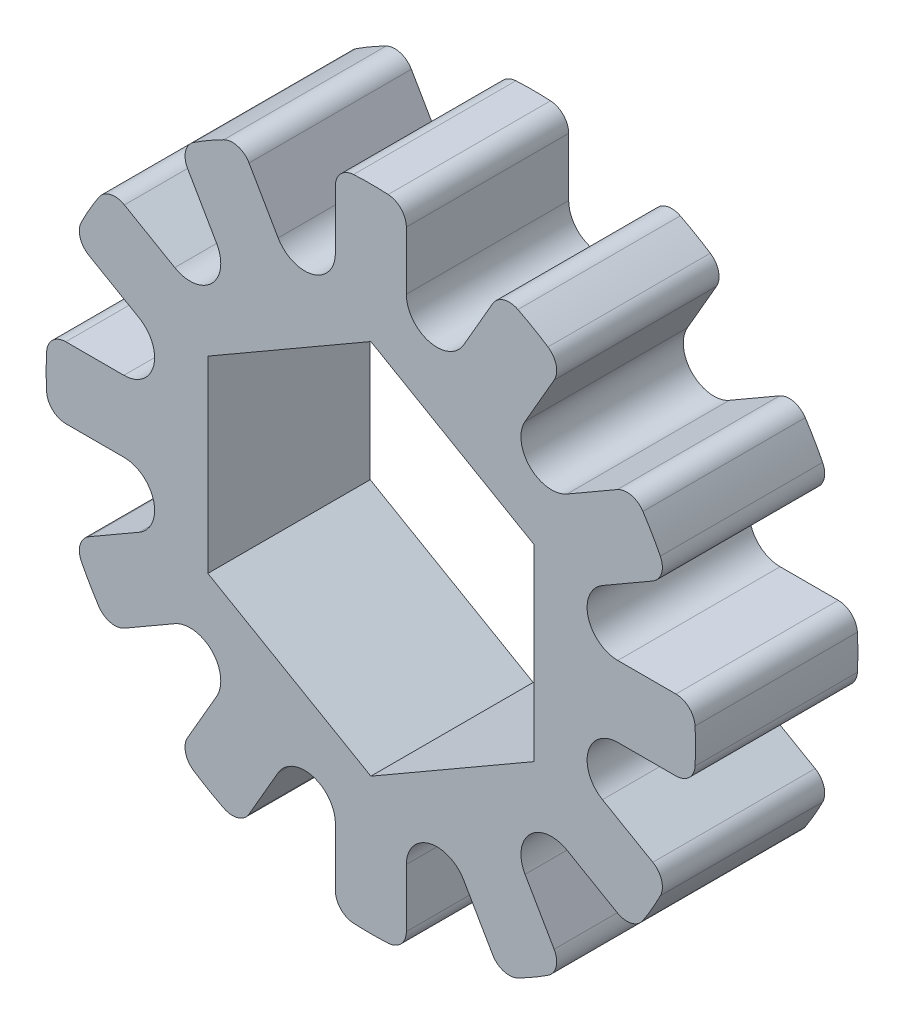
ISO-10303-21;
HEADER;
FILE_DESCRIPTION(('STEP AP214'),'2;1');
FILE_NAME('part.step','',(''),(''),'','','');
FILE_SCHEMA(('AUTOMOTIVE_DESIGN { 1 0 10303 214 1 1 1 1 }'));
ENDSEC;
DATA;
#1=APPLICATION_CONTEXT('core data for automotive mechanical design processes');
#2=APPLICATION_PROTOCOL_DEFINITION('international standard','automotive_design',2000,#1);
#3=PRODUCT_CONTEXT('',#1,'mechanical');
#4=PRODUCT('Part','Part','',(#3));
#5=PRODUCT_RELATED_PRODUCT_CATEGORY('part','',(#4));
#6=PRODUCT_DEFINITION_FORMATION('','',#4);
#7=PRODUCT_DEFINITION_CONTEXT('part definition',#1,'design');
#8=PRODUCT_DEFINITION('design','',#6,#7);
#9=PRODUCT_DEFINITION_SHAPE('','',#8);
#10=(LENGTH_UNIT() NAMED_UNIT(*) SI_UNIT(.MILLI.,.METRE.));
#11=(NAMED_UNIT(*) PLANE_ANGLE_UNIT() SI_UNIT($,.RADIAN.));
#12=(NAMED_UNIT(*) SI_UNIT($,.STERADIAN.) SOLID_ANGLE_UNIT());
#13=UNCERTAINTY_MEASURE_WITH_UNIT(LENGTH_MEASURE(1.E-05),#10,'distance_accuracy_value','');
#14=(GEOMETRIC_REPRESENTATION_CONTEXT(3) GLOBAL_UNCERTAINTY_ASSIGNED_CONTEXT((#13)) GLOBAL_UNIT_ASSIGNED_CONTEXT((#10,
#11,#12)) REPRESENTATION_CONTEXT('',''));
#15=CARTESIAN_POINT('',(0.,0.,0.));
#16=DIRECTION('',(0.,0.,1.));
#17=DIRECTION('',(1.,0.,0.));
#18=AXIS2_PLACEMENT_3D('',#15,#16,#17);
#19=CARTESIAN_POINT('',(0.638190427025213,11.9329465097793,3.175));
#20=DIRECTION('',(0.,0.,-1.));
#21=DIRECTION('',(-1.,0.,0.));
#22=AXIS2_PLACEMENT_3D('',#19,#20,#21);
#23=CYLINDRICAL_SURFACE('',#22,0.750000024);
#24=CARTESIAN_POINT('',(0.638190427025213,11.9329465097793,-3.175));
#25=DIRECTION('',(0.,0.,-1.));
#26=DIRECTION('',(1.,0.,0.));
#27=AXIS2_PLACEMENT_3D('',#24,#25,#26);
#28=CIRCLE('',#27,0.750000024);
#29=CARTESIAN_POINT('',(0.6782442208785,12.6818762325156,-3.175));
#30=VERTEX_POINT('',#29);
#31=CARTESIAN_POINT('',(1.38819045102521,11.9329465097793,-3.175));
#32=VERTEX_POINT('',#31);
#33=EDGE_CURVE('E1273',#30,#32,#28,.T.);
#34=ORIENTED_EDGE('',*,*,#33,.F.);
#35=DIRECTION('',(0.,0.,-1.));
#36=VECTOR('',#35,1.);
#37=CARTESIAN_POINT('',(0.6782442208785,12.6818762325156,3.175));
#38=LINE('',#37,#36);
#39=CARTESIAN_POINT('',(0.6782442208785,12.6818762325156,3.175));
#40=VERTEX_POINT('',#39);
#41=EDGE_CURVE('E1196',#40,#30,#38,.T.);
#42=ORIENTED_EDGE('',*,*,#41,.F.);
#43=CARTESIAN_POINT('',(0.638190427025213,11.9329465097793,3.175));
#44=DIRECTION('',(0.,0.,1.));
#45=DIRECTION('',(1.,0.,0.));
#46=AXIS2_PLACEMENT_3D('',#43,#44,#45);
#47=CIRCLE('',#46,0.750000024);
#48=CARTESIAN_POINT('',(1.38819045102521,11.9329465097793,3.175));
#49=VERTEX_POINT('',#48);
#50=EDGE_CURVE('E876',#49,#40,#47,.T.);
#51=ORIENTED_EDGE('',*,*,#50,.F.);
#52=DIRECTION('',(0.,0.,1.));
#53=VECTOR('',#52,1.);
#54=CARTESIAN_POINT('',(1.38819045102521,11.9329465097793,-3.175));
#55=LINE('',#54,#53);
#56=EDGE_CURVE('E902',#32,#49,#55,.T.);
#57=ORIENTED_EDGE('',*,*,#56,.F.);
#58=EDGE_LOOP('',(#34,#42,#51,#57));
#59=FACE_BOUND('',#58,.T.);
#60=ADVANCED_FACE('F16',(#59),#23,.T.);
#61=CARTESIAN_POINT('',(-6.51916237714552,10.0151396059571,3.175));
#62=DIRECTION('',(0.,0.,-1.));
#63=DIRECTION('',(-1.,0.,0.));
#64=AXIS2_PLACEMENT_3D('',#61,#62,#63);
#65=CYLINDRICAL_SURFACE('',#64,0.750000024);
#66=DIRECTION('',(0.,0.,-1.));
#67=VECTOR('',#66,1.);
#68=CARTESIAN_POINT('',(-7.26916240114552,10.0151396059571,3.175));
#69=LINE('',#68,#67);
#70=CARTESIAN_POINT('',(-7.26916240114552,10.0151396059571,3.175));
#71=VERTEX_POINT('',#70);
#72=CARTESIAN_POINT('',(-7.26916240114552,10.0151396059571,-3.175));
#73=VERTEX_POINT('',#72);
#74=EDGE_CURVE('E1124',#71,#73,#69,.T.);
#75=ORIENTED_EDGE('',*,*,#74,.F.);
#76=CARTESIAN_POINT('',(-6.51916237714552,10.0151396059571,3.175));
#77=DIRECTION('',(0.,0.,1.));
#78=DIRECTION('',(1.,0.,0.));
#79=AXIS2_PLACEMENT_3D('',#76,#77,#78);
#80=CIRCLE('',#79,0.750000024);
#81=CARTESIAN_POINT('',(-6.92831484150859,10.6437048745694,3.175));
#82=VERTEX_POINT('',#81);
#83=EDGE_CURVE('E999',#82,#71,#80,.T.);
#84=ORIENTED_EDGE('',*,*,#83,.F.);
#85=DIRECTION('',(0.,0.,1.));
#86=VECTOR('',#85,1.);
#87=CARTESIAN_POINT('',(-6.92831484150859,10.6437048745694,3.175));
#88=LINE('',#87,#86);
#89=CARTESIAN_POINT('',(-6.92831484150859,10.6437048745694,-3.175));
#90=VERTEX_POINT('',#89);
#91=EDGE_CURVE('E1104',#90,#82,#88,.T.);
#92=ORIENTED_EDGE('',*,*,#91,.F.);
#93=CARTESIAN_POINT('',(-6.51916237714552,10.0151396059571,-3.175));
#94=DIRECTION('',(0.,0.,-1.));
#95=DIRECTION('',(1.,0.,0.));
#96=AXIS2_PLACEMENT_3D('',#93,#94,#95);
#97=CIRCLE('',#96,0.750000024);
#98=EDGE_CURVE('E1296',#73,#90,#97,.T.);
#99=ORIENTED_EDGE('',*,*,#98,.F.);
#100=EDGE_LOOP('',(#75,#84,#92,#99));
#101=FACE_BOUND('',#100,.T.);
#102=ADVANCED_FACE('F1938',(#101),#65,.T.);
#103=CARTESIAN_POINT('',(-5.41378413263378,10.6533300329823,3.175));
#104=DIRECTION('',(0.,0.,-1.));
#105=DIRECTION('',(-1.,0.,0.));
#106=AXIS2_PLACEMENT_3D('',#103,#104,#105);
#107=CYLINDRICAL_SURFACE('',#106,0.750000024);
#108=CARTESIAN_POINT('',(-5.41378413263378,10.6533300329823,-3.175));
#109=DIRECTION('',(0.,0.,-1.));
#110=DIRECTION('',(1.,0.,0.));
#111=AXIS2_PLACEMENT_3D('',#108,#109,#110);
#112=CIRCLE('',#111,0.750000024);
#113=CARTESIAN_POINT('',(-5.75356139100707,11.3219490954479,-3.175));
#114=VERTEX_POINT('',#113);
#115=CARTESIAN_POINT('',(-4.76426505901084,11.0283300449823,-3.175));
#116=VERTEX_POINT('',#115);
#117=EDGE_CURVE('E1346',#114,#116,#112,.T.);
#118=ORIENTED_EDGE('',*,*,#117,.F.);
#119=DIRECTION('',(0.,0.,-1.));
#120=VECTOR('',#119,1.);
#121=CARTESIAN_POINT('',(-5.75356139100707,11.3219490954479,3.175));
#122=LINE('',#121,#120);
#123=CARTESIAN_POINT('',(-5.75356139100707,11.3219490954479,3.175));
#124=VERTEX_POINT('',#123);
#125=EDGE_CURVE('E1105',#124,#114,#122,.T.);
#126=ORIENTED_EDGE('',*,*,#125,.F.);
#127=CARTESIAN_POINT('',(-5.41378413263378,10.6533300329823,3.175));
#128=DIRECTION('',(0.,0.,1.));
#129=DIRECTION('',(1.,0.,0.));
#130=AXIS2_PLACEMENT_3D('',#127,#128,#129);
#131=CIRCLE('',#130,0.750000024);
#132=CARTESIAN_POINT('',(-4.76426505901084,11.0283300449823,3.175));
#133=VERTEX_POINT('',#132);
#134=EDGE_CURVE('E1032',#133,#124,#131,.T.);
#135=ORIENTED_EDGE('',*,*,#134,.F.);
#136=DIRECTION('',(0.,0.,1.));
#137=VECTOR('',#136,1.);
#138=CARTESIAN_POINT('',(-4.76426505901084,11.0283300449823,-3.175));
#139=LINE('',#138,#137);
#140=EDGE_CURVE('E1131',#116,#133,#139,.T.);
#141=ORIENTED_EDGE('',*,*,#140,.F.);
#142=EDGE_LOOP('',(#118,#126,#135,#141));
#143=FACE_BOUND('',#142,.T.);
#144=ADVANCED_FACE('F1947',(#143),#107,.T.);
#145=CARTESIAN_POINT('',(-0.638190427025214,11.9329465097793,3.175));
#146=DIRECTION('',(0.,0.,-1.));
#147=DIRECTION('',(-1.,0.,0.));
#148=AXIS2_PLACEMENT_3D('',#145,#146,#147);
#149=CYLINDRICAL_SURFACE('',#148,0.750000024);
#150=CARTESIAN_POINT('',(-0.638190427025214,11.9329465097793,-3.175));
#151=DIRECTION('',(0.,0.,-1.));
#152=DIRECTION('',(1.,0.,0.));
#153=AXIS2_PLACEMENT_3D('',#150,#151,#152);
#154=CIRCLE('',#153,0.750000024);
#155=CARTESIAN_POINT('',(-1.38819045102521,11.9329465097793,-3.175));
#156=VERTEX_POINT('',#155);
#157=CARTESIAN_POINT('',(-0.6782442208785,12.6818762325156,-3.175));
#158=VERTEX_POINT('',#157);
#159=EDGE_CURVE('E1277',#156,#158,#154,.T.);
#160=ORIENTED_EDGE('',*,*,#159,.F.);
#161=DIRECTION('',(0.,0.,-1.));
#162=VECTOR('',#161,1.);
#163=CARTESIAN_POINT('',(-1.38819045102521,11.9329465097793,-3.175));
#164=LINE('',#163,#162);
#165=CARTESIAN_POINT('',(-1.38819045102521,11.9329465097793,3.175));
#166=VERTEX_POINT('',#165);
#167=EDGE_CURVE('E898',#166,#156,#164,.T.);
#168=ORIENTED_EDGE('',*,*,#167,.F.);
#169=CARTESIAN_POINT('',(-0.638190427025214,11.9329465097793,3.175));
#170=DIRECTION('',(0.,0.,1.));
#171=DIRECTION('',(1.,0.,0.));
#172=AXIS2_PLACEMENT_3D('',#169,#170,#171);
#173=CIRCLE('',#172,0.750000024);
#174=CARTESIAN_POINT('',(-0.6782442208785,12.6818762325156,3.175));
#175=VERTEX_POINT('',#174);
#176=EDGE_CURVE('E879',#175,#166,#173,.T.);
#177=ORIENTED_EDGE('',*,*,#176,.F.);
#178=DIRECTION('',(0.,0.,1.));
#179=VECTOR('',#178,1.);
#180=CARTESIAN_POINT('',(-0.6782442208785,12.6818762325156,3.175));
#181=LINE('',#180,#179);
#182=EDGE_CURVE('E1084',#158,#175,#181,.T.);
#183=ORIENTED_EDGE('',*,*,#182,.F.);
#184=EDGE_LOOP('',(#160,#168,#177,#183));
#185=FACE_BOUND('',#184,.T.);
#186=ADVANCED_FACE('F1964',(#185),#149,.T.);
#187=CARTESIAN_POINT('',(5.41378413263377,10.6533300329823,3.175));
#188=DIRECTION('',(0.,0.,-1.));
#189=DIRECTION('',(-1.,0.,0.));
#190=AXIS2_PLACEMENT_3D('',#187,#188,#189);
#191=CYLINDRICAL_SURFACE('',#190,0.750000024);
#192=CARTESIAN_POINT('',(5.41378413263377,10.6533300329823,-3.175));
#193=DIRECTION('',(0.,0.,-1.));
#194=DIRECTION('',(1.,0.,0.));
#195=AXIS2_PLACEMENT_3D('',#192,#193,#194);
#196=CIRCLE('',#195,0.750000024);
#197=CARTESIAN_POINT('',(4.76426505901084,11.0283300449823,-3.175));
#198=VERTEX_POINT('',#197);
#199=CARTESIAN_POINT('',(5.75356139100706,11.3219490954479,-3.175));
#200=VERTEX_POINT('',#199);
#201=EDGE_CURVE('E1037',#198,#200,#196,.T.);
#202=ORIENTED_EDGE('',*,*,#201,.F.);
#203=DIRECTION('',(0.,0.,-1.));
#204=VECTOR('',#203,1.);
#205=CARTESIAN_POINT('',(4.76426505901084,11.0283300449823,-3.175));
#206=LINE('',#205,#204);
#207=CARTESIAN_POINT('',(4.76426505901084,11.0283300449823,3.175));
#208=VERTEX_POINT('',#207);
#209=EDGE_CURVE('E817',#208,#198,#206,.T.);
#210=ORIENTED_EDGE('',*,*,#209,.F.);
#211=CARTESIAN_POINT('',(5.41378413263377,10.6533300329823,3.175));
#212=DIRECTION('',(0.,0.,1.));
#213=DIRECTION('',(1.,0.,0.));
#214=AXIS2_PLACEMENT_3D('',#211,#212,#213);
#215=CIRCLE('',#214,0.750000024);
#216=CARTESIAN_POINT('',(5.75356139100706,11.3219490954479,3.175));
#217=VERTEX_POINT('',#216);
#218=EDGE_CURVE('E903',#217,#208,#215,.T.);
#219=ORIENTED_EDGE('',*,*,#218,.F.);
#220=DIRECTION('',(0.,0.,1.));
#221=VECTOR('',#220,1.);
#222=CARTESIAN_POINT('',(5.75356139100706,11.3219490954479,3.175));
#223=LINE('',#222,#221);
#224=EDGE_CURVE('E754',#200,#217,#223,.T.);
#225=ORIENTED_EDGE('',*,*,#224,.F.);
#226=EDGE_LOOP('',(#202,#210,#219,#225));
#227=FACE_BOUND('',#226,.T.);
#228=ADVANCED_FACE('F1988',(#227),#191,.T.);
#229=CARTESIAN_POINT('',(6.51916237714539,10.0151396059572,3.175));
#230=DIRECTION('',(0.,0.,-1.));
#231=DIRECTION('',(-1.,0.,0.));
#232=AXIS2_PLACEMENT_3D('',#229,#230,#231);
#233=CYLINDRICAL_SURFACE('',#232,0.750000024);
#234=CARTESIAN_POINT('',(6.51916237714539,10.0151396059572,-3.175));
#235=DIRECTION('',(0.,0.,-1.));
#236=DIRECTION('',(1.,0.,0.));
#237=AXIS2_PLACEMENT_3D('',#234,#235,#236);
#238=CIRCLE('',#237,0.750000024);
#239=CARTESIAN_POINT('',(6.92831484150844,10.6437048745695,-3.175));
#240=VERTEX_POINT('',#239);
#241=CARTESIAN_POINT('',(7.16868145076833,9.64013959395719,-3.175));
#242=VERTEX_POINT('',#241);
#243=EDGE_CURVE('E1071',#240,#242,#238,.T.);
#244=ORIENTED_EDGE('',*,*,#243,.F.);
#245=DIRECTION('',(0.,0.,-1.));
#246=VECTOR('',#245,1.);
#247=CARTESIAN_POINT('',(6.92831484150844,10.6437048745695,3.175));
#248=LINE('',#247,#246);
#249=CARTESIAN_POINT('',(6.92831484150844,10.6437048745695,3.175));
#250=VERTEX_POINT('',#249);
#251=EDGE_CURVE('E758',#250,#240,#248,.T.);
#252=ORIENTED_EDGE('',*,*,#251,.F.);
#253=CARTESIAN_POINT('',(6.51916237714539,10.0151396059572,3.175));
#254=DIRECTION('',(0.,0.,1.));
#255=DIRECTION('',(1.,0.,0.));
#256=AXIS2_PLACEMENT_3D('',#253,#254,#255);
#257=CIRCLE('',#256,0.750000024);
#258=CARTESIAN_POINT('',(7.16868145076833,9.64013959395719,3.175));
#259=VERTEX_POINT('',#258);
#260=EDGE_CURVE('E1047',#259,#250,#257,.T.);
#261=ORIENTED_EDGE('',*,*,#260,.F.);
#262=DIRECTION('',(0.,0.,1.));
#263=VECTOR('',#262,1.);
#264=CARTESIAN_POINT('',(7.16868145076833,9.64013959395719,-3.175));
#265=LINE('',#264,#263);
#266=EDGE_CURVE('E942',#242,#259,#265,.T.);
#267=ORIENTED_EDGE('',*,*,#266,.F.);
#268=EDGE_LOOP('',(#244,#252,#261,#267));
#269=FACE_BOUND('',#268,.T.);
#270=ADVANCED_FACE('F2596',(#269),#233,.T.);
#271=CARTESIAN_POINT('',(10.015139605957,6.51916237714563,3.175));
#272=DIRECTION('',(0.,0.,-1.));
#273=DIRECTION('',(-1.,0.,0.));
#274=AXIS2_PLACEMENT_3D('',#271,#272,#273);
#275=CYLINDRICAL_SURFACE('',#274,0.750000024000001);
#276=CARTESIAN_POINT('',(10.015139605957,6.51916237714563,-3.175));
#277=DIRECTION('',(0.,0.,-1.));
#278=DIRECTION('',(1.,0.,0.));
#279=AXIS2_PLACEMENT_3D('',#276,#277,#278);
#280=CIRCLE('',#279,0.750000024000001);
#281=CARTESIAN_POINT('',(9.64013959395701,7.16868145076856,-3.175));
#282=VERTEX_POINT('',#281);
#283=CARTESIAN_POINT('',(10.6437048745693,6.92831484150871,-3.175));
#284=VERTEX_POINT('',#283);
#285=EDGE_CURVE('E1066',#282,#284,#280,.T.);
#286=ORIENTED_EDGE('',*,*,#285,.F.);
#287=DIRECTION('',(0.,0.,-1.));
#288=VECTOR('',#287,1.);
#289=CARTESIAN_POINT('',(9.64013959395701,7.16868145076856,-3.175));
#290=LINE('',#289,#288);
#291=CARTESIAN_POINT('',(9.64013959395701,7.16868145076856,3.175));
#292=VERTEX_POINT('',#291);
#293=EDGE_CURVE('E1349',#292,#282,#290,.T.);
#294=ORIENTED_EDGE('',*,*,#293,.F.);
#295=CARTESIAN_POINT('',(10.015139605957,6.51916237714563,3.175));
#296=DIRECTION('',(0.,0.,1.));
#297=DIRECTION('',(1.,0.,0.));
#298=AXIS2_PLACEMENT_3D('',#295,#296,#297);
#299=CIRCLE('',#298,0.750000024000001);
#300=CARTESIAN_POINT('',(10.6437048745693,6.92831484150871,3.175));
#301=VERTEX_POINT('',#300);
#302=EDGE_CURVE('E776',#301,#292,#299,.T.);
#303=ORIENTED_EDGE('',*,*,#302,.F.);
#304=DIRECTION('',(0.,0.,1.));
#305=VECTOR('',#304,1.);
#306=CARTESIAN_POINT('',(10.6437048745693,6.92831484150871,3.175));
#307=LINE('',#306,#305);
#308=EDGE_CURVE('E1082',#284,#301,#307,.T.);
#309=ORIENTED_EDGE('',*,*,#308,.F.);
#310=EDGE_LOOP('',(#286,#294,#303,#309));
#311=FACE_BOUND('',#310,.T.);
#312=ADVANCED_FACE('F1711',(#311),#275,.T.);
#313=CARTESIAN_POINT('',(10.6533300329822,5.41378413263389,3.175));
#314=DIRECTION('',(0.,0.,-1.));
#315=DIRECTION('',(-1.,0.,0.));
#316=AXIS2_PLACEMENT_3D('',#313,#314,#315);
#317=CYLINDRICAL_SURFACE('',#316,0.750000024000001);
#318=CARTESIAN_POINT('',(10.6533300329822,5.41378413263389,-3.175));
#319=DIRECTION('',(0.,0.,-1.));
#320=DIRECTION('',(1.,0.,0.));
#321=AXIS2_PLACEMENT_3D('',#318,#319,#320);
#322=CIRCLE('',#321,0.750000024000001);
#323=CARTESIAN_POINT('',(11.3219490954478,5.75356139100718,-3.175));
#324=VERTEX_POINT('',#323);
#325=CARTESIAN_POINT('',(11.0283300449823,4.76426505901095,-3.175));
#326=VERTEX_POINT('',#325);
#327=EDGE_CURVE('E1062',#324,#326,#322,.T.);
#328=ORIENTED_EDGE('',*,*,#327,.F.);
#329=DIRECTION('',(0.,0.,-1.));
#330=VECTOR('',#329,1.);
#331=CARTESIAN_POINT('',(11.3219490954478,5.75356139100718,3.175));
#332=LINE('',#331,#330);
#333=CARTESIAN_POINT('',(11.3219490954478,5.75356139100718,3.175));
#334=VERTEX_POINT('',#333);
#335=EDGE_CURVE('E1083',#334,#324,#332,.T.);
#336=ORIENTED_EDGE('',*,*,#335,.F.);
#337=CARTESIAN_POINT('',(10.6533300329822,5.41378413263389,3.175));
#338=DIRECTION('',(0.,0.,1.));
#339=DIRECTION('',(1.,0.,0.));
#340=AXIS2_PLACEMENT_3D('',#337,#338,#339);
#341=CIRCLE('',#340,0.750000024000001);
#342=CARTESIAN_POINT('',(11.0283300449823,4.76426505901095,3.175));
#343=VERTEX_POINT('',#342);
#344=EDGE_CURVE('E767',#343,#334,#341,.T.);
#345=ORIENTED_EDGE('',*,*,#344,.F.);
#346=DIRECTION('',(0.,0.,1.));
#347=VECTOR('',#346,1.);
#348=CARTESIAN_POINT('',(11.0283300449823,4.76426505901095,-3.175));
#349=LINE('',#348,#347);
#350=EDGE_CURVE('E1243',#326,#343,#349,.T.);
#351=ORIENTED_EDGE('',*,*,#350,.F.);
#352=EDGE_LOOP('',(#328,#336,#345,#351));
#353=FACE_BOUND('',#352,.T.);
#354=ADVANCED_FACE('F1718',(#353),#317,.T.);
#355=CARTESIAN_POINT('',(11.9329465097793,0.63819042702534,3.175));
#356=DIRECTION('',(0.,0.,-1.));
#357=DIRECTION('',(-1.,0.,0.));
#358=AXIS2_PLACEMENT_3D('',#355,#356,#357);
#359=CYLINDRICAL_SURFACE('',#358,0.750000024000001);
#360=CARTESIAN_POINT('',(11.9329465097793,0.63819042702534,-3.175));
#361=DIRECTION('',(0.,0.,-1.));
#362=DIRECTION('',(1.,0.,0.));
#363=AXIS2_PLACEMENT_3D('',#360,#361,#362);
#364=CIRCLE('',#363,0.750000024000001);
#365=CARTESIAN_POINT('',(11.9329465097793,1.38819045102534,-3.175));
#366=VERTEX_POINT('',#365);
#367=CARTESIAN_POINT('',(12.6818762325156,0.678244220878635,-3.175));
#368=VERTEX_POINT('',#367);
#369=EDGE_CURVE('E938',#366,#368,#364,.T.);
#370=ORIENTED_EDGE('',*,*,#369,.F.);
#371=DIRECTION('',(0.,0.,-1.));
#372=VECTOR('',#371,1.);
#373=CARTESIAN_POINT('',(11.9329465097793,1.38819045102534,-3.175));
#374=LINE('',#373,#372);
#375=CARTESIAN_POINT('',(11.9329465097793,1.38819045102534,3.175));
#376=VERTEX_POINT('',#375);
#377=EDGE_CURVE('E1467',#376,#366,#374,.T.);
#378=ORIENTED_EDGE('',*,*,#377,.F.);
#379=CARTESIAN_POINT('',(11.9329465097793,0.63819042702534,3.175));
#380=DIRECTION('',(0.,0.,1.));
#381=DIRECTION('',(1.,0.,0.));
#382=AXIS2_PLACEMENT_3D('',#379,#380,#381);
#383=CIRCLE('',#382,0.750000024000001);
#384=CARTESIAN_POINT('',(12.6818762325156,0.678244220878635,3.175));
#385=VERTEX_POINT('',#384);
#386=EDGE_CURVE('E787',#385,#376,#383,.T.);
#387=ORIENTED_EDGE('',*,*,#386,.F.);
#388=DIRECTION('',(0.,0.,1.));
#389=VECTOR('',#388,1.);
#390=CARTESIAN_POINT('',(12.6818762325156,0.678244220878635,3.175));
#391=LINE('',#390,#389);
#392=EDGE_CURVE('E1292',#368,#385,#391,.T.);
#393=ORIENTED_EDGE('',*,*,#392,.F.);
#394=EDGE_LOOP('',(#370,#378,#387,#393));
#395=FACE_BOUND('',#394,.T.);
#396=ADVANCED_FACE('F1730',(#395),#359,.T.);
#397=CARTESIAN_POINT('',(11.9329465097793,-0.638190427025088,3.175));
#398=DIRECTION('',(0.,0.,-1.));
#399=DIRECTION('',(-1.,0.,0.));
#400=AXIS2_PLACEMENT_3D('',#397,#398,#399);
#401=CYLINDRICAL_SURFACE('',#400,0.750000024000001);
#402=CARTESIAN_POINT('',(11.9329465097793,-0.638190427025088,-3.175));
#403=DIRECTION('',(0.,0.,-1.));
#404=DIRECTION('',(1.,0.,0.));
#405=AXIS2_PLACEMENT_3D('',#402,#403,#404);
#406=CIRCLE('',#405,0.750000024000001);
#407=CARTESIAN_POINT('',(12.6818762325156,-0.678244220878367,-3.175));
#408=VERTEX_POINT('',#407);
#409=CARTESIAN_POINT('',(11.9329465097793,-1.38819045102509,-3.175));
#410=VERTEX_POINT('',#409);
#411=EDGE_CURVE('E933',#408,#410,#406,.T.);
#412=ORIENTED_EDGE('',*,*,#411,.F.);
#413=DIRECTION('',(0.,0.,-1.));
#414=VECTOR('',#413,1.);
#415=CARTESIAN_POINT('',(12.6818762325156,-0.678244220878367,3.175));
#416=LINE('',#415,#414);
#417=CARTESIAN_POINT('',(12.6818762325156,-0.678244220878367,3.175));
#418=VERTEX_POINT('',#417);
#419=EDGE_CURVE('E1051',#418,#408,#416,.T.);
#420=ORIENTED_EDGE('',*,*,#419,.F.);
#421=CARTESIAN_POINT('',(11.9329465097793,-0.638190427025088,3.175));
#422=DIRECTION('',(0.,0.,1.));
#423=DIRECTION('',(1.,0.,0.));
#424=AXIS2_PLACEMENT_3D('',#421,#422,#423);
#425=CIRCLE('',#424,0.750000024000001);
#426=CARTESIAN_POINT('',(11.9329465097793,-1.38819045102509,3.175));
#427=VERTEX_POINT('',#426);
#428=EDGE_CURVE('E972',#427,#418,#425,.T.);
#429=ORIENTED_EDGE('',*,*,#428,.F.);
#430=DIRECTION('',(0.,0.,1.));
#431=VECTOR('',#430,1.);
#432=CARTESIAN_POINT('',(11.9329465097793,-1.38819045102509,-3.175));
#433=LINE('',#432,#431);
#434=EDGE_CURVE('E960',#410,#427,#433,.T.);
#435=ORIENTED_EDGE('',*,*,#434,.F.);
#436=EDGE_LOOP('',(#412,#420,#429,#435));
#437=FACE_BOUND('',#436,.T.);
#438=ADVANCED_FACE('F1737',(#437),#401,.T.);
#439=CARTESIAN_POINT('',(10.6533300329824,-5.41378413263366,3.175));
#440=DIRECTION('',(0.,0.,-1.));
#441=DIRECTION('',(-1.,0.,0.));
#442=AXIS2_PLACEMENT_3D('',#439,#440,#441);
#443=CYLINDRICAL_SURFACE('',#442,0.750000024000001);
#444=CARTESIAN_POINT('',(10.6533300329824,-5.41378413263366,-3.175));
#445=DIRECTION('',(0.,0.,-1.));
#446=DIRECTION('',(1.,0.,0.));
#447=AXIS2_PLACEMENT_3D('',#444,#445,#446);
#448=CIRCLE('',#447,0.750000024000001);
#449=CARTESIAN_POINT('',(11.0283300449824,-4.76426505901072,-3.175));
#450=VERTEX_POINT('',#449);
#451=CARTESIAN_POINT('',(11.3219490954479,-5.75356139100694,-3.175));
#452=VERTEX_POINT('',#451);
#453=EDGE_CURVE('E1004',#450,#452,#448,.T.);
#454=ORIENTED_EDGE('',*,*,#453,.F.);
#455=DIRECTION('',(0.,0.,-1.));
#456=VECTOR('',#455,1.);
#457=CARTESIAN_POINT('',(11.0283300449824,-4.76426505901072,-3.175));
#458=LINE('',#457,#456);
#459=CARTESIAN_POINT('',(11.0283300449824,-4.76426505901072,3.175));
#460=VERTEX_POINT('',#459);
#461=EDGE_CURVE('E1240',#460,#450,#458,.T.);
#462=ORIENTED_EDGE('',*,*,#461,.F.);
#463=CARTESIAN_POINT('',(10.6533300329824,-5.41378413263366,3.175));
#464=DIRECTION('',(0.,0.,1.));
#465=DIRECTION('',(1.,0.,0.));
#466=AXIS2_PLACEMENT_3D('',#463,#464,#465);
#467=CIRCLE('',#466,0.750000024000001);
#468=CARTESIAN_POINT('',(11.3219490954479,-5.75356139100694,3.175));
#469=VERTEX_POINT('',#468);
#470=EDGE_CURVE('E870',#469,#460,#467,.T.);
#471=ORIENTED_EDGE('',*,*,#470,.F.);
#472=DIRECTION('',(0.,0.,1.));
#473=VECTOR('',#472,1.);
#474=CARTESIAN_POINT('',(11.3219490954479,-5.75356139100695,3.175));
#475=LINE('',#474,#473);
#476=EDGE_CURVE('E1318',#452,#469,#475,.T.);
#477=ORIENTED_EDGE('',*,*,#476,.F.);
#478=EDGE_LOOP('',(#454,#462,#471,#477));
#479=FACE_BOUND('',#478,.T.);
#480=ADVANCED_FACE('F1754',(#479),#443,.T.);
#481=CARTESIAN_POINT('',(10.0151396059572,-6.51916237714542,3.175));
#482=DIRECTION('',(0.,0.,-1.));
#483=DIRECTION('',(-1.,0.,0.));
#484=AXIS2_PLACEMENT_3D('',#481,#482,#483);
#485=CYLINDRICAL_SURFACE('',#484,0.750000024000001);
#486=CARTESIAN_POINT('',(10.0151396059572,-6.51916237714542,-3.175));
#487=DIRECTION('',(0.,0.,-1.));
#488=DIRECTION('',(1.,0.,0.));
#489=AXIS2_PLACEMENT_3D('',#486,#487,#488);
#490=CIRCLE('',#489,0.750000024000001);
#491=CARTESIAN_POINT('',(10.6437048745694,-6.92831484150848,-3.175));
#492=VERTEX_POINT('',#491);
#493=CARTESIAN_POINT('',(9.64013959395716,-7.16868145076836,-3.175));
#494=VERTEX_POINT('',#493);
#495=EDGE_CURVE('E1000',#492,#494,#490,.T.);
#496=ORIENTED_EDGE('',*,*,#495,.F.);
#497=DIRECTION('',(0.,0.,-1.));
#498=VECTOR('',#497,1.);
#499=CARTESIAN_POINT('',(10.6437048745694,-6.92831484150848,3.175));
#500=LINE('',#499,#498);
#501=CARTESIAN_POINT('',(10.6437048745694,-6.92831484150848,3.175));
#502=VERTEX_POINT('',#501);
#503=EDGE_CURVE('E988',#502,#492,#500,.T.);
#504=ORIENTED_EDGE('',*,*,#503,.F.);
#505=CARTESIAN_POINT('',(10.0151396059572,-6.51916237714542,3.175));
#506=DIRECTION('',(0.,0.,1.));
#507=DIRECTION('',(1.,0.,0.));
#508=AXIS2_PLACEMENT_3D('',#505,#506,#507);
#509=CIRCLE('',#508,0.750000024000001);
#510=CARTESIAN_POINT('',(9.64013959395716,-7.16868145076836,3.175));
#511=VERTEX_POINT('',#510);
#512=EDGE_CURVE('E875',#511,#502,#509,.T.);
#513=ORIENTED_EDGE('',*,*,#512,.F.);
#514=DIRECTION('',(0.,0.,1.));
#515=VECTOR('',#514,1.);
#516=CARTESIAN_POINT('',(9.64013959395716,-7.16868145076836,-3.175));
#517=LINE('',#516,#515);
#518=EDGE_CURVE('E1188',#494,#511,#517,.T.);
#519=ORIENTED_EDGE('',*,*,#518,.F.);
#520=EDGE_LOOP('',(#496,#504,#513,#519));
#521=FACE_BOUND('',#520,.T.);
#522=ADVANCED_FACE('F18',(#521),#485,.T.);
#523=CARTESIAN_POINT('',(6.51916237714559,-10.015139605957,3.175));
#524=DIRECTION('',(0.,0.,-1.));
#525=DIRECTION('',(-1.,0.,0.));
#526=AXIS2_PLACEMENT_3D('',#523,#524,#525);
#527=CYLINDRICAL_SURFACE('',#526,0.750000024);
#528=CARTESIAN_POINT('',(6.51916237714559,-10.015139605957,-3.175));
#529=DIRECTION('',(0.,0.,-1.));
#530=DIRECTION('',(1.,0.,0.));
#531=AXIS2_PLACEMENT_3D('',#528,#529,#530);
#532=CIRCLE('',#531,0.750000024);
#533=CARTESIAN_POINT('',(7.16868145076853,-9.64013959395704,-3.175));
#534=VERTEX_POINT('',#533);
#535=CARTESIAN_POINT('',(6.92831484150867,-10.6437048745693,-3.175));
#536=VERTEX_POINT('',#535);
#537=EDGE_CURVE('E1110',#534,#536,#532,.T.);
#538=ORIENTED_EDGE('',*,*,#537,.F.);
#539=DIRECTION('',(0.,0.,-1.));
#540=VECTOR('',#539,1.);
#541=CARTESIAN_POINT('',(7.16868145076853,-9.64013959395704,-3.175));
#542=LINE('',#541,#540);
#543=CARTESIAN_POINT('',(7.16868145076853,-9.64013959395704,3.175));
#544=VERTEX_POINT('',#543);
#545=EDGE_CURVE('E1502',#544,#534,#542,.T.);
#546=ORIENTED_EDGE('',*,*,#545,.F.);
#547=CARTESIAN_POINT('',(6.51916237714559,-10.015139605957,3.175));
#548=DIRECTION('',(0.,0.,1.));
#549=DIRECTION('',(1.,0.,0.));
#550=AXIS2_PLACEMENT_3D('',#547,#548,#549);
#551=CIRCLE('',#550,0.750000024);
#552=CARTESIAN_POINT('',(6.92831484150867,-10.6437048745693,3.175));
#553=VERTEX_POINT('',#552);
#554=EDGE_CURVE('E812',#553,#544,#551,.T.);
#555=ORIENTED_EDGE('',*,*,#554,.F.);
#556=DIRECTION('',(0.,0.,1.));
#557=VECTOR('',#556,1.);
#558=CARTESIAN_POINT('',(6.92831484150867,-10.6437048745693,3.175));
#559=LINE('',#558,#557);
#560=EDGE_CURVE('E840',#536,#553,#559,.T.);
#561=ORIENTED_EDGE('',*,*,#560,.F.);
#562=EDGE_LOOP('',(#538,#546,#555,#561));
#563=FACE_BOUND('',#562,.T.);
#564=ADVANCED_FACE('F1778',(#563),#527,.T.);
#565=CARTESIAN_POINT('',(5.41378413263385,-10.6533300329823,3.175));
#566=DIRECTION('',(0.,0.,-1.));
#567=DIRECTION('',(-1.,0.,0.));
#568=AXIS2_PLACEMENT_3D('',#565,#566,#567);
#569=CYLINDRICAL_SURFACE('',#568,0.750000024);
#570=CARTESIAN_POINT('',(5.41378413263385,-10.6533300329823,-3.175));
#571=DIRECTION('',(0.,0.,-1.));
#572=DIRECTION('',(1.,0.,0.));
#573=AXIS2_PLACEMENT_3D('',#570,#571,#572);
#574=CIRCLE('',#573,0.750000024);
#575=CARTESIAN_POINT('',(5.75356139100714,-11.3219490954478,-3.175));
#576=VERTEX_POINT('',#575);
#577=CARTESIAN_POINT('',(4.76426505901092,-11.0283300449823,-3.175));
#578=VERTEX_POINT('',#577);
#579=EDGE_CURVE('E1164',#576,#578,#574,.T.);
#580=ORIENTED_EDGE('',*,*,#579,.F.);
#581=DIRECTION('',(0.,0.,-1.));
#582=VECTOR('',#581,1.);
#583=CARTESIAN_POINT('',(5.75356139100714,-11.3219490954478,3.175));
#584=LINE('',#583,#582);
#585=CARTESIAN_POINT('',(5.75356139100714,-11.3219490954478,3.175));
#586=VERTEX_POINT('',#585);
#587=EDGE_CURVE('E860',#586,#576,#584,.T.);
#588=ORIENTED_EDGE('',*,*,#587,.F.);
#589=CARTESIAN_POINT('',(5.41378413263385,-10.6533300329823,3.175));
#590=DIRECTION('',(0.,0.,1.));
#591=DIRECTION('',(1.,0.,0.));
#592=AXIS2_PLACEMENT_3D('',#589,#590,#591);
#593=CIRCLE('',#592,0.750000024);
#594=CARTESIAN_POINT('',(4.76426505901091,-11.0283300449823,3.175));
#595=VERTEX_POINT('',#594);
#596=EDGE_CURVE('E1389',#595,#586,#593,.T.);
#597=ORIENTED_EDGE('',*,*,#596,.F.);
#598=DIRECTION('',(0.,0.,1.));
#599=VECTOR('',#598,1.);
#600=CARTESIAN_POINT('',(4.76426505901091,-11.0283300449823,-3.175));
#601=LINE('',#600,#599);
#602=EDGE_CURVE('E1095',#578,#595,#601,.T.);
#603=ORIENTED_EDGE('',*,*,#602,.F.);
#604=EDGE_LOOP('',(#580,#588,#597,#603));
#605=FACE_BOUND('',#604,.T.);
#606=ADVANCED_FACE('F1785',(#605),#569,.T.);
#607=CARTESIAN_POINT('',(0.638190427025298,-11.9329465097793,3.175));
#608=DIRECTION('',(0.,0.,-1.));
#609=DIRECTION('',(-1.,0.,0.));
#610=AXIS2_PLACEMENT_3D('',#607,#608,#609);
#611=CYLINDRICAL_SURFACE('',#610,0.750000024);
#612=CARTESIAN_POINT('',(0.638190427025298,-11.9329465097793,-3.175));
#613=DIRECTION('',(0.,0.,-1.));
#614=DIRECTION('',(1.,0.,0.));
#615=AXIS2_PLACEMENT_3D('',#612,#613,#614);
#616=CIRCLE('',#615,0.750000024);
#617=CARTESIAN_POINT('',(1.3881904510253,-11.9329465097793,-3.175));
#618=VERTEX_POINT('',#617);
#619=CARTESIAN_POINT('',(0.67824422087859,-12.6818762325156,-3.175));
#620=VERTEX_POINT('',#619);
#621=EDGE_CURVE('E835',#618,#620,#616,.T.);
#622=ORIENTED_EDGE('',*,*,#621,.F.);
#623=DIRECTION('',(0.,0.,-1.));
#624=VECTOR('',#623,1.);
#625=CARTESIAN_POINT('',(1.3881904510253,-11.9329465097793,-3.175));
#626=LINE('',#625,#624);
#627=CARTESIAN_POINT('',(1.3881904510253,-11.9329465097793,3.175));
#628=VERTEX_POINT('',#627);
#629=EDGE_CURVE('E1438',#628,#618,#626,.T.);
#630=ORIENTED_EDGE('',*,*,#629,.F.);
#631=CARTESIAN_POINT('',(0.638190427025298,-11.9329465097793,3.175));
#632=DIRECTION('',(0.,0.,1.));
#633=DIRECTION('',(1.,0.,0.));
#634=AXIS2_PLACEMENT_3D('',#631,#632,#633);
#635=CIRCLE('',#634,0.750000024);
#636=CARTESIAN_POINT('',(0.67824422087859,-12.6818762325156,3.175));
#637=VERTEX_POINT('',#636);
#638=EDGE_CURVE('E1206',#637,#628,#635,.T.);
#639=ORIENTED_EDGE('',*,*,#638,.F.);
#640=DIRECTION('',(0.,0.,1.));
#641=VECTOR('',#640,1.);
#642=CARTESIAN_POINT('',(0.67824422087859,-12.6818762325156,3.175));
#643=LINE('',#642,#641);
#644=EDGE_CURVE('E1041',#620,#637,#643,.T.);
#645=ORIENTED_EDGE('',*,*,#644,.F.);
#646=EDGE_LOOP('',(#622,#630,#639,#645));
#647=FACE_BOUND('',#646,.T.);
#648=ADVANCED_FACE('F1802',(#647),#611,.T.);
#649=CARTESIAN_POINT('',(-0.638190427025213,-11.9329465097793,3.175));
#650=DIRECTION('',(0.,0.,-1.));
#651=DIRECTION('',(-1.,0.,0.));
#652=AXIS2_PLACEMENT_3D('',#649,#650,#651);
#653=CYLINDRICAL_SURFACE('',#652,0.750000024);
#654=CARTESIAN_POINT('',(-0.638190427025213,-11.9329465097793,-3.175));
#655=DIRECTION('',(0.,0.,-1.));
#656=DIRECTION('',(1.,0.,0.));
#657=AXIS2_PLACEMENT_3D('',#654,#655,#656);
#658=CIRCLE('',#657,0.750000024);
#659=CARTESIAN_POINT('',(-0.6782442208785,-12.6818762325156,-3.175));
#660=VERTEX_POINT('',#659);
#661=CARTESIAN_POINT('',(-1.38819045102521,-11.9329465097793,-3.175));
#662=VERTEX_POINT('',#661);
#663=EDGE_CURVE('E838',#660,#662,#658,.T.);
#664=ORIENTED_EDGE('',*,*,#663,.F.);
#665=DIRECTION('',(0.,0.,-1.));
#666=VECTOR('',#665,1.);
#667=CARTESIAN_POINT('',(-0.6782442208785,-12.6818762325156,3.175));
#668=LINE('',#667,#666);
#669=CARTESIAN_POINT('',(-0.6782442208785,-12.6818762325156,3.175));
#670=VERTEX_POINT('',#669);
#671=EDGE_CURVE('E943',#670,#660,#668,.T.);
#672=ORIENTED_EDGE('',*,*,#671,.F.);
#673=CARTESIAN_POINT('',(-0.638190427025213,-11.9329465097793,3.175));
#674=DIRECTION('',(0.,0.,1.));
#675=DIRECTION('',(1.,0.,0.));
#676=AXIS2_PLACEMENT_3D('',#673,#674,#675);
#677=CIRCLE('',#676,0.750000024);
#678=CARTESIAN_POINT('',(-1.38819045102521,-11.9329465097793,3.175));
#679=VERTEX_POINT('',#678);
#680=EDGE_CURVE('E1210',#679,#670,#677,.T.);
#681=ORIENTED_EDGE('',*,*,#680,.F.);
#682=DIRECTION('',(0.,0.,1.));
#683=VECTOR('',#682,1.);
#684=CARTESIAN_POINT('',(-1.38819045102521,-11.9329465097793,-3.175));
#685=LINE('',#684,#683);
#686=EDGE_CURVE('E816',#662,#679,#685,.T.);
#687=ORIENTED_EDGE('',*,*,#686,.F.);
#688=EDGE_LOOP('',(#664,#672,#681,#687));
#689=FACE_BOUND('',#688,.T.);
#690=ADVANCED_FACE('F1809',(#689),#653,.T.);
#691=CARTESIAN_POINT('',(-5.41378413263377,-10.6533300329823,3.175));
#692=DIRECTION('',(0.,0.,-1.));
#693=DIRECTION('',(-1.,0.,0.));
#694=AXIS2_PLACEMENT_3D('',#691,#692,#693);
#695=CYLINDRICAL_SURFACE('',#694,0.750000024);
#696=CARTESIAN_POINT('',(-5.41378413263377,-10.6533300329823,-3.175));
#697=DIRECTION('',(0.,0.,-1.));
#698=DIRECTION('',(1.,0.,0.));
#699=AXIS2_PLACEMENT_3D('',#696,#697,#698);
#700=CIRCLE('',#699,0.750000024);
#701=CARTESIAN_POINT('',(-4.76426505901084,-11.0283300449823,-3.175));
#702=VERTEX_POINT('',#701);
#703=CARTESIAN_POINT('',(-5.75356139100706,-11.3219490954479,-3.175));
#704=VERTEX_POINT('',#703);
#705=EDGE_CURVE('E742',#702,#704,#700,.T.);
#706=ORIENTED_EDGE('',*,*,#705,.F.);
#707=DIRECTION('',(0.,0.,-1.));
#708=VECTOR('',#707,1.);
#709=CARTESIAN_POINT('',(-4.76426505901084,-11.0283300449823,-3.175));
#710=LINE('',#709,#708);
#711=CARTESIAN_POINT('',(-4.76426505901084,-11.0283300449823,3.175));
#712=VERTEX_POINT('',#711);
#713=EDGE_CURVE('E1098',#712,#702,#710,.T.);
#714=ORIENTED_EDGE('',*,*,#713,.F.);
#715=CARTESIAN_POINT('',(-5.41378413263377,-10.6533300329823,3.175));
#716=DIRECTION('',(0.,0.,1.));
#717=DIRECTION('',(1.,0.,0.));
#718=AXIS2_PLACEMENT_3D('',#715,#716,#717);
#719=CIRCLE('',#718,0.750000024);
#720=CARTESIAN_POINT('',(-5.75356139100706,-11.3219490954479,3.175));
#721=VERTEX_POINT('',#720);
#722=EDGE_CURVE('E1090',#721,#712,#719,.T.);
#723=ORIENTED_EDGE('',*,*,#722,.F.);
#724=DIRECTION('',(0.,0.,1.));
#725=VECTOR('',#724,1.);
#726=CARTESIAN_POINT('',(-5.75356139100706,-11.3219490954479,3.175));
#727=LINE('',#726,#725);
#728=EDGE_CURVE('E981',#704,#721,#727,.T.);
#729=ORIENTED_EDGE('',*,*,#728,.F.);
#730=EDGE_LOOP('',(#706,#714,#723,#729));
#731=FACE_BOUND('',#730,.T.);
#732=ADVANCED_FACE('F1825',(#731),#695,.T.);
#733=CARTESIAN_POINT('',(-6.51916237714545,-10.0151396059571,3.175));
#734=DIRECTION('',(0.,0.,-1.));
#735=DIRECTION('',(-1.,0.,0.));
#736=AXIS2_PLACEMENT_3D('',#733,#734,#735);
#737=CYLINDRICAL_SURFACE('',#736,0.750000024);
#738=DIRECTION('',(0.,0.,-1.));
#739=VECTOR('',#738,1.);
#740=CARTESIAN_POINT('',(-7.26916240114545,-10.0151396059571,3.175));
#741=LINE('',#740,#739);
#742=CARTESIAN_POINT('',(-7.26916240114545,-10.0151396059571,3.175));
#743=VERTEX_POINT('',#742);
#744=CARTESIAN_POINT('',(-7.26916240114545,-10.0151396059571,-3.175));
#745=VERTEX_POINT('',#744);
#746=EDGE_CURVE('E861',#743,#745,#741,.T.);
#747=ORIENTED_EDGE('',*,*,#746,.F.);
#748=CARTESIAN_POINT('',(-6.51916237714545,-10.0151396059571,3.175));
#749=DIRECTION('',(0.,0.,1.));
#750=DIRECTION('',(1.,0.,0.));
#751=AXIS2_PLACEMENT_3D('',#748,#749,#750);
#752=CIRCLE('',#751,0.750000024);
#753=CARTESIAN_POINT('',(-7.16868145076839,-9.64013959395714,3.175));
#754=VERTEX_POINT('',#753);
#755=EDGE_CURVE('E720',#754,#743,#752,.T.);
#756=ORIENTED_EDGE('',*,*,#755,.F.);
#757=DIRECTION('',(0.,0.,1.));
#758=VECTOR('',#757,1.);
#759=CARTESIAN_POINT('',(-7.16868145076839,-9.64013959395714,-3.175));
#760=LINE('',#759,#758);
#761=CARTESIAN_POINT('',(-7.16868145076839,-9.64013959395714,-3.175));
#762=VERTEX_POINT('',#761);
#763=EDGE_CURVE('E713',#762,#754,#760,.T.);
#764=ORIENTED_EDGE('',*,*,#763,.F.);
#765=CARTESIAN_POINT('',(-6.51916237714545,-10.0151396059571,-3.175));
#766=DIRECTION('',(0.,0.,-1.));
#767=DIRECTION('',(1.,0.,0.));
#768=AXIS2_PLACEMENT_3D('',#765,#766,#767);
#769=CIRCLE('',#768,0.750000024);
#770=EDGE_CURVE('E718',#745,#762,#769,.T.);
#771=ORIENTED_EDGE('',*,*,#770,.F.);
#772=EDGE_LOOP('',(#747,#756,#764,#771));
#773=FACE_BOUND('',#772,.T.);
#774=ADVANCED_FACE('F716',(#773),#737,.T.);
#775=CARTESIAN_POINT('',(-10.0151396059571,-6.51916237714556,3.175));
#776=DIRECTION('',(0.,0.,-1.));
#777=DIRECTION('',(-1.,0.,0.));
#778=AXIS2_PLACEMENT_3D('',#775,#776,#777);
#779=CYLINDRICAL_SURFACE('',#778,0.750000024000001);
#780=CARTESIAN_POINT('',(-10.0151396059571,-6.51916237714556,-3.175));
#781=DIRECTION('',(0.,0.,-1.));
#782=DIRECTION('',(1.,0.,0.));
#783=AXIS2_PLACEMENT_3D('',#780,#781,#782);
#784=CIRCLE('',#783,0.750000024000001);
#785=CARTESIAN_POINT('',(-9.64013959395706,-7.16868145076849,-3.175));
#786=VERTEX_POINT('',#785);
#787=CARTESIAN_POINT('',(-10.6437048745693,-6.92831484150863,-3.175));
#788=VERTEX_POINT('',#787);
#789=EDGE_CURVE('E917',#786,#788,#784,.T.);
#790=ORIENTED_EDGE('',*,*,#789,.F.);
#791=DIRECTION('',(0.,0.,-1.));
#792=VECTOR('',#791,1.);
#793=CARTESIAN_POINT('',(-9.64013959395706,-7.16868145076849,-3.175));
#794=LINE('',#793,#792);
#795=CARTESIAN_POINT('',(-9.64013959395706,-7.16868145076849,3.175));
#796=VERTEX_POINT('',#795);
#797=EDGE_CURVE('E813',#796,#786,#794,.T.);
#798=ORIENTED_EDGE('',*,*,#797,.F.);
#799=CARTESIAN_POINT('',(-10.0151396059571,-6.51916237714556,3.175));
#800=DIRECTION('',(0.,0.,1.));
#801=DIRECTION('',(1.,0.,0.));
#802=AXIS2_PLACEMENT_3D('',#799,#800,#801);
#803=CIRCLE('',#802,0.750000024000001);
#804=CARTESIAN_POINT('',(-10.6437048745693,-6.92831484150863,3.175));
#805=VERTEX_POINT('',#804);
#806=EDGE_CURVE('E918',#805,#796,#803,.T.);
#807=ORIENTED_EDGE('',*,*,#806,.F.);
#808=DIRECTION('',(0.,0.,1.));
#809=VECTOR('',#808,1.);
#810=CARTESIAN_POINT('',(-10.6437048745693,-6.92831484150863,3.175));
#811=LINE('',#810,#809);
#812=EDGE_CURVE('E869',#788,#805,#811,.T.);
#813=ORIENTED_EDGE('',*,*,#812,.F.);
#814=EDGE_LOOP('',(#790,#798,#807,#813));
#815=FACE_BOUND('',#814,.T.);
#816=ADVANCED_FACE('F2658',(#815),#779,.T.);
#817=CARTESIAN_POINT('',(-10.6533300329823,-5.41378413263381,3.175));
#818=DIRECTION('',(0.,0.,-1.));
#819=DIRECTION('',(-1.,0.,0.));
#820=AXIS2_PLACEMENT_3D('',#817,#818,#819);
#821=CYLINDRICAL_SURFACE('',#820,0.750000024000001);
#822=DIRECTION('',(0.,0.,-1.));
#823=VECTOR('',#822,1.);
#824=CARTESIAN_POINT('',(-11.4033300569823,-5.41378413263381,3.175));
#825=LINE('',#824,#823);
#826=CARTESIAN_POINT('',(-11.4033300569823,-5.41378413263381,3.175));
#827=VERTEX_POINT('',#826);
#828=CARTESIAN_POINT('',(-11.4033300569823,-5.41378413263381,-3.175));
#829=VERTEX_POINT('',#828);
#830=EDGE_CURVE('E1077',#827,#829,#825,.T.);
#831=ORIENTED_EDGE('',*,*,#830,.F.);
#832=CARTESIAN_POINT('',(-10.6533300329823,-5.41378413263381,3.175));
#833=DIRECTION('',(0.,0.,1.));
#834=DIRECTION('',(1.,0.,0.));
#835=AXIS2_PLACEMENT_3D('',#832,#833,#834);
#836=CIRCLE('',#835,0.750000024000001);
#837=CARTESIAN_POINT('',(-11.0283300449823,-4.76426505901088,3.175));
#838=VERTEX_POINT('',#837);
#839=EDGE_CURVE('E922',#838,#827,#836,.T.);
#840=ORIENTED_EDGE('',*,*,#839,.F.);
#841=DIRECTION('',(0.,0.,1.));
#842=VECTOR('',#841,1.);
#843=CARTESIAN_POINT('',(-11.0283300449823,-4.76426505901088,-3.175));
#844=LINE('',#843,#842);
#845=CARTESIAN_POINT('',(-11.0283300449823,-4.76426505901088,-3.175));
#846=VERTEX_POINT('',#845);
#847=EDGE_CURVE('E834',#846,#838,#844,.T.);
#848=ORIENTED_EDGE('',*,*,#847,.F.);
#849=CARTESIAN_POINT('',(-10.6533300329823,-5.41378413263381,-3.175));
#850=DIRECTION('',(0.,0.,-1.));
#851=DIRECTION('',(1.,0.,0.));
#852=AXIS2_PLACEMENT_3D('',#849,#850,#851);
#853=CIRCLE('',#852,0.750000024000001);
#854=EDGE_CURVE('E1322',#829,#846,#853,.T.);
#855=ORIENTED_EDGE('',*,*,#854,.F.);
#856=EDGE_LOOP('',(#831,#840,#848,#855));
#857=FACE_BOUND('',#856,.T.);
#858=ADVANCED_FACE('F2565',(#857),#821,.T.);
#859=CARTESIAN_POINT('',(-11.9329465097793,-0.638190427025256,3.175));
#860=DIRECTION('',(0.,0.,-1.));
#861=DIRECTION('',(-1.,0.,0.));
#862=AXIS2_PLACEMENT_3D('',#859,#860,#861);
#863=CYLINDRICAL_SURFACE('',#862,0.750000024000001);
#864=CARTESIAN_POINT('',(-11.9329465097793,-0.638190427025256,-3.175));
#865=DIRECTION('',(0.,0.,-1.));
#866=DIRECTION('',(1.,0.,0.));
#867=AXIS2_PLACEMENT_3D('',#864,#865,#866);
#868=CIRCLE('',#867,0.750000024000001);
#869=CARTESIAN_POINT('',(-11.9329465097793,-1.38819045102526,-3.175));
#870=VERTEX_POINT('',#869);
#871=CARTESIAN_POINT('',(-12.6818762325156,-0.678244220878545,-3.175));
#872=VERTEX_POINT('',#871);
#873=EDGE_CURVE('E1160',#870,#872,#868,.T.);
#874=ORIENTED_EDGE('',*,*,#873,.F.);
#875=DIRECTION('',(0.,0.,-1.));
#876=VECTOR('',#875,1.);
#877=CARTESIAN_POINT('',(-11.9329465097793,-1.38819045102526,-3.175));
#878=LINE('',#877,#876);
#879=CARTESIAN_POINT('',(-11.9329465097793,-1.38819045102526,3.175));
#880=VERTEX_POINT('',#879);
#881=EDGE_CURVE('E725',#880,#870,#878,.T.);
#882=ORIENTED_EDGE('',*,*,#881,.F.);
#883=CARTESIAN_POINT('',(-11.9329465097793,-0.638190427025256,3.175));
#884=DIRECTION('',(0.,0.,1.));
#885=DIRECTION('',(1.,0.,0.));
#886=AXIS2_PLACEMENT_3D('',#883,#884,#885);
#887=CIRCLE('',#886,0.750000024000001);
#888=CARTESIAN_POINT('',(-12.6818762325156,-0.678244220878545,3.175));
#889=VERTEX_POINT('',#888);
#890=EDGE_CURVE('E1017',#889,#880,#887,.T.);
#891=ORIENTED_EDGE('',*,*,#890,.F.);
#892=DIRECTION('',(0.,0.,1.));
#893=VECTOR('',#892,1.);
#894=CARTESIAN_POINT('',(-12.6818762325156,-0.678244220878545,3.175));
#895=LINE('',#894,#893);
#896=EDGE_CURVE('E923',#872,#889,#895,.T.);
#897=ORIENTED_EDGE('',*,*,#896,.F.);
#898=EDGE_LOOP('',(#874,#882,#891,#897));
#899=FACE_BOUND('',#898,.T.);
#900=ADVANCED_FACE('F1862',(#899),#863,.T.);
#901=CARTESIAN_POINT('',(-11.9329465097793,0.638190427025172,3.175));
#902=DIRECTION('',(0.,0.,-1.));
#903=DIRECTION('',(-1.,0.,0.));
#904=AXIS2_PLACEMENT_3D('',#901,#902,#903);
#905=CYLINDRICAL_SURFACE('',#904,0.750000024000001);
#906=CARTESIAN_POINT('',(-11.9329465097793,0.638190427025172,-3.175));
#907=DIRECTION('',(0.,0.,-1.));
#908=DIRECTION('',(1.,0.,0.));
#909=AXIS2_PLACEMENT_3D('',#906,#907,#908);
#910=CIRCLE('',#909,0.750000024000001);
#911=CARTESIAN_POINT('',(-12.6818762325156,0.678244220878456,-3.175));
#912=VERTEX_POINT('',#911);
#913=CARTESIAN_POINT('',(-11.9329465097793,1.38819045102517,-3.175));
#914=VERTEX_POINT('',#913);
#915=EDGE_CURVE('E1141',#912,#914,#910,.T.);
#916=ORIENTED_EDGE('',*,*,#915,.F.);
#917=DIRECTION('',(0.,0.,-1.));
#918=VECTOR('',#917,1.);
#919=CARTESIAN_POINT('',(-12.6818762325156,0.678244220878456,3.175));
#920=LINE('',#919,#918);
#921=CARTESIAN_POINT('',(-12.6818762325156,0.678244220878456,3.175));
#922=VERTEX_POINT('',#921);
#923=EDGE_CURVE('E1307',#922,#912,#920,.T.);
#924=ORIENTED_EDGE('',*,*,#923,.F.);
#925=CARTESIAN_POINT('',(-11.9329465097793,0.638190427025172,3.175));
#926=DIRECTION('',(0.,0.,1.));
#927=DIRECTION('',(1.,0.,0.));
#928=AXIS2_PLACEMENT_3D('',#925,#926,#927);
#929=CIRCLE('',#928,0.750000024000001);
#930=CARTESIAN_POINT('',(-11.9329465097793,1.38819045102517,3.175));
#931=VERTEX_POINT('',#930);
#932=EDGE_CURVE('E1014',#931,#922,#929,.T.);
#933=ORIENTED_EDGE('',*,*,#932,.F.);
#934=DIRECTION('',(0.,0.,1.));
#935=VECTOR('',#934,1.);
#936=CARTESIAN_POINT('',(-11.9329465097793,1.38819045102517,-3.175));
#937=LINE('',#936,#935);
#938=EDGE_CURVE('E833',#914,#931,#937,.T.);
#939=ORIENTED_EDGE('',*,*,#938,.F.);
#940=EDGE_LOOP('',(#916,#924,#933,#939));
#941=FACE_BOUND('',#940,.T.);
#942=ADVANCED_FACE('F1876',(#941),#905,.T.);
#943=CARTESIAN_POINT('',(-10.6533300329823,5.41378413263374,3.175));
#944=DIRECTION('',(0.,0.,-1.));
#945=DIRECTION('',(-1.,0.,0.));
#946=AXIS2_PLACEMENT_3D('',#943,#944,#945);
#947=CYLINDRICAL_SURFACE('',#946,0.750000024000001);
#948=DIRECTION('',(0.,0.,-1.));
#949=VECTOR('',#948,1.);
#950=CARTESIAN_POINT('',(-11.4033300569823,5.41378413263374,3.175));
#951=LINE('',#950,#949);
#952=CARTESIAN_POINT('',(-11.4033300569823,5.41378413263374,3.175));
#953=VERTEX_POINT('',#952);
#954=CARTESIAN_POINT('',(-11.4033300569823,5.41378413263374,-3.175));
#955=VERTEX_POINT('',#954);
#956=EDGE_CURVE('E846',#953,#955,#951,.T.);
#957=ORIENTED_EDGE('',*,*,#956,.F.);
#958=CARTESIAN_POINT('',(-10.6533300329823,5.41378413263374,3.175));
#959=DIRECTION('',(0.,0.,1.));
#960=DIRECTION('',(1.,0.,0.));
#961=AXIS2_PLACEMENT_3D('',#958,#959,#960);
#962=CIRCLE('',#961,0.750000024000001);
#963=CARTESIAN_POINT('',(-11.3219490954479,5.75356139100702,3.175));
#964=VERTEX_POINT('',#963);
#965=EDGE_CURVE('E1238',#964,#953,#962,.T.);
#966=ORIENTED_EDGE('',*,*,#965,.F.);
#967=DIRECTION('',(0.,0.,1.));
#968=VECTOR('',#967,1.);
#969=CARTESIAN_POINT('',(-11.3219490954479,5.75356139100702,3.175));
#970=LINE('',#969,#968);
#971=CARTESIAN_POINT('',(-11.3219490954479,5.75356139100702,-3.175));
#972=VERTEX_POINT('',#971);
#973=EDGE_CURVE('E1057',#972,#964,#970,.T.);
#974=ORIENTED_EDGE('',*,*,#973,.F.);
#975=CARTESIAN_POINT('',(-10.6533300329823,5.41378413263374,-3.175));
#976=DIRECTION('',(0.,0.,-1.));
#977=DIRECTION('',(1.,0.,0.));
#978=AXIS2_PLACEMENT_3D('',#975,#976,#977);
#979=CIRCLE('',#978,0.750000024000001);
#980=EDGE_CURVE('E1152',#955,#972,#979,.T.);
#981=ORIENTED_EDGE('',*,*,#980,.F.);
#982=EDGE_LOOP('',(#957,#966,#974,#981));
#983=FACE_BOUND('',#982,.T.);
#984=ADVANCED_FACE('F1905',(#983),#947,.T.);
#985=CARTESIAN_POINT('',(-10.0151396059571,6.51916237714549,3.175));
#986=DIRECTION('',(0.,0.,-1.));
#987=DIRECTION('',(-1.,0.,0.));
#988=AXIS2_PLACEMENT_3D('',#985,#986,#987);
#989=CYLINDRICAL_SURFACE('',#988,0.750000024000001);
#990=CARTESIAN_POINT('',(-10.0151396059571,6.51916237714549,-3.175));
#991=DIRECTION('',(0.,0.,-1.));
#992=DIRECTION('',(1.,0.,0.));
#993=AXIS2_PLACEMENT_3D('',#990,#991,#992);
#994=CIRCLE('',#993,0.750000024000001);
#995=CARTESIAN_POINT('',(-10.6437048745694,6.92831484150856,-3.175));
#996=VERTEX_POINT('',#995);
#997=CARTESIAN_POINT('',(-9.64013959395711,7.16868145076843,-3.175));
#998=VERTEX_POINT('',#997);
#999=EDGE_CURVE('E982',#996,#998,#994,.T.);
#1000=ORIENTED_EDGE('',*,*,#999,.F.);
#1001=DIRECTION('',(0.,0.,-1.));
#1002=VECTOR('',#1001,1.);
#1003=CARTESIAN_POINT('',(-10.6437048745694,6.92831484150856,3.175));
#1004=LINE('',#1003,#1002);
#1005=CARTESIAN_POINT('',(-10.6437048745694,6.92831484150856,3.175));
#1006=VERTEX_POINT('',#1005);
#1007=EDGE_CURVE('E951',#1006,#996,#1004,.T.);
#1008=ORIENTED_EDGE('',*,*,#1007,.F.);
#1009=CARTESIAN_POINT('',(-10.0151396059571,6.51916237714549,3.175));
#1010=DIRECTION('',(0.,0.,1.));
#1011=DIRECTION('',(1.,0.,0.));
#1012=AXIS2_PLACEMENT_3D('',#1009,#1010,#1011);
#1013=CIRCLE('',#1012,0.750000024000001);
#1014=CARTESIAN_POINT('',(-9.64013959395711,7.16868145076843,3.175));
#1015=VERTEX_POINT('',#1014);
#1016=EDGE_CURVE('E1235',#1015,#1006,#1013,.T.);
#1017=ORIENTED_EDGE('',*,*,#1016,.F.);
#1018=DIRECTION('',(0.,0.,1.));
#1019=VECTOR('',#1018,1.);
#1020=CARTESIAN_POINT('',(-9.64013959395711,7.16868145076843,-3.175));
#1021=LINE('',#1020,#1019);
#1022=EDGE_CURVE('E11',#998,#1015,#1021,.T.);
#1023=ORIENTED_EDGE('',*,*,#1022,.F.);
#1024=EDGE_LOOP('',(#1000,#1008,#1017,#1023));
#1025=FACE_BOUND('',#1024,.T.);
#1026=ADVANCED_FACE('F1913',(#1025),#989,.T.);
#1027=CARTESIAN_POINT('',(-10.2385254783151,7.51415970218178,-3.175));
#1028=DIRECTION('',(-0.5,-0.86602540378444,0.));
#1029=DIRECTION('',(-0.86602540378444,0.5,0.));
#1030=AXIS2_PLACEMENT_3D('',#1027,#1028,#1029);
#1031=PLANE('',#1030);
#1032=DIRECTION('',(0.86602540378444,-0.5,0.));
#1033=VECTOR('',#1032,1.);
#1034=CARTESIAN_POINT('',(-10.2385254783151,7.51415970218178,-3.175));
#1035=LINE('',#1034,#1033);
#1036=CARTESIAN_POINT('',(-7.67106781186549,6.03183732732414,-3.175));
#1037=VERTEX_POINT('',#1036);
#1038=EDGE_CURVE('E986',#998,#1037,#1035,.T.);
#1039=ORIENTED_EDGE('',*,*,#1038,.F.);
#1040=ORIENTED_EDGE('',*,*,#1022,.T.);
#1041=DIRECTION('',(0.86602540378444,-0.5,0.));
#1042=VECTOR('',#1041,1.);
#1043=CARTESIAN_POINT('',(-10.2385254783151,7.51415970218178,3.175));
#1044=LINE('',#1043,#1042);
#1045=CARTESIAN_POINT('',(-7.67106781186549,6.03183732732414,3.175));
#1046=VERTEX_POINT('',#1045);
#1047=EDGE_CURVE('E1239',#1015,#1046,#1044,.T.);
#1048=ORIENTED_EDGE('',*,*,#1047,.T.);
#1049=DIRECTION('',(0.,0.,1.));
#1050=VECTOR('',#1049,1.);
#1051=CARTESIAN_POINT('',(-7.67106781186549,6.03183732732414,-3.175));
#1052=LINE('',#1051,#1050);
#1053=EDGE_CURVE('E27',#1037,#1046,#1052,.T.);
#1054=ORIENTED_EDGE('',*,*,#1053,.F.);
#1055=EDGE_LOOP('',(#1039,#1040,#1048,#1054));
#1056=FACE_BOUND('',#1055,.T.);
#1057=ADVANCED_FACE('F1916',(#1056),#1031,.F.);
#1058=CARTESIAN_POINT('',(-7.07106781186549,7.07106781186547,-3.175));
#1059=DIRECTION('',(0.,0.,1.));
#1060=DIRECTION('',(1.,0.,0.));
#1061=AXIS2_PLACEMENT_3D('',#1058,#1059,#1060);
#1062=CYLINDRICAL_SURFACE('',#1061,1.2);
#1063=DIRECTION('',(0.,0.,1.));
#1064=VECTOR('',#1063,1.);
#1065=CARTESIAN_POINT('',(-5.87106781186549,7.07106781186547,-3.175));
#1066=LINE('',#1065,#1064);
#1067=CARTESIAN_POINT('',(-5.87106781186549,7.07106781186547,-3.175));
#1068=VERTEX_POINT('',#1067);
#1069=CARTESIAN_POINT('',(-5.87106781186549,7.07106781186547,3.175));
#1070=VERTEX_POINT('',#1069);
#1071=EDGE_CURVE('E1475',#1068,#1070,#1066,.T.);
#1072=ORIENTED_EDGE('',*,*,#1071,.F.);
#1073=CARTESIAN_POINT('',(-7.07106781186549,7.07106781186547,-3.175));
#1074=DIRECTION('',(0.,0.,1.));
#1075=DIRECTION('',(0.5,0.86602540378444,0.));
#1076=AXIS2_PLACEMENT_3D('',#1073,#1074,#1075);
#1077=CIRCLE('',#1076,1.2);
#1078=EDGE_CURVE('E1255',#1037,#1068,#1077,.T.);
#1079=ORIENTED_EDGE('',*,*,#1078,.F.);
#1080=ORIENTED_EDGE('',*,*,#1053,.T.);
#1081=CARTESIAN_POINT('',(-7.07106781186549,7.07106781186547,3.175));
#1082=DIRECTION('',(0.,0.,1.));
#1083=DIRECTION('',(1.,0.,0.));
#1084=AXIS2_PLACEMENT_3D('',#1081,#1082,#1083);
#1085=CIRCLE('',#1084,1.2);
#1086=EDGE_CURVE('E793',#1046,#1070,#1085,.T.);
#1087=ORIENTED_EDGE('',*,*,#1086,.T.);
#1088=EDGE_LOOP('',(#1072,#1079,#1080,#1087));
#1089=FACE_BOUND('',#1088,.T.);
#1090=ADVANCED_FACE('F1921',(#1089),#1062,.F.);
#1091=CARTESIAN_POINT('',(-6.03183732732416,7.67106781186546,-3.175));
#1092=DIRECTION('',(0.866025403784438,0.5,0.));
#1093=DIRECTION('',(0.,0.,-1.));
#1094=AXIS2_PLACEMENT_3D('',#1091,#1092,#1093);
#1095=PLANE('',#1094);
#1096=DIRECTION('',(-0.5,0.866025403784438,0.));
#1097=VECTOR('',#1096,1.);
#1098=CARTESIAN_POINT('',(-6.03183732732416,7.67106781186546,3.175));
#1099=LINE('',#1098,#1097);
#1100=CARTESIAN_POINT('',(-6.03183732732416,7.67106781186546,3.175));
#1101=VERTEX_POINT('',#1100);
#1102=CARTESIAN_POINT('',(-7.16868145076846,9.64013959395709,3.175));
#1103=VERTEX_POINT('',#1102);
#1104=EDGE_CURVE('E797',#1101,#1103,#1099,.T.);
#1105=ORIENTED_EDGE('',*,*,#1104,.T.);
#1106=DIRECTION('',(0.,0.,-1.));
#1107=VECTOR('',#1106,1.);
#1108=CARTESIAN_POINT('',(-7.16868145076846,9.64013959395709,-3.175));
#1109=LINE('',#1108,#1107);
#1110=CARTESIAN_POINT('',(-7.16868145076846,9.64013959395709,-3.175));
#1111=VERTEX_POINT('',#1110);
#1112=EDGE_CURVE('E759',#1103,#1111,#1109,.T.);
#1113=ORIENTED_EDGE('',*,*,#1112,.T.);
#1114=DIRECTION('',(-0.5,0.866025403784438,0.));
#1115=VECTOR('',#1114,1.);
#1116=CARTESIAN_POINT('',(-6.03183732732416,7.67106781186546,-3.175));
#1117=LINE('',#1116,#1115);
#1118=CARTESIAN_POINT('',(-6.03183732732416,7.67106781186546,-3.175));
#1119=VERTEX_POINT('',#1118);
#1120=EDGE_CURVE('E1293',#1119,#1111,#1117,.T.);
#1121=ORIENTED_EDGE('',*,*,#1120,.F.);
#1122=DIRECTION('',(0.,0.,1.));
#1123=VECTOR('',#1122,1.);
#1124=CARTESIAN_POINT('',(-6.03183732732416,7.67106781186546,-3.175));
#1125=LINE('',#1124,#1123);
#1126=EDGE_CURVE('E1201',#1119,#1101,#1125,.T.);
#1127=ORIENTED_EDGE('',*,*,#1126,.T.);
#1128=EDGE_LOOP('',(#1105,#1113,#1121,#1127));
#1129=FACE_BOUND('',#1128,.T.);
#1130=ADVANCED_FACE('F1928',(#1129),#1095,.F.);
#1131=CARTESIAN_POINT('',(-12.623903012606,1.38819045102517,-3.175));
#1132=DIRECTION('',(0.,-1.,0.));
#1133=DIRECTION('',(0.,0.,-1.));
#1134=AXIS2_PLACEMENT_3D('',#1131,#1132,#1133);
#1135=PLANE('',#1134);
#1136=DIRECTION('',(1.,0.,0.));
#1137=VECTOR('',#1136,1.);
#1138=CARTESIAN_POINT('',(-12.623903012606,1.38819045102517,-3.175));
#1139=LINE('',#1138,#1137);
#1140=CARTESIAN_POINT('',(-9.65925826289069,1.38819045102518,-3.175));
#1141=VERTEX_POINT('',#1140);
#1142=EDGE_CURVE('E1136',#914,#1141,#1139,.T.);
#1143=ORIENTED_EDGE('',*,*,#1142,.F.);
#1144=ORIENTED_EDGE('',*,*,#938,.T.);
#1145=DIRECTION('',(1.,0.,0.));
#1146=VECTOR('',#1145,1.);
#1147=CARTESIAN_POINT('',(-12.623903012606,1.38819045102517,3.175));
#1148=LINE('',#1147,#1146);
#1149=CARTESIAN_POINT('',(-9.65925826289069,1.38819045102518,3.175));
#1150=VERTEX_POINT('',#1149);
#1151=EDGE_CURVE('E1018',#931,#1150,#1148,.T.);
#1152=ORIENTED_EDGE('',*,*,#1151,.T.);
#1153=DIRECTION('',(0.,0.,1.));
#1154=VECTOR('',#1153,1.);
#1155=CARTESIAN_POINT('',(-9.65925826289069,1.38819045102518,-3.175));
#1156=LINE('',#1155,#1154);
#1157=EDGE_CURVE('E830',#1141,#1150,#1156,.T.);
#1158=ORIENTED_EDGE('',*,*,#1157,.F.);
#1159=EDGE_LOOP('',(#1143,#1144,#1152,#1158));
#1160=FACE_BOUND('',#1159,.T.);
#1161=ADVANCED_FACE('F1885',(#1160),#1135,.F.);
#1162=CARTESIAN_POINT('',(-9.65925826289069,2.58819045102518,-3.175));
#1163=DIRECTION('',(0.,0.,1.));
#1164=DIRECTION('',(1.,0.,0.));
#1165=AXIS2_PLACEMENT_3D('',#1162,#1163,#1164);
#1166=CYLINDRICAL_SURFACE('',#1165,1.2);
#1167=DIRECTION('',(0.,0.,1.));
#1168=VECTOR('',#1167,1.);
#1169=CARTESIAN_POINT('',(-8.45925826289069,2.58819045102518,-3.175));
#1170=LINE('',#1169,#1168);
#1171=CARTESIAN_POINT('',(-8.45925826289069,2.58819045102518,-3.175));
#1172=VERTEX_POINT('',#1171);
#1173=CARTESIAN_POINT('',(-8.45925826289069,2.58819045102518,3.175));
#1174=VERTEX_POINT('',#1173);
#1175=EDGE_CURVE('E1142',#1172,#1174,#1170,.T.);
#1176=ORIENTED_EDGE('',*,*,#1175,.F.);
#1177=CARTESIAN_POINT('',(-9.65925826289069,2.58819045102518,-3.175));
#1178=DIRECTION('',(0.,0.,1.));
#1179=DIRECTION('',(0.,1.,0.));
#1180=AXIS2_PLACEMENT_3D('',#1177,#1178,#1179);
#1181=CIRCLE('',#1180,1.2);
#1182=EDGE_CURVE('E1140',#1141,#1172,#1181,.T.);
#1183=ORIENTED_EDGE('',*,*,#1182,.F.);
#1184=ORIENTED_EDGE('',*,*,#1157,.T.);
#1185=CARTESIAN_POINT('',(-9.65925826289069,2.58819045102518,3.175));
#1186=DIRECTION('',(0.,0.,1.));
#1187=DIRECTION('',(1.,0.,0.));
#1188=AXIS2_PLACEMENT_3D('',#1185,#1186,#1187);
#1189=CIRCLE('',#1188,1.2);
#1190=EDGE_CURVE('E1264',#1150,#1174,#1189,.T.);
#1191=ORIENTED_EDGE('',*,*,#1190,.T.);
#1192=EDGE_LOOP('',(#1176,#1183,#1184,#1191));
#1193=FACE_BOUND('',#1192,.T.);
#1194=ADVANCED_FACE('F1888',(#1193),#1166,.F.);
#1195=CARTESIAN_POINT('',(-9.05925826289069,3.62742093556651,-3.175));
#1196=DIRECTION('',(0.5,0.86602540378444,0.));
#1197=DIRECTION('',(0.,0.,-1.));
#1198=AXIS2_PLACEMENT_3D('',#1195,#1196,#1197);
#1199=PLANE('',#1198);
#1200=DIRECTION('',(-0.86602540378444,0.5,0.));
#1201=VECTOR('',#1200,1.);
#1202=CARTESIAN_POINT('',(-9.05925826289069,3.62742093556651,3.175));
#1203=LINE('',#1202,#1201);
#1204=CARTESIAN_POINT('',(-9.05925826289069,3.62742093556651,3.175));
#1205=VERTEX_POINT('',#1204);
#1206=CARTESIAN_POINT('',(-11.0283300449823,4.7642650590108,3.175));
#1207=VERTEX_POINT('',#1206);
#1208=EDGE_CURVE('E1261',#1205,#1207,#1203,.T.);
#1209=ORIENTED_EDGE('',*,*,#1208,.T.);
#1210=DIRECTION('',(0.,0.,-1.));
#1211=VECTOR('',#1210,1.);
#1212=CARTESIAN_POINT('',(-11.0283300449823,4.7642650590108,-3.175));
#1213=LINE('',#1212,#1211);
#1214=CARTESIAN_POINT('',(-11.0283300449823,4.7642650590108,-3.175));
#1215=VERTEX_POINT('',#1214);
#1216=EDGE_CURVE('E1268',#1207,#1215,#1213,.T.);
#1217=ORIENTED_EDGE('',*,*,#1216,.T.);
#1218=DIRECTION('',(-0.86602540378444,0.5,0.));
#1219=VECTOR('',#1218,1.);
#1220=CARTESIAN_POINT('',(-9.05925826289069,3.62742093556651,-3.175));
#1221=LINE('',#1220,#1219);
#1222=CARTESIAN_POINT('',(-9.05925826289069,3.62742093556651,-3.175));
#1223=VERTEX_POINT('',#1222);
#1224=EDGE_CURVE('E1148',#1223,#1215,#1221,.T.);
#1225=ORIENTED_EDGE('',*,*,#1224,.F.);
#1226=DIRECTION('',(0.,0.,1.));
#1227=VECTOR('',#1226,1.);
#1228=CARTESIAN_POINT('',(-9.05925826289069,3.62742093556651,-3.175));
#1229=LINE('',#1228,#1227);
#1230=EDGE_CURVE('E1542',#1223,#1205,#1229,.T.);
#1231=ORIENTED_EDGE('',*,*,#1230,.T.);
#1232=EDGE_LOOP('',(#1209,#1217,#1225,#1231));
#1233=FACE_BOUND('',#1232,.T.);
#1234=ADVANCED_FACE('F1897',(#1233),#1199,.F.);
#1235=CARTESIAN_POINT('',(-11.6267159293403,-5.10974331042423,-3.175));
#1236=DIRECTION('',(0.5,-0.866025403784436,0.));
#1237=DIRECTION('',(0.,0.,-1.));
#1238=AXIS2_PLACEMENT_3D('',#1235,#1236,#1237);
#1239=PLANE('',#1238);
#1240=DIRECTION('',(0.866025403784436,0.5,0.));
#1241=VECTOR('',#1240,1.);
#1242=CARTESIAN_POINT('',(-11.6267159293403,-5.10974331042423,-3.175));
#1243=LINE('',#1242,#1241);
#1244=CARTESIAN_POINT('',(-9.05925826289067,-3.62742093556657,-3.175));
#1245=VERTEX_POINT('',#1244);
#1246=EDGE_CURVE('E1326',#846,#1245,#1243,.T.);
#1247=ORIENTED_EDGE('',*,*,#1246,.F.);
#1248=ORIENTED_EDGE('',*,*,#847,.T.);
#1249=DIRECTION('',(0.866025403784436,0.5,0.));
#1250=VECTOR('',#1249,1.);
#1251=CARTESIAN_POINT('',(-11.6267159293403,-5.10974331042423,3.175));
#1252=LINE('',#1251,#1250);
#1253=CARTESIAN_POINT('',(-9.05925826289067,-3.62742093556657,3.175));
#1254=VERTEX_POINT('',#1253);
#1255=EDGE_CURVE('E1219',#838,#1254,#1252,.T.);
#1256=ORIENTED_EDGE('',*,*,#1255,.T.);
#1257=DIRECTION('',(0.,0.,1.));
#1258=VECTOR('',#1257,1.);
#1259=CARTESIAN_POINT('',(-9.05925826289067,-3.62742093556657,-3.175));
#1260=LINE('',#1259,#1258);
#1261=EDGE_CURVE('E1125',#1245,#1254,#1260,.T.);
#1262=ORIENTED_EDGE('',*,*,#1261,.F.);
#1263=EDGE_LOOP('',(#1247,#1248,#1256,#1262));
#1264=FACE_BOUND('',#1263,.T.);
#1265=ADVANCED_FACE('F2568',(#1264),#1239,.F.);
#1266=CARTESIAN_POINT('',(-9.65925826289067,-2.58819045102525,-3.175));
#1267=DIRECTION('',(0.,0.,1.));
#1268=DIRECTION('',(1.,0.,0.));
#1269=AXIS2_PLACEMENT_3D('',#1266,#1267,#1268);
#1270=CYLINDRICAL_SURFACE('',#1269,1.2);
#1271=DIRECTION('',(0.,0.,1.));
#1272=VECTOR('',#1271,1.);
#1273=CARTESIAN_POINT('',(-8.45925826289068,-2.58819045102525,-3.175));
#1274=LINE('',#1273,#1272);
#1275=CARTESIAN_POINT('',(-8.45925826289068,-2.58819045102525,-3.175));
#1276=VERTEX_POINT('',#1275);
#1277=CARTESIAN_POINT('',(-8.45925826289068,-2.58819045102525,3.175));
#1278=VERTEX_POINT('',#1277);
#1279=EDGE_CURVE('E1251',#1276,#1278,#1274,.T.);
#1280=ORIENTED_EDGE('',*,*,#1279,.F.);
#1281=CARTESIAN_POINT('',(-9.65925826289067,-2.58819045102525,-3.175));
#1282=DIRECTION('',(0.,0.,1.));
#1283=DIRECTION('',(-0.5,0.866025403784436,0.));
#1284=AXIS2_PLACEMENT_3D('',#1281,#1282,#1283);
#1285=CIRCLE('',#1284,1.2);
#1286=EDGE_CURVE('E1161',#1245,#1276,#1285,.T.);
#1287=ORIENTED_EDGE('',*,*,#1286,.F.);
#1288=ORIENTED_EDGE('',*,*,#1261,.T.);
#1289=CARTESIAN_POINT('',(-9.65925826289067,-2.58819045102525,3.175));
#1290=DIRECTION('',(0.,0.,1.));
#1291=DIRECTION('',(1.,0.,0.));
#1292=AXIS2_PLACEMENT_3D('',#1289,#1290,#1291);
#1293=CIRCLE('',#1292,1.2);
#1294=EDGE_CURVE('E1223',#1254,#1278,#1293,.T.);
#1295=ORIENTED_EDGE('',*,*,#1294,.T.);
#1296=EDGE_LOOP('',(#1280,#1287,#1288,#1295));
#1297=FACE_BOUND('',#1296,.T.);
#1298=ADVANCED_FACE('F2576',(#1297),#1270,.F.);
#1299=CARTESIAN_POINT('',(-9.65925826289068,-1.38819045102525,-3.175));
#1300=DIRECTION('',(0.,1.,0.));
#1301=DIRECTION('',(1.,0.,0.));
#1302=AXIS2_PLACEMENT_3D('',#1299,#1300,#1301);
#1303=PLANE('',#1302);
#1304=DIRECTION('',(-1.,0.,0.));
#1305=VECTOR('',#1304,1.);
#1306=CARTESIAN_POINT('',(-9.65925826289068,-1.38819045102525,3.175));
#1307=LINE('',#1306,#1305);
#1308=CARTESIAN_POINT('',(-9.65925826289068,-1.38819045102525,3.175));
#1309=VERTEX_POINT('',#1308);
#1310=EDGE_CURVE('E1135',#1309,#880,#1307,.T.);
#1311=ORIENTED_EDGE('',*,*,#1310,.T.);
#1312=ORIENTED_EDGE('',*,*,#881,.T.);
#1313=DIRECTION('',(-1.,0.,0.));
#1314=VECTOR('',#1313,1.);
#1315=CARTESIAN_POINT('',(-9.65925826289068,-1.38819045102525,-3.175));
#1316=LINE('',#1315,#1314);
#1317=CARTESIAN_POINT('',(-9.65925826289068,-1.38819045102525,-3.175));
#1318=VERTEX_POINT('',#1317);
#1319=EDGE_CURVE('E1156',#1318,#870,#1316,.T.);
#1320=ORIENTED_EDGE('',*,*,#1319,.F.);
#1321=DIRECTION('',(0.,0.,1.));
#1322=VECTOR('',#1321,1.);
#1323=CARTESIAN_POINT('',(-9.65925826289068,-1.38819045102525,-3.175));
#1324=LINE('',#1323,#1322);
#1325=EDGE_CURVE('E1250',#1318,#1309,#1324,.T.);
#1326=ORIENTED_EDGE('',*,*,#1325,.T.);
#1327=EDGE_LOOP('',(#1311,#1312,#1320,#1326));
#1328=FACE_BOUND('',#1327,.T.);
#1329=ADVANCED_FACE('F1858',(#1328),#1303,.F.);
#1330=CARTESIAN_POINT('',(-7.51415970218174,-10.2385254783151,-3.175));
#1331=DIRECTION('',(0.866025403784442,-0.5,0.));
#1332=DIRECTION('',(0.,0.,-1.));
#1333=AXIS2_PLACEMENT_3D('',#1330,#1331,#1332);
#1334=PLANE('',#1333);
#1335=DIRECTION('',(0.5,0.866025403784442,0.));
#1336=VECTOR('',#1335,1.);
#1337=CARTESIAN_POINT('',(-7.51415970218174,-10.2385254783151,-3.175));
#1338=LINE('',#1337,#1336);
#1339=CARTESIAN_POINT('',(-6.03183732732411,-7.67106781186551,-3.175));
#1340=VERTEX_POINT('',#1339);
#1341=EDGE_CURVE('E729',#762,#1340,#1338,.T.);
#1342=ORIENTED_EDGE('',*,*,#1341,.F.);
#1343=ORIENTED_EDGE('',*,*,#763,.T.);
#1344=DIRECTION('',(0.5,0.866025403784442,0.));
#1345=VECTOR('',#1344,1.);
#1346=CARTESIAN_POINT('',(-7.51415970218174,-10.2385254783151,3.175));
#1347=LINE('',#1346,#1345);
#1348=CARTESIAN_POINT('',(-6.03183732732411,-7.67106781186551,3.175));
#1349=VERTEX_POINT('',#1348);
#1350=EDGE_CURVE('E801',#754,#1349,#1347,.T.);
#1351=ORIENTED_EDGE('',*,*,#1350,.T.);
#1352=DIRECTION('',(0.,0.,1.));
#1353=VECTOR('',#1352,1.);
#1354=CARTESIAN_POINT('',(-6.03183732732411,-7.67106781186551,-3.175));
#1355=LINE('',#1354,#1353);
#1356=EDGE_CURVE('E726',#1340,#1349,#1355,.T.);
#1357=ORIENTED_EDGE('',*,*,#1356,.F.);
#1358=EDGE_LOOP('',(#1342,#1343,#1351,#1357));
#1359=FACE_BOUND('',#1358,.T.);
#1360=ADVANCED_FACE('F730',(#1359),#1334,.F.);
#1361=CARTESIAN_POINT('',(-7.07106781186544,-7.07106781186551,-3.175));
#1362=DIRECTION('',(0.,0.,1.));
#1363=DIRECTION('',(1.,0.,0.));
#1364=AXIS2_PLACEMENT_3D('',#1361,#1362,#1363);
#1365=CYLINDRICAL_SURFACE('',#1364,1.2);
#1366=DIRECTION('',(0.,0.,1.));
#1367=VECTOR('',#1366,1.);
#1368=CARTESIAN_POINT('',(-5.87106781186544,-7.07106781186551,-3.175));
#1369=LINE('',#1368,#1367);
#1370=CARTESIAN_POINT('',(-5.87106781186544,-7.07106781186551,-3.175));
#1371=VERTEX_POINT('',#1370);
#1372=CARTESIAN_POINT('',(-5.87106781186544,-7.07106781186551,3.175));
#1373=VERTEX_POINT('',#1372);
#1374=EDGE_CURVE('E1395',#1371,#1373,#1369,.T.);
#1375=ORIENTED_EDGE('',*,*,#1374,.F.);
#1376=CARTESIAN_POINT('',(-7.07106781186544,-7.07106781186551,-3.175));
#1377=DIRECTION('',(0.,0.,1.));
#1378=DIRECTION('',(-0.866025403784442,0.5,0.));
#1379=AXIS2_PLACEMENT_3D('',#1376,#1377,#1378);
#1380=CIRCLE('',#1379,1.2);
#1381=EDGE_CURVE('E734',#1340,#1371,#1380,.T.);
#1382=ORIENTED_EDGE('',*,*,#1381,.F.);
#1383=ORIENTED_EDGE('',*,*,#1356,.T.);
#1384=CARTESIAN_POINT('',(-7.07106781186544,-7.07106781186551,3.175));
#1385=DIRECTION('',(0.,0.,1.));
#1386=DIRECTION('',(1.,0.,0.));
#1387=AXIS2_PLACEMENT_3D('',#1384,#1385,#1386);
#1388=CIRCLE('',#1387,1.2);
#1389=EDGE_CURVE('E798',#1349,#1373,#1388,.T.);
#1390=ORIENTED_EDGE('',*,*,#1389,.T.);
#1391=EDGE_LOOP('',(#1375,#1382,#1383,#1390));
#1392=FACE_BOUND('',#1391,.T.);
#1393=ADVANCED_FACE('F1839',(#1392),#1365,.F.);
#1394=CARTESIAN_POINT('',(-7.67106781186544,-6.03183732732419,-3.175));
#1395=DIRECTION('',(-0.5,0.866025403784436,0.));
#1396=DIRECTION('',(0.,0.,1.));
#1397=AXIS2_PLACEMENT_3D('',#1394,#1395,#1396);
#1398=PLANE('',#1397);
#1399=DIRECTION('',(-0.866025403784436,-0.5,0.));
#1400=VECTOR('',#1399,1.);
#1401=CARTESIAN_POINT('',(-7.67106781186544,-6.03183732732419,3.175));
#1402=LINE('',#1401,#1400);
#1403=CARTESIAN_POINT('',(-7.67106781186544,-6.03183732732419,3.175));
#1404=VERTEX_POINT('',#1403);
#1405=EDGE_CURVE('E802',#1404,#796,#1402,.T.);
#1406=ORIENTED_EDGE('',*,*,#1405,.T.);
#1407=ORIENTED_EDGE('',*,*,#797,.T.);
#1408=DIRECTION('',(-0.866025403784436,-0.5,0.));
#1409=VECTOR('',#1408,1.);
#1410=CARTESIAN_POINT('',(-7.67106781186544,-6.03183732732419,-3.175));
#1411=LINE('',#1410,#1409);
#1412=CARTESIAN_POINT('',(-7.67106781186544,-6.03183732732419,-3.175));
#1413=VERTEX_POINT('',#1412);
#1414=EDGE_CURVE('E886',#1413,#786,#1411,.T.);
#1415=ORIENTED_EDGE('',*,*,#1414,.F.);
#1416=DIRECTION('',(0.,0.,1.));
#1417=VECTOR('',#1416,1.);
#1418=CARTESIAN_POINT('',(-7.67106781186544,-6.03183732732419,-3.175));
#1419=LINE('',#1418,#1417);
#1420=EDGE_CURVE('E1431',#1413,#1404,#1419,.T.);
#1421=ORIENTED_EDGE('',*,*,#1420,.T.);
#1422=EDGE_LOOP('',(#1406,#1407,#1415,#1421));
#1423=FACE_BOUND('',#1422,.T.);
#1424=ADVANCED_FACE('F2731',(#1423),#1398,.F.);
#1425=CARTESIAN_POINT('',(-1.38819045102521,-12.623903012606,-3.175));
#1426=DIRECTION('',(1.,0.,0.));
#1427=DIRECTION('',(0.,1.,0.));
#1428=AXIS2_PLACEMENT_3D('',#1425,#1426,#1427);
#1429=PLANE('',#1428);
#1430=DIRECTION('',(0.,1.,0.));
#1431=VECTOR('',#1430,1.);
#1432=CARTESIAN_POINT('',(-1.38819045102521,-12.623903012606,-3.175));
#1433=LINE('',#1432,#1431);
#1434=CARTESIAN_POINT('',(-1.38819045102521,-9.65925826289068,-3.175));
#1435=VERTEX_POINT('',#1434);
#1436=EDGE_CURVE('E829',#662,#1435,#1433,.T.);
#1437=ORIENTED_EDGE('',*,*,#1436,.F.);
#1438=ORIENTED_EDGE('',*,*,#686,.T.);
#1439=DIRECTION('',(0.,1.,0.));
#1440=VECTOR('',#1439,1.);
#1441=CARTESIAN_POINT('',(-1.38819045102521,-12.623903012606,3.175));
#1442=LINE('',#1441,#1440);
#1443=CARTESIAN_POINT('',(-1.38819045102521,-9.65925826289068,3.175));
#1444=VERTEX_POINT('',#1443);
#1445=EDGE_CURVE('E1230',#679,#1444,#1442,.T.);
#1446=ORIENTED_EDGE('',*,*,#1445,.T.);
#1447=DIRECTION('',(0.,0.,1.));
#1448=VECTOR('',#1447,1.);
#1449=CARTESIAN_POINT('',(-1.38819045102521,-9.65925826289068,-3.175));
#1450=LINE('',#1449,#1448);
#1451=EDGE_CURVE('E1337',#1435,#1444,#1450,.T.);
#1452=ORIENTED_EDGE('',*,*,#1451,.F.);
#1453=EDGE_LOOP('',(#1437,#1438,#1446,#1452));
#1454=FACE_BOUND('',#1453,.T.);
#1455=ADVANCED_FACE('F1813',(#1454),#1429,.F.);
#1456=CARTESIAN_POINT('',(-2.58819045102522,-9.65925826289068,-3.175));
#1457=DIRECTION('',(0.,0.,1.));
#1458=DIRECTION('',(1.,0.,0.));
#1459=AXIS2_PLACEMENT_3D('',#1456,#1457,#1458);
#1460=CYLINDRICAL_SURFACE('',#1459,1.2);
#1461=CARTESIAN_POINT('',(-2.58819045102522,-9.65925826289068,3.175));
#1462=DIRECTION('',(0.,0.,1.));
#1463=DIRECTION('',(1.,0.,0.));
#1464=AXIS2_PLACEMENT_3D('',#1461,#1462,#1463);
#1465=CIRCLE('',#1464,1.2);
#1466=CARTESIAN_POINT('',(-3.62742093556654,-9.05925826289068,3.175));
#1467=VERTEX_POINT('',#1466);
#1468=EDGE_CURVE('E1594',#1444,#1467,#1465,.T.);
#1469=ORIENTED_EDGE('',*,*,#1468,.T.);
#1470=DIRECTION('',(0.,0.,1.));
#1471=VECTOR('',#1470,1.);
#1472=CARTESIAN_POINT('',(-3.62742093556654,-9.05925826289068,-3.175));
#1473=LINE('',#1472,#1471);
#1474=CARTESIAN_POINT('',(-3.62742093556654,-9.05925826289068,-3.175));
#1475=VERTEX_POINT('',#1474);
#1476=EDGE_CURVE('E1192',#1475,#1467,#1473,.T.);
#1477=ORIENTED_EDGE('',*,*,#1476,.F.);
#1478=CARTESIAN_POINT('',(-2.58819045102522,-9.65925826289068,-3.175));
#1479=DIRECTION('',(0.,0.,1.));
#1480=DIRECTION('',(-1.,0.,0.));
#1481=AXIS2_PLACEMENT_3D('',#1478,#1479,#1480);
#1482=CIRCLE('',#1481,1.2);
#1483=EDGE_CURVE('E825',#1435,#1475,#1482,.T.);
#1484=ORIENTED_EDGE('',*,*,#1483,.F.);
#1485=ORIENTED_EDGE('',*,*,#1451,.T.);
#1486=EDGE_LOOP('',(#1469,#1477,#1484,#1485));
#1487=FACE_BOUND('',#1486,.T.);
#1488=ADVANCED_FACE('F1817',(#1487),#1460,.F.);
#1489=CARTESIAN_POINT('',(-3.62742093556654,-9.05925826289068,-3.175));
#1490=DIRECTION('',(-0.866025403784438,0.5,0.));
#1491=DIRECTION('',(0.,0.,1.));
#1492=AXIS2_PLACEMENT_3D('',#1489,#1490,#1491);
#1493=PLANE('',#1492);
#1494=DIRECTION('',(-0.5,-0.866025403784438,0.));
#1495=VECTOR('',#1494,1.);
#1496=CARTESIAN_POINT('',(-3.62742093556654,-9.05925826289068,3.175));
#1497=LINE('',#1496,#1495);
#1498=EDGE_CURVE('E1094',#1467,#712,#1497,.T.);
#1499=ORIENTED_EDGE('',*,*,#1498,.T.);
#1500=ORIENTED_EDGE('',*,*,#713,.T.);
#1501=DIRECTION('',(-0.5,-0.866025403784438,0.));
#1502=VECTOR('',#1501,1.);
#1503=CARTESIAN_POINT('',(-3.62742093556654,-9.05925826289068,-3.175));
#1504=LINE('',#1503,#1502);
#1505=EDGE_CURVE('E748',#1475,#702,#1504,.T.);
#1506=ORIENTED_EDGE('',*,*,#1505,.F.);
#1507=ORIENTED_EDGE('',*,*,#1476,.T.);
#1508=EDGE_LOOP('',(#1499,#1500,#1506,#1507));
#1509=FACE_BOUND('',#1508,.T.);
#1510=ADVANCED_FACE('F1822',(#1509),#1493,.F.);
#1511=CARTESIAN_POINT('',(5.10974331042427,-11.6267159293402,-3.175));
#1512=DIRECTION('',(0.866025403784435,0.500000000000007,0.));
#1513=DIRECTION('',(0.,0.,-1.));
#1514=AXIS2_PLACEMENT_3D('',#1511,#1512,#1513);
#1515=PLANE('',#1514);
#1516=DIRECTION('',(-0.500000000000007,0.866025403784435,0.));
#1517=VECTOR('',#1516,1.);
#1518=CARTESIAN_POINT('',(5.10974331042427,-11.6267159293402,-3.175));
#1519=LINE('',#1518,#1517);
#1520=CARTESIAN_POINT('',(3.6274209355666,-9.05925826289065,-3.175));
#1521=VERTEX_POINT('',#1520);
#1522=EDGE_CURVE('E1022',#578,#1521,#1519,.T.);
#1523=ORIENTED_EDGE('',*,*,#1522,.F.);
#1524=ORIENTED_EDGE('',*,*,#602,.T.);
#1525=DIRECTION('',(-0.500000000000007,0.866025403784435,0.));
#1526=VECTOR('',#1525,1.);
#1527=CARTESIAN_POINT('',(5.10974331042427,-11.6267159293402,3.175));
#1528=LINE('',#1527,#1526);
#1529=CARTESIAN_POINT('',(3.6274209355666,-9.05925826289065,3.175));
#1530=VERTEX_POINT('',#1529);
#1531=EDGE_CURVE('E966',#595,#1530,#1528,.T.);
#1532=ORIENTED_EDGE('',*,*,#1531,.T.);
#1533=DIRECTION('',(0.,0.,1.));
#1534=VECTOR('',#1533,1.);
#1535=CARTESIAN_POINT('',(3.6274209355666,-9.05925826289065,-3.175));
#1536=LINE('',#1535,#1534);
#1537=EDGE_CURVE('E1099',#1521,#1530,#1536,.T.);
#1538=ORIENTED_EDGE('',*,*,#1537,.F.);
#1539=EDGE_LOOP('',(#1523,#1524,#1532,#1538));
#1540=FACE_BOUND('',#1539,.T.);
#1541=ADVANCED_FACE('F1789',(#1540),#1515,.F.);
#1542=CARTESIAN_POINT('',(2.58819045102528,-9.65925826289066,-3.175));
#1543=DIRECTION('',(0.,0.,1.));
#1544=DIRECTION('',(1.,0.,0.));
#1545=AXIS2_PLACEMENT_3D('',#1542,#1543,#1544);
#1546=CYLINDRICAL_SURFACE('',#1545,1.2);
#1547=CARTESIAN_POINT('',(2.58819045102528,-9.65925826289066,3.175));
#1548=DIRECTION('',(0.,0.,1.));
#1549=DIRECTION('',(1.,0.,0.));
#1550=AXIS2_PLACEMENT_3D('',#1547,#1548,#1549);
#1551=CIRCLE('',#1550,1.2);
#1552=CARTESIAN_POINT('',(1.38819045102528,-9.65925826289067,3.175));
#1553=VERTEX_POINT('',#1552);
#1554=EDGE_CURVE('E962',#1530,#1553,#1551,.T.);
#1555=ORIENTED_EDGE('',*,*,#1554,.T.);
#1556=DIRECTION('',(0.,0.,1.));
#1557=VECTOR('',#1556,1.);
#1558=CARTESIAN_POINT('',(1.38819045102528,-9.65925826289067,-3.175));
#1559=LINE('',#1558,#1557);
#1560=CARTESIAN_POINT('',(1.38819045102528,-9.65925826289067,-3.175));
#1561=VERTEX_POINT('',#1560);
#1562=EDGE_CURVE('E1267',#1561,#1553,#1559,.T.);
#1563=ORIENTED_EDGE('',*,*,#1562,.F.);
#1564=CARTESIAN_POINT('',(2.58819045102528,-9.65925826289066,-3.175));
#1565=DIRECTION('',(0.,0.,1.));
#1566=DIRECTION('',(-0.866025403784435,-0.500000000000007,0.));
#1567=AXIS2_PLACEMENT_3D('',#1564,#1565,#1566);
#1568=CIRCLE('',#1567,1.2);
#1569=EDGE_CURVE('E996',#1521,#1561,#1568,.T.);
#1570=ORIENTED_EDGE('',*,*,#1569,.F.);
#1571=ORIENTED_EDGE('',*,*,#1537,.T.);
#1572=EDGE_LOOP('',(#1555,#1563,#1570,#1571));
#1573=FACE_BOUND('',#1572,.T.);
#1574=ADVANCED_FACE('F1793',(#1573),#1546,.F.);
#1575=CARTESIAN_POINT('',(1.38819045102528,-9.65925826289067,-3.175));
#1576=DIRECTION('',(-1.,0.,0.));
#1577=DIRECTION('',(0.,1.,0.));
#1578=AXIS2_PLACEMENT_3D('',#1575,#1576,#1577);
#1579=PLANE('',#1578);
#1580=DIRECTION('',(0.,-1.,0.));
#1581=VECTOR('',#1580,1.);
#1582=CARTESIAN_POINT('',(1.38819045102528,-9.65925826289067,3.175));
#1583=LINE('',#1582,#1581);
#1584=EDGE_CURVE('E967',#1553,#628,#1583,.T.);
#1585=ORIENTED_EDGE('',*,*,#1584,.T.);
#1586=ORIENTED_EDGE('',*,*,#629,.T.);
#1587=DIRECTION('',(0.,-1.,0.));
#1588=VECTOR('',#1587,1.);
#1589=CARTESIAN_POINT('',(1.38819045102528,-9.65925826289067,-3.175));
#1590=LINE('',#1589,#1588);
#1591=EDGE_CURVE('E839',#1561,#618,#1590,.T.);
#1592=ORIENTED_EDGE('',*,*,#1591,.F.);
#1593=ORIENTED_EDGE('',*,*,#1562,.T.);
#1594=EDGE_LOOP('',(#1585,#1586,#1592,#1593));
#1595=FACE_BOUND('',#1594,.T.);
#1596=ADVANCED_FACE('F1799',(#1595),#1579,.F.);
#1597=CARTESIAN_POINT('',(10.2385254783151,-7.51415970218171,-3.175));
#1598=DIRECTION('',(0.499999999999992,0.866025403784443,0.));
#1599=DIRECTION('',(0.,0.,-1.));
#1600=AXIS2_PLACEMENT_3D('',#1597,#1598,#1599);
#1601=PLANE('',#1600);
#1602=DIRECTION('',(-0.866025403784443,0.499999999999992,0.));
#1603=VECTOR('',#1602,1.);
#1604=CARTESIAN_POINT('',(10.2385254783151,-7.51415970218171,-3.175));
#1605=LINE('',#1604,#1603);
#1606=CARTESIAN_POINT('',(7.67106781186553,-6.03183732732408,-3.175));
#1607=VERTEX_POINT('',#1606);
#1608=EDGE_CURVE('E1003',#494,#1607,#1605,.T.);
#1609=ORIENTED_EDGE('',*,*,#1608,.F.);
#1610=ORIENTED_EDGE('',*,*,#518,.T.);
#1611=DIRECTION('',(-0.866025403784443,0.499999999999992,0.));
#1612=VECTOR('',#1611,1.);
#1613=CARTESIAN_POINT('',(10.2385254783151,-7.51415970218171,3.175));
#1614=LINE('',#1613,#1612);
#1615=CARTESIAN_POINT('',(7.67106781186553,-6.03183732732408,3.175));
#1616=VERTEX_POINT('',#1615);
#1617=EDGE_CURVE('E1459',#511,#1616,#1614,.T.);
#1618=ORIENTED_EDGE('',*,*,#1617,.T.);
#1619=DIRECTION('',(0.,0.,1.));
#1620=VECTOR('',#1619,1.);
#1621=CARTESIAN_POINT('',(7.67106781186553,-6.03183732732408,-3.175));
#1622=LINE('',#1621,#1620);
#1623=EDGE_CURVE('E1185',#1607,#1616,#1622,.T.);
#1624=ORIENTED_EDGE('',*,*,#1623,.F.);
#1625=EDGE_LOOP('',(#1609,#1610,#1618,#1624));
#1626=FACE_BOUND('',#1625,.T.);
#1627=ADVANCED_FACE('F1765',(#1626),#1601,.F.);
#1628=CARTESIAN_POINT('',(7.07106781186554,-7.07106781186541,-3.175));
#1629=DIRECTION('',(0.,0.,1.));
#1630=DIRECTION('',(1.,0.,0.));
#1631=AXIS2_PLACEMENT_3D('',#1628,#1629,#1630);
#1632=CYLINDRICAL_SURFACE('',#1631,1.2);
#1633=CARTESIAN_POINT('',(7.07106781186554,-7.07106781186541,3.175));
#1634=DIRECTION('',(0.,0.,1.));
#1635=DIRECTION('',(1.,0.,0.));
#1636=AXIS2_PLACEMENT_3D('',#1633,#1634,#1635);
#1637=CIRCLE('',#1636,1.2);
#1638=CARTESIAN_POINT('',(6.03183732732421,-7.67106781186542,3.175));
#1639=VERTEX_POINT('',#1638);
#1640=EDGE_CURVE('E811',#1616,#1639,#1637,.T.);
#1641=ORIENTED_EDGE('',*,*,#1640,.T.);
#1642=DIRECTION('',(0.,0.,1.));
#1643=VECTOR('',#1642,1.);
#1644=CARTESIAN_POINT('',(6.03183732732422,-7.67106781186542,-3.175));
#1645=LINE('',#1644,#1643);
#1646=CARTESIAN_POINT('',(6.03183732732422,-7.67106781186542,-3.175));
#1647=VERTEX_POINT('',#1646);
#1648=EDGE_CURVE('E1189',#1647,#1639,#1645,.T.);
#1649=ORIENTED_EDGE('',*,*,#1648,.F.);
#1650=CARTESIAN_POINT('',(7.07106781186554,-7.07106781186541,-3.175));
#1651=DIRECTION('',(0.,0.,1.));
#1652=DIRECTION('',(-0.499999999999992,-0.866025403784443,0.));
#1653=AXIS2_PLACEMENT_3D('',#1650,#1651,#1652);
#1654=CIRCLE('',#1653,1.2);
#1655=EDGE_CURVE('E1111',#1607,#1647,#1654,.T.);
#1656=ORIENTED_EDGE('',*,*,#1655,.F.);
#1657=ORIENTED_EDGE('',*,*,#1623,.T.);
#1658=EDGE_LOOP('',(#1641,#1649,#1656,#1657));
#1659=FACE_BOUND('',#1658,.T.);
#1660=ADVANCED_FACE('F1769',(#1659),#1632,.F.);
#1661=CARTESIAN_POINT('',(6.03183732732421,-7.67106781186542,-3.175));
#1662=DIRECTION('',(-0.866025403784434,-0.500000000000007,0.));
#1663=DIRECTION('',(-0.500000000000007,0.866025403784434,0.));
#1664=AXIS2_PLACEMENT_3D('',#1661,#1662,#1663);
#1665=PLANE('',#1664);
#1666=DIRECTION('',(0.500000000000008,-0.866025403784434,0.));
#1667=VECTOR('',#1666,1.);
#1668=CARTESIAN_POINT('',(6.03183732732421,-7.67106781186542,3.175));
#1669=LINE('',#1668,#1667);
#1670=EDGE_CURVE('E807',#1639,#544,#1669,.T.);
#1671=ORIENTED_EDGE('',*,*,#1670,.T.);
#1672=ORIENTED_EDGE('',*,*,#545,.T.);
#1673=DIRECTION('',(0.500000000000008,-0.866025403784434,0.));
#1674=VECTOR('',#1673,1.);
#1675=CARTESIAN_POINT('',(6.03183732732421,-7.67106781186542,-3.175));
#1676=LINE('',#1675,#1674);
#1677=EDGE_CURVE('E1106',#1647,#534,#1676,.T.);
#1678=ORIENTED_EDGE('',*,*,#1677,.F.);
#1679=ORIENTED_EDGE('',*,*,#1648,.T.);
#1680=EDGE_LOOP('',(#1671,#1672,#1678,#1679));
#1681=FACE_BOUND('',#1680,.T.);
#1682=ADVANCED_FACE('F1775',(#1681),#1665,.F.);
#1683=CARTESIAN_POINT('',(12.623903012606,-1.38819045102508,-3.175));
#1684=DIRECTION('',(0.,1.,0.));
#1685=DIRECTION('',(1.,0.,0.));
#1686=AXIS2_PLACEMENT_3D('',#1683,#1684,#1685);
#1687=PLANE('',#1686);
#1688=DIRECTION('',(-1.,0.,0.));
#1689=VECTOR('',#1688,1.);
#1690=CARTESIAN_POINT('',(12.623903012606,-1.38819045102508,-3.175));
#1691=LINE('',#1690,#1689);
#1692=CARTESIAN_POINT('',(9.6592582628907,-1.38819045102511,-3.175));
#1693=VERTEX_POINT('',#1692);
#1694=EDGE_CURVE('E937',#410,#1693,#1691,.T.);
#1695=ORIENTED_EDGE('',*,*,#1694,.F.);
#1696=ORIENTED_EDGE('',*,*,#434,.T.);
#1697=DIRECTION('',(-1.,0.,0.));
#1698=VECTOR('',#1697,1.);
#1699=CARTESIAN_POINT('',(12.623903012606,-1.38819045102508,3.175));
#1700=LINE('',#1699,#1698);
#1701=CARTESIAN_POINT('',(9.6592582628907,-1.38819045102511,3.175));
#1702=VERTEX_POINT('',#1701);
#1703=EDGE_CURVE('E975',#427,#1702,#1700,.T.);
#1704=ORIENTED_EDGE('',*,*,#1703,.T.);
#1705=DIRECTION('',(0.,0.,1.));
#1706=VECTOR('',#1705,1.);
#1707=CARTESIAN_POINT('',(9.6592582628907,-1.38819045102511,-3.175));
#1708=LINE('',#1707,#1706);
#1709=EDGE_CURVE('E957',#1693,#1702,#1708,.T.);
#1710=ORIENTED_EDGE('',*,*,#1709,.F.);
#1711=EDGE_LOOP('',(#1695,#1696,#1704,#1710));
#1712=FACE_BOUND('',#1711,.T.);
#1713=ADVANCED_FACE('F1741',(#1712),#1687,.F.);
#1714=CARTESIAN_POINT('',(9.65925826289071,-2.58819045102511,-3.175));
#1715=DIRECTION('',(0.,0.,1.));
#1716=DIRECTION('',(1.,0.,0.));
#1717=AXIS2_PLACEMENT_3D('',#1714,#1715,#1716);
#1718=CYLINDRICAL_SURFACE('',#1717,1.2);
#1719=CARTESIAN_POINT('',(9.65925826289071,-2.58819045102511,3.175));
#1720=DIRECTION('',(0.,0.,1.));
#1721=DIRECTION('',(1.,0.,0.));
#1722=AXIS2_PLACEMENT_3D('',#1719,#1720,#1721);
#1723=CIRCLE('',#1722,1.2);
#1724=CARTESIAN_POINT('',(9.05925826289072,-3.62742093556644,3.175));
#1725=VERTEX_POINT('',#1724);
#1726=EDGE_CURVE('E897',#1702,#1725,#1723,.T.);
#1727=ORIENTED_EDGE('',*,*,#1726,.T.);
#1728=DIRECTION('',(0.,0.,1.));
#1729=VECTOR('',#1728,1.);
#1730=CARTESIAN_POINT('',(9.05925826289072,-3.62742093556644,-3.175));
#1731=LINE('',#1730,#1729);
#1732=CARTESIAN_POINT('',(9.05925826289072,-3.62742093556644,-3.175));
#1733=VERTEX_POINT('',#1732);
#1734=EDGE_CURVE('E961',#1733,#1725,#1731,.T.);
#1735=ORIENTED_EDGE('',*,*,#1734,.F.);
#1736=CARTESIAN_POINT('',(9.65925826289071,-2.58819045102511,-3.175));
#1737=DIRECTION('',(0.,0.,1.));
#1738=DIRECTION('',(0.,-1.,0.));
#1739=AXIS2_PLACEMENT_3D('',#1736,#1737,#1738);
#1740=CIRCLE('',#1739,1.2);
#1741=EDGE_CURVE('E1234',#1693,#1733,#1740,.T.);
#1742=ORIENTED_EDGE('',*,*,#1741,.F.);
#1743=ORIENTED_EDGE('',*,*,#1709,.T.);
#1744=EDGE_LOOP('',(#1727,#1735,#1742,#1743));
#1745=FACE_BOUND('',#1744,.T.);
#1746=ADVANCED_FACE('F1745',(#1745),#1718,.F.);
#1747=CARTESIAN_POINT('',(9.05925826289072,-3.62742093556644,-3.175));
#1748=DIRECTION('',(-0.499999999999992,-0.866025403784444,0.));
#1749=DIRECTION('',(-0.866025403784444,0.499999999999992,0.));
#1750=AXIS2_PLACEMENT_3D('',#1747,#1748,#1749);
#1751=PLANE('',#1750);
#1752=DIRECTION('',(0.866025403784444,-0.499999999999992,0.));
#1753=VECTOR('',#1752,1.);
#1754=CARTESIAN_POINT('',(9.05925826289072,-3.62742093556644,3.175));
#1755=LINE('',#1754,#1753);
#1756=EDGE_CURVE('E874',#1725,#460,#1755,.T.);
#1757=ORIENTED_EDGE('',*,*,#1756,.T.);
#1758=ORIENTED_EDGE('',*,*,#461,.T.);
#1759=DIRECTION('',(0.866025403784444,-0.499999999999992,0.));
#1760=VECTOR('',#1759,1.);
#1761=CARTESIAN_POINT('',(9.05925826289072,-3.62742093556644,-3.175));
#1762=LINE('',#1761,#1760);
#1763=EDGE_CURVE('E1171',#1733,#450,#1762,.T.);
#1764=ORIENTED_EDGE('',*,*,#1763,.F.);
#1765=ORIENTED_EDGE('',*,*,#1734,.T.);
#1766=EDGE_LOOP('',(#1757,#1758,#1764,#1765));
#1767=FACE_BOUND('',#1766,.T.);
#1768=ADVANCED_FACE('F1751',(#1767),#1751,.F.);
#1769=CARTESIAN_POINT('',(11.6267159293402,5.10974331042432,-3.175));
#1770=DIRECTION('',(-0.50000000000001,0.866025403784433,0.));
#1771=DIRECTION('',(0.,0.,1.));
#1772=AXIS2_PLACEMENT_3D('',#1769,#1770,#1771);
#1773=PLANE('',#1772);
#1774=DIRECTION('',(-0.866025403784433,-0.50000000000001,0.));
#1775=VECTOR('',#1774,1.);
#1776=CARTESIAN_POINT('',(11.6267159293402,5.10974331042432,-3.175));
#1777=LINE('',#1776,#1775);
#1778=CARTESIAN_POINT('',(9.05925826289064,3.62742093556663,-3.175));
#1779=VERTEX_POINT('',#1778);
#1780=EDGE_CURVE('E913',#326,#1779,#1777,.T.);
#1781=ORIENTED_EDGE('',*,*,#1780,.F.);
#1782=ORIENTED_EDGE('',*,*,#350,.T.);
#1783=DIRECTION('',(-0.866025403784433,-0.50000000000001,0.));
#1784=VECTOR('',#1783,1.);
#1785=CARTESIAN_POINT('',(11.6267159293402,5.10974331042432,3.175));
#1786=LINE('',#1785,#1784);
#1787=CARTESIAN_POINT('',(9.05925826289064,3.62742093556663,3.175));
#1788=VERTEX_POINT('',#1787);
#1789=EDGE_CURVE('E764',#343,#1788,#1786,.T.);
#1790=ORIENTED_EDGE('',*,*,#1789,.T.);
#1791=DIRECTION('',(0.,0.,1.));
#1792=VECTOR('',#1791,1.);
#1793=CARTESIAN_POINT('',(9.05925826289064,3.62742093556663,-3.175));
#1794=LINE('',#1793,#1792);
#1795=EDGE_CURVE('E1421',#1779,#1788,#1794,.T.);
#1796=ORIENTED_EDGE('',*,*,#1795,.F.);
#1797=EDGE_LOOP('',(#1781,#1782,#1790,#1796));
#1798=FACE_BOUND('',#1797,.T.);
#1799=ADVANCED_FACE('F1720',(#1798),#1773,.F.);
#1800=CARTESIAN_POINT('',(9.65925826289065,2.58819045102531,-3.175));
#1801=DIRECTION('',(0.,0.,1.));
#1802=DIRECTION('',(1.,0.,0.));
#1803=AXIS2_PLACEMENT_3D('',#1800,#1801,#1802);
#1804=CYLINDRICAL_SURFACE('',#1803,1.2);
#1805=CARTESIAN_POINT('',(9.65925826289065,2.58819045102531,3.175));
#1806=DIRECTION('',(0.,0.,1.));
#1807=DIRECTION('',(1.,0.,0.));
#1808=AXIS2_PLACEMENT_3D('',#1805,#1806,#1807);
#1809=CIRCLE('',#1808,1.2);
#1810=CARTESIAN_POINT('',(9.65925826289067,1.38819045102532,3.175));
#1811=VERTEX_POINT('',#1810);
#1812=EDGE_CURVE('E768',#1788,#1811,#1809,.T.);
#1813=ORIENTED_EDGE('',*,*,#1812,.T.);
#1814=DIRECTION('',(0.,0.,1.));
#1815=VECTOR('',#1814,1.);
#1816=CARTESIAN_POINT('',(9.65925826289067,1.38819045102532,-3.175));
#1817=LINE('',#1816,#1815);
#1818=CARTESIAN_POINT('',(9.65925826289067,1.38819045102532,-3.175));
#1819=VERTEX_POINT('',#1818);
#1820=EDGE_CURVE('E1424',#1819,#1811,#1817,.T.);
#1821=ORIENTED_EDGE('',*,*,#1820,.F.);
#1822=CARTESIAN_POINT('',(9.65925826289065,2.58819045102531,-3.175));
#1823=DIRECTION('',(0.,0.,1.));
#1824=DIRECTION('',(0.50000000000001,-0.866025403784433,0.));
#1825=AXIS2_PLACEMENT_3D('',#1822,#1823,#1824);
#1826=CIRCLE('',#1825,1.2);
#1827=EDGE_CURVE('E908',#1779,#1819,#1826,.T.);
#1828=ORIENTED_EDGE('',*,*,#1827,.F.);
#1829=ORIENTED_EDGE('',*,*,#1795,.T.);
#1830=EDGE_LOOP('',(#1813,#1821,#1828,#1829));
#1831=FACE_BOUND('',#1830,.T.);
#1832=ADVANCED_FACE('F1722',(#1831),#1804,.F.);
#1833=CARTESIAN_POINT('',(9.65925826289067,1.38819045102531,-3.175));
#1834=DIRECTION('',(0.,-1.,0.));
#1835=DIRECTION('',(0.,0.,-1.));
#1836=AXIS2_PLACEMENT_3D('',#1833,#1834,#1835);
#1837=PLANE('',#1836);
#1838=DIRECTION('',(1.,0.,0.));
#1839=VECTOR('',#1838,1.);
#1840=CARTESIAN_POINT('',(9.65925826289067,1.38819045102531,3.175));
#1841=LINE('',#1840,#1839);
#1842=EDGE_CURVE('E779',#1811,#376,#1841,.T.);
#1843=ORIENTED_EDGE('',*,*,#1842,.T.);
#1844=ORIENTED_EDGE('',*,*,#377,.T.);
#1845=DIRECTION('',(1.,0.,0.));
#1846=VECTOR('',#1845,1.);
#1847=CARTESIAN_POINT('',(9.65925826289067,1.38819045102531,-3.175));
#1848=LINE('',#1847,#1846);
#1849=EDGE_CURVE('E912',#1819,#366,#1848,.T.);
#1850=ORIENTED_EDGE('',*,*,#1849,.F.);
#1851=ORIENTED_EDGE('',*,*,#1820,.T.);
#1852=EDGE_LOOP('',(#1843,#1844,#1850,#1851));
#1853=FACE_BOUND('',#1852,.T.);
#1854=ADVANCED_FACE('F1728',(#1853),#1837,.F.);
#1855=CARTESIAN_POINT('',(7.51415970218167,10.2385254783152,-3.175));
#1856=DIRECTION('',(-0.866025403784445,0.499999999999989,0.));
#1857=DIRECTION('',(0.,0.,1.));
#1858=AXIS2_PLACEMENT_3D('',#1855,#1856,#1857);
#1859=PLANE('',#1858);
#1860=DIRECTION('',(-0.499999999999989,-0.866025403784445,0.));
#1861=VECTOR('',#1860,1.);
#1862=CARTESIAN_POINT('',(7.51415970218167,10.2385254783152,-3.175));
#1863=LINE('',#1862,#1861);
#1864=CARTESIAN_POINT('',(6.03183732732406,7.67106781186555,-3.175));
#1865=VERTEX_POINT('',#1864);
#1866=EDGE_CURVE('E1455',#242,#1865,#1863,.T.);
#1867=ORIENTED_EDGE('',*,*,#1866,.F.);
#1868=ORIENTED_EDGE('',*,*,#266,.T.);
#1869=DIRECTION('',(-0.499999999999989,-0.866025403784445,0.));
#1870=VECTOR('',#1869,1.);
#1871=CARTESIAN_POINT('',(7.51415970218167,10.2385254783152,3.175));
#1872=LINE('',#1871,#1870);
#1873=CARTESIAN_POINT('',(6.03183732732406,7.67106781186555,3.175));
#1874=VERTEX_POINT('',#1873);
#1875=EDGE_CURVE('E932',#259,#1874,#1872,.T.);
#1876=ORIENTED_EDGE('',*,*,#1875,.T.);
#1877=DIRECTION('',(0.,0.,1.));
#1878=VECTOR('',#1877,1.);
#1879=CARTESIAN_POINT('',(6.03183732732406,7.67106781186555,-3.175));
#1880=LINE('',#1879,#1878);
#1881=EDGE_CURVE('E939',#1865,#1874,#1880,.T.);
#1882=ORIENTED_EDGE('',*,*,#1881,.F.);
#1883=EDGE_LOOP('',(#1867,#1868,#1876,#1882));
#1884=FACE_BOUND('',#1883,.T.);
#1885=ADVANCED_FACE('F2605',(#1884),#1859,.F.);
#1886=CARTESIAN_POINT('',(7.07106781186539,7.07106781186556,-3.175));
#1887=DIRECTION('',(0.,0.,1.));
#1888=DIRECTION('',(1.,0.,0.));
#1889=AXIS2_PLACEMENT_3D('',#1886,#1887,#1888);
#1890=CYLINDRICAL_SURFACE('',#1889,1.2);
#1891=CARTESIAN_POINT('',(7.07106781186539,7.07106781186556,3.175));
#1892=DIRECTION('',(0.,0.,1.));
#1893=DIRECTION('',(1.,0.,0.));
#1894=AXIS2_PLACEMENT_3D('',#1891,#1892,#1893);
#1895=CIRCLE('',#1894,1.2);
#1896=CARTESIAN_POINT('',(7.6710678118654,6.03183732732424,3.175));
#1897=VERTEX_POINT('',#1896);
#1898=EDGE_CURVE('E856',#1874,#1897,#1895,.T.);
#1899=ORIENTED_EDGE('',*,*,#1898,.T.);
#1900=DIRECTION('',(0.,0.,1.));
#1901=VECTOR('',#1900,1.);
#1902=CARTESIAN_POINT('',(7.6710678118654,6.03183732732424,-3.175));
#1903=LINE('',#1902,#1901);
#1904=CARTESIAN_POINT('',(7.6710678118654,6.03183732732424,-3.175));
#1905=VERTEX_POINT('',#1904);
#1906=EDGE_CURVE('E20',#1905,#1897,#1903,.T.);
#1907=ORIENTED_EDGE('',*,*,#1906,.F.);
#1908=CARTESIAN_POINT('',(7.07106781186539,7.07106781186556,-3.175));
#1909=DIRECTION('',(0.,0.,1.));
#1910=DIRECTION('',(0.866025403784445,-0.499999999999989,0.));
#1911=AXIS2_PLACEMENT_3D('',#1908,#1909,#1910);
#1912=CIRCLE('',#1911,1.2);
#1913=EDGE_CURVE('E1623',#1865,#1905,#1912,.T.);
#1914=ORIENTED_EDGE('',*,*,#1913,.F.);
#1915=ORIENTED_EDGE('',*,*,#1881,.T.);
#1916=EDGE_LOOP('',(#1899,#1907,#1914,#1915));
#1917=FACE_BOUND('',#1916,.T.);
#1918=ADVANCED_FACE('F2667',(#1917),#1890,.F.);
#1919=CARTESIAN_POINT('',(7.6710678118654,6.03183732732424,-3.175));
#1920=DIRECTION('',(0.500000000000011,-0.866025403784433,0.));
#1921=DIRECTION('',(0.,0.,-1.));
#1922=AXIS2_PLACEMENT_3D('',#1919,#1920,#1921);
#1923=PLANE('',#1922);
#1924=DIRECTION('',(0.866025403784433,0.500000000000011,0.));
#1925=VECTOR('',#1924,1.);
#1926=CARTESIAN_POINT('',(7.6710678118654,6.03183732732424,3.175));
#1927=LINE('',#1926,#1925);
#1928=EDGE_CURVE('E852',#1897,#292,#1927,.T.);
#1929=ORIENTED_EDGE('',*,*,#1928,.T.);
#1930=ORIENTED_EDGE('',*,*,#293,.T.);
#1931=DIRECTION('',(0.866025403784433,0.500000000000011,0.));
#1932=VECTOR('',#1931,1.);
#1933=CARTESIAN_POINT('',(7.6710678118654,6.03183732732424,-3.175));
#1934=LINE('',#1933,#1932);
#1935=EDGE_CURVE('E1379',#1905,#282,#1934,.T.);
#1936=ORIENTED_EDGE('',*,*,#1935,.F.);
#1937=ORIENTED_EDGE('',*,*,#1906,.T.);
#1938=EDGE_LOOP('',(#1929,#1930,#1936,#1937));
#1939=FACE_BOUND('',#1938,.T.);
#1940=ADVANCED_FACE('F1708',(#1939),#1923,.F.);
#1941=CARTESIAN_POINT('',(-5.10974331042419,11.6267159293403,-3.175));
#1942=DIRECTION('',(-0.866025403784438,-0.5,0.));
#1943=DIRECTION('',(-0.5,0.866025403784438,0.));
#1944=AXIS2_PLACEMENT_3D('',#1941,#1942,#1943);
#1945=PLANE('',#1944);
#1946=DIRECTION('',(0.5,-0.866025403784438,0.));
#1947=VECTOR('',#1946,1.);
#1948=CARTESIAN_POINT('',(-5.10974331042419,11.6267159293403,-3.175));
#1949=LINE('',#1948,#1947);
#1950=CARTESIAN_POINT('',(-3.62742093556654,9.05925826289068,-3.175));
#1951=VERTEX_POINT('',#1950);
#1952=EDGE_CURVE('E1481',#116,#1951,#1949,.T.);
#1953=ORIENTED_EDGE('',*,*,#1952,.F.);
#1954=ORIENTED_EDGE('',*,*,#140,.T.);
#1955=DIRECTION('',(0.5,-0.866025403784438,0.));
#1956=VECTOR('',#1955,1.);
#1957=CARTESIAN_POINT('',(-5.10974331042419,11.6267159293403,3.175));
#1958=LINE('',#1957,#1956);
#1959=CARTESIAN_POINT('',(-3.62742093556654,9.05925826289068,3.175));
#1960=VERTEX_POINT('',#1959);
#1961=EDGE_CURVE('E1283',#133,#1960,#1958,.T.);
#1962=ORIENTED_EDGE('',*,*,#1961,.T.);
#1963=DIRECTION('',(0.,0.,1.));
#1964=VECTOR('',#1963,1.);
#1965=CARTESIAN_POINT('',(-3.62742093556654,9.05925826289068,-3.175));
#1966=LINE('',#1965,#1964);
#1967=EDGE_CURVE('E1128',#1951,#1960,#1966,.T.);
#1968=ORIENTED_EDGE('',*,*,#1967,.F.);
#1969=EDGE_LOOP('',(#1953,#1954,#1962,#1968));
#1970=FACE_BOUND('',#1969,.T.);
#1971=ADVANCED_FACE('F1951',(#1970),#1945,.F.);
#1972=CARTESIAN_POINT('',(-2.58819045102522,9.65925826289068,-3.175));
#1973=DIRECTION('',(0.,0.,1.));
#1974=DIRECTION('',(1.,0.,0.));
#1975=AXIS2_PLACEMENT_3D('',#1972,#1973,#1974);
#1976=CYLINDRICAL_SURFACE('',#1975,1.2);
#1977=CARTESIAN_POINT('',(-2.58819045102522,9.65925826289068,3.175));
#1978=DIRECTION('',(0.,0.,1.));
#1979=DIRECTION('',(1.,0.,0.));
#1980=AXIS2_PLACEMENT_3D('',#1977,#1978,#1979);
#1981=CIRCLE('',#1980,1.2);
#1982=CARTESIAN_POINT('',(-1.38819045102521,9.65925826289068,3.175));
#1983=VERTEX_POINT('',#1982);
#1984=EDGE_CURVE('E1280',#1960,#1983,#1981,.T.);
#1985=ORIENTED_EDGE('',*,*,#1984,.T.);
#1986=DIRECTION('',(0.,0.,1.));
#1987=VECTOR('',#1986,1.);
#1988=CARTESIAN_POINT('',(-1.38819045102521,9.65925826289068,-3.175));
#1989=LINE('',#1988,#1987);
#1990=CARTESIAN_POINT('',(-1.38819045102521,9.65925826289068,-3.175));
#1991=VERTEX_POINT('',#1990);
#1992=EDGE_CURVE('E901',#1991,#1983,#1989,.T.);
#1993=ORIENTED_EDGE('',*,*,#1992,.F.);
#1994=CARTESIAN_POINT('',(-2.58819045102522,9.65925826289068,-3.175));
#1995=DIRECTION('',(0.,0.,1.));
#1996=DIRECTION('',(0.866025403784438,0.5,0.));
#1997=AXIS2_PLACEMENT_3D('',#1994,#1995,#1996);
#1998=CIRCLE('',#1997,1.2);
#1999=EDGE_CURVE('E1503',#1951,#1991,#1998,.T.);
#2000=ORIENTED_EDGE('',*,*,#1999,.F.);
#2001=ORIENTED_EDGE('',*,*,#1967,.T.);
#2002=EDGE_LOOP('',(#1985,#1993,#2000,#2001));
#2003=FACE_BOUND('',#2002,.T.);
#2004=ADVANCED_FACE('F1955',(#2003),#1976,.F.);
#2005=CARTESIAN_POINT('',(-1.38819045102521,9.65925826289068,-3.175));
#2006=DIRECTION('',(1.,0.,0.));
#2007=DIRECTION('',(0.,1.,0.));
#2008=AXIS2_PLACEMENT_3D('',#2005,#2006,#2007);
#2009=PLANE('',#2008);
#2010=DIRECTION('',(0.,1.,0.));
#2011=VECTOR('',#2010,1.);
#2012=CARTESIAN_POINT('',(-1.38819045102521,9.65925826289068,3.175));
#2013=LINE('',#2012,#2011);
#2014=EDGE_CURVE('E1284',#1983,#166,#2013,.T.);
#2015=ORIENTED_EDGE('',*,*,#2014,.T.);
#2016=ORIENTED_EDGE('',*,*,#167,.T.);
#2017=DIRECTION('',(0.,1.,0.));
#2018=VECTOR('',#2017,1.);
#2019=CARTESIAN_POINT('',(-1.38819045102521,9.65925826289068,-3.175));
#2020=LINE('',#2019,#2018);
#2021=EDGE_CURVE('E1507',#1991,#156,#2020,.T.);
#2022=ORIENTED_EDGE('',*,*,#2021,.F.);
#2023=ORIENTED_EDGE('',*,*,#1992,.T.);
#2024=EDGE_LOOP('',(#2015,#2016,#2022,#2023));
#2025=FACE_BOUND('',#2024,.T.);
#2026=ADVANCED_FACE('F1961',(#2025),#2009,.F.);
#2027=CARTESIAN_POINT('',(1.38819045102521,12.623903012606,-3.175));
#2028=DIRECTION('',(-1.,0.,0.));
#2029=DIRECTION('',(0.,0.,1.));
#2030=AXIS2_PLACEMENT_3D('',#2027,#2028,#2029);
#2031=PLANE('',#2030);
#2032=DIRECTION('',(0.,-1.,0.));
#2033=VECTOR('',#2032,1.);
#2034=CARTESIAN_POINT('',(1.38819045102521,12.623903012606,-3.175));
#2035=LINE('',#2034,#2033);
#2036=CARTESIAN_POINT('',(1.38819045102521,9.65925826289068,-3.175));
#2037=VERTEX_POINT('',#2036);
#2038=EDGE_CURVE('E1200',#32,#2037,#2035,.T.);
#2039=ORIENTED_EDGE('',*,*,#2038,.F.);
#2040=ORIENTED_EDGE('',*,*,#56,.T.);
#2041=DIRECTION('',(0.,-1.,0.));
#2042=VECTOR('',#2041,1.);
#2043=CARTESIAN_POINT('',(1.38819045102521,12.623903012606,3.175));
#2044=LINE('',#2043,#2042);
#2045=CARTESIAN_POINT('',(1.38819045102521,9.65925826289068,3.175));
#2046=VERTEX_POINT('',#2045);
#2047=EDGE_CURVE('E880',#49,#2046,#2044,.T.);
#2048=ORIENTED_EDGE('',*,*,#2047,.T.);
#2049=DIRECTION('',(0.,0.,1.));
#2050=VECTOR('',#2049,1.);
#2051=CARTESIAN_POINT('',(1.38819045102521,9.65925826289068,-3.175));
#2052=LINE('',#2051,#2050);
#2053=EDGE_CURVE('E893',#2037,#2046,#2052,.T.);
#2054=ORIENTED_EDGE('',*,*,#2053,.F.);
#2055=EDGE_LOOP('',(#2039,#2040,#2048,#2054));
#2056=FACE_BOUND('',#2055,.T.);
#2057=ADVANCED_FACE('F1974',(#2056),#2031,.F.);
#2058=CARTESIAN_POINT('',(2.58819045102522,9.65925826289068,-3.175));
#2059=DIRECTION('',(0.,0.,1.));
#2060=DIRECTION('',(1.,0.,0.));
#2061=AXIS2_PLACEMENT_3D('',#2058,#2059,#2060);
#2062=CYLINDRICAL_SURFACE('',#2061,1.2);
#2063=CARTESIAN_POINT('',(2.58819045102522,9.65925826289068,3.175));
#2064=DIRECTION('',(0.,0.,1.));
#2065=DIRECTION('',(1.,0.,0.));
#2066=AXIS2_PLACEMENT_3D('',#2063,#2064,#2065);
#2067=CIRCLE('',#2066,1.2);
#2068=CARTESIAN_POINT('',(3.62742093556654,9.05925826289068,3.175));
#2069=VERTEX_POINT('',#2068);
#2070=EDGE_CURVE('E890',#2046,#2069,#2067,.T.);
#2071=ORIENTED_EDGE('',*,*,#2070,.T.);
#2072=DIRECTION('',(0.,0.,1.));
#2073=VECTOR('',#2072,1.);
#2074=CARTESIAN_POINT('',(3.62742093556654,9.05925826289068,-3.175));
#2075=LINE('',#2074,#2073);
#2076=CARTESIAN_POINT('',(3.62742093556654,9.05925826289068,-3.175));
#2077=VERTEX_POINT('',#2076);
#2078=EDGE_CURVE('E820',#2077,#2069,#2075,.T.);
#2079=ORIENTED_EDGE('',*,*,#2078,.F.);
#2080=CARTESIAN_POINT('',(2.58819045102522,9.65925826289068,-3.175));
#2081=DIRECTION('',(0.,0.,1.));
#2082=DIRECTION('',(1.,0.,0.));
#2083=AXIS2_PLACEMENT_3D('',#2080,#2081,#2082);
#2084=CIRCLE('',#2083,1.2);
#2085=EDGE_CURVE('E1038',#2037,#2077,#2084,.T.);
#2086=ORIENTED_EDGE('',*,*,#2085,.F.);
#2087=ORIENTED_EDGE('',*,*,#2053,.T.);
#2088=EDGE_LOOP('',(#2071,#2079,#2086,#2087));
#2089=FACE_BOUND('',#2088,.T.);
#2090=ADVANCED_FACE('F1978',(#2089),#2062,.F.);
#2091=CARTESIAN_POINT('',(3.62742093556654,9.05925826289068,-3.175));
#2092=DIRECTION('',(0.866025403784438,-0.5,0.));
#2093=DIRECTION('',(0.,0.,-1.));
#2094=AXIS2_PLACEMENT_3D('',#2091,#2092,#2093);
#2095=PLANE('',#2094);
#2096=DIRECTION('',(0.5,0.866025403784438,0.));
#2097=VECTOR('',#2096,1.);
#2098=CARTESIAN_POINT('',(3.62742093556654,9.05925826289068,3.175));
#2099=LINE('',#2098,#2097);
#2100=EDGE_CURVE('E752',#2069,#208,#2099,.T.);
#2101=ORIENTED_EDGE('',*,*,#2100,.T.);
#2102=ORIENTED_EDGE('',*,*,#209,.T.);
#2103=DIRECTION('',(0.5,0.866025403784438,0.));
#2104=VECTOR('',#2103,1.);
#2105=CARTESIAN_POINT('',(3.62742093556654,9.05925826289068,-3.175));
#2106=LINE('',#2105,#2104);
#2107=EDGE_CURVE('E1033',#2077,#198,#2106,.T.);
#2108=ORIENTED_EDGE('',*,*,#2107,.F.);
#2109=ORIENTED_EDGE('',*,*,#2078,.T.);
#2110=EDGE_LOOP('',(#2101,#2102,#2108,#2109));
#2111=FACE_BOUND('',#2110,.T.);
#2112=ADVANCED_FACE('F1984',(#2111),#2095,.F.);
#2113=CARTESIAN_POINT('',(6.3754,-3.68083890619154,3.175));
#2114=DIRECTION('',(-1.,0.,0.));
#2115=DIRECTION('',(0.,0.,1.));
#2116=AXIS2_PLACEMENT_3D('',#2113,#2114,#2115);
#2117=PLANE('',#2116);
#2118=DIRECTION('',(0.,1.,0.));
#2119=VECTOR('',#2118,1.);
#2120=CARTESIAN_POINT('',(6.3754,-3.68083890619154,-3.175));
#2121=LINE('',#2120,#2119);
#2122=CARTESIAN_POINT('',(6.3754,-3.68083890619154,-3.175));
#2123=VERTEX_POINT('',#2122);
#2124=CARTESIAN_POINT('',(6.3754,3.68083890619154,-3.175));
#2125=VERTEX_POINT('',#2124);
#2126=EDGE_CURVE('E824',#2123,#2125,#2121,.T.);
#2127=ORIENTED_EDGE('',*,*,#2126,.F.);
#2128=DIRECTION('',(0.,0.,-1.));
#2129=VECTOR('',#2128,1.);
#2130=CARTESIAN_POINT('',(6.3754,-3.68083890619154,3.175));
#2131=LINE('',#2130,#2129);
#2132=CARTESIAN_POINT('',(6.3754,-3.68083890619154,3.175));
#2133=VERTEX_POINT('',#2132);
#2134=EDGE_CURVE('E42',#2133,#2123,#2131,.T.);
#2135=ORIENTED_EDGE('',*,*,#2134,.F.);
#2136=DIRECTION('',(0.,1.,0.));
#2137=VECTOR('',#2136,1.);
#2138=CARTESIAN_POINT('',(6.3754,-3.68083890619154,3.175));
#2139=LINE('',#2138,#2137);
#2140=CARTESIAN_POINT('',(6.3754,3.68083890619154,3.175));
#2141=VERTEX_POINT('',#2140);
#2142=EDGE_CURVE('E1411',#2133,#2141,#2139,.T.);
#2143=ORIENTED_EDGE('',*,*,#2142,.T.);
#2144=DIRECTION('',(0.,0.,-1.));
#2145=VECTOR('',#2144,1.);
#2146=CARTESIAN_POINT('',(6.3754,3.68083890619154,3.175));
#2147=LINE('',#2146,#2145);
#2148=EDGE_CURVE('E757',#2141,#2125,#2147,.T.);
#2149=ORIENTED_EDGE('',*,*,#2148,.T.);
#2150=EDGE_LOOP('',(#2127,#2135,#2143,#2149));
#2151=FACE_BOUND('',#2150,.T.);
#2152=ADVANCED_FACE('F2628',(#2151),#2117,.T.);
#2153=CARTESIAN_POINT('',(0.,-7.36167781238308,3.175));
#2154=DIRECTION('',(-0.5,0.866025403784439,0.));
#2155=DIRECTION('',(0.,0.,1.));
#2156=AXIS2_PLACEMENT_3D('',#2153,#2154,#2155);
#2157=PLANE('',#2156);
#2158=DIRECTION('',(0.866025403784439,0.5,0.));
#2159=VECTOR('',#2158,1.);
#2160=CARTESIAN_POINT('',(0.,-7.36167781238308,-3.175));
#2161=LINE('',#2160,#2159);
#2162=CARTESIAN_POINT('',(0.,-7.36167781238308,-3.175));
#2163=VERTEX_POINT('',#2162);
#2164=EDGE_CURVE('E1006',#2163,#2123,#2161,.T.);
#2165=ORIENTED_EDGE('',*,*,#2164,.F.);
#2166=DIRECTION('',(0.,0.,-1.));
#2167=VECTOR('',#2166,1.);
#2168=CARTESIAN_POINT('',(0.,-7.36167781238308,3.175));
#2169=LINE('',#2168,#2167);
#2170=CARTESIAN_POINT('',(0.,-7.36167781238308,3.175));
#2171=VERTEX_POINT('',#2170);
#2172=EDGE_CURVE('E791',#2171,#2163,#2169,.T.);
#2173=ORIENTED_EDGE('',*,*,#2172,.F.);
#2174=DIRECTION('',(0.866025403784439,0.5,0.));
#2175=VECTOR('',#2174,1.);
#2176=CARTESIAN_POINT('',(0.,-7.36167781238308,3.175));
#2177=LINE('',#2176,#2175);
#2178=EDGE_CURVE('E1218',#2171,#2133,#2177,.T.);
#2179=ORIENTED_EDGE('',*,*,#2178,.T.);
#2180=ORIENTED_EDGE('',*,*,#2134,.T.);
#2181=EDGE_LOOP('',(#2165,#2173,#2179,#2180));
#2182=FACE_BOUND('',#2181,.T.);
#2183=ADVANCED_FACE('F1685',(#2182),#2157,.T.);
#2184=CARTESIAN_POINT('',(-6.3754,-3.68083890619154,3.175));
#2185=DIRECTION('',(0.5,0.866025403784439,0.));
#2186=DIRECTION('',(0.,0.,-1.));
#2187=AXIS2_PLACEMENT_3D('',#2184,#2185,#2186);
#2188=PLANE('',#2187);
#2189=DIRECTION('',(0.866025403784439,-0.5,0.));
#2190=VECTOR('',#2189,1.);
#2191=CARTESIAN_POINT('',(-6.3754,-3.68083890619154,-3.175));
#2192=LINE('',#2191,#2190);
#2193=CARTESIAN_POINT('',(-6.3754,-3.68083890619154,-3.175));
#2194=VERTEX_POINT('',#2193);
#2195=EDGE_CURVE('E1010',#2194,#2163,#2192,.T.);
#2196=ORIENTED_EDGE('',*,*,#2195,.F.);
#2197=DIRECTION('',(0.,0.,-1.));
#2198=VECTOR('',#2197,1.);
#2199=CARTESIAN_POINT('',(-6.3754,-3.68083890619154,3.175));
#2200=LINE('',#2199,#2198);
#2201=CARTESIAN_POINT('',(-6.3754,-3.68083890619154,3.175));
#2202=VERTEX_POINT('',#2201);
#2203=EDGE_CURVE('E1115',#2202,#2194,#2200,.T.);
#2204=ORIENTED_EDGE('',*,*,#2203,.F.);
#2205=DIRECTION('',(0.866025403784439,-0.5,0.));
#2206=VECTOR('',#2205,1.);
#2207=CARTESIAN_POINT('',(-6.3754,-3.68083890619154,3.175));
#2208=LINE('',#2207,#2206);
#2209=EDGE_CURVE('E1214',#2202,#2171,#2208,.T.);
#2210=ORIENTED_EDGE('',*,*,#2209,.T.);
#2211=ORIENTED_EDGE('',*,*,#2172,.T.);
#2212=EDGE_LOOP('',(#2196,#2204,#2210,#2211));
#2213=FACE_BOUND('',#2212,.T.);
#2214=ADVANCED_FACE('F1681',(#2213),#2188,.T.);
#2215=CARTESIAN_POINT('',(-6.3754,3.68083890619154,3.175));
#2216=DIRECTION('',(1.,0.,0.));
#2217=DIRECTION('',(0.,1.,0.));
#2218=AXIS2_PLACEMENT_3D('',#2215,#2216,#2217);
#2219=PLANE('',#2218);
#2220=DIRECTION('',(0.,-1.,0.));
#2221=VECTOR('',#2220,1.);
#2222=CARTESIAN_POINT('',(-6.3754,3.68083890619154,-3.175));
#2223=LINE('',#2222,#2221);
#2224=CARTESIAN_POINT('',(-6.3754,3.68083890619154,-3.175));
#2225=VERTEX_POINT('',#2224);
#2226=EDGE_CURVE('E1029',#2225,#2194,#2223,.T.);
#2227=ORIENTED_EDGE('',*,*,#2226,.F.);
#2228=DIRECTION('',(0.,0.,-1.));
#2229=VECTOR('',#2228,1.);
#2230=CARTESIAN_POINT('',(-6.3754,3.68083890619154,3.175));
#2231=LINE('',#2230,#2229);
#2232=CARTESIAN_POINT('',(-6.3754,3.68083890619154,3.175));
#2233=VERTEX_POINT('',#2232);
#2234=EDGE_CURVE('E1112',#2233,#2225,#2231,.T.);
#2235=ORIENTED_EDGE('',*,*,#2234,.F.);
#2236=DIRECTION('',(0.,-1.,0.));
#2237=VECTOR('',#2236,1.);
#2238=CARTESIAN_POINT('',(-6.3754,3.68083890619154,3.175));
#2239=LINE('',#2238,#2237);
#2240=EDGE_CURVE('E987',#2233,#2202,#2239,.T.);
#2241=ORIENTED_EDGE('',*,*,#2240,.T.);
#2242=ORIENTED_EDGE('',*,*,#2203,.T.);
#2243=EDGE_LOOP('',(#2227,#2235,#2241,#2242));
#2244=FACE_BOUND('',#2243,.T.);
#2245=ADVANCED_FACE('F2672',(#2244),#2219,.T.);
#2246=CARTESIAN_POINT('',(0.,7.36167781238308,3.175));
#2247=DIRECTION('',(0.5,-0.866025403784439,0.));
#2248=DIRECTION('',(0.,0.,-1.));
#2249=AXIS2_PLACEMENT_3D('',#2246,#2247,#2248);
#2250=PLANE('',#2249);
#2251=DIRECTION('',(-0.866025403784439,-0.5,0.));
#2252=VECTOR('',#2251,1.);
#2253=CARTESIAN_POINT('',(0.,7.36167781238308,-3.175));
#2254=LINE('',#2253,#2252);
#2255=CARTESIAN_POINT('',(0.,7.36167781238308,-3.175));
#2256=VERTEX_POINT('',#2255);
#2257=EDGE_CURVE('E1180',#2256,#2225,#2254,.T.);
#2258=ORIENTED_EDGE('',*,*,#2257,.F.);
#2259=DIRECTION('',(0.,0.,-1.));
#2260=VECTOR('',#2259,1.);
#2261=CARTESIAN_POINT('',(0.,7.36167781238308,3.175));
#2262=LINE('',#2261,#2260);
#2263=CARTESIAN_POINT('',(0.,7.36167781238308,3.175));
#2264=VERTEX_POINT('',#2263);
#2265=EDGE_CURVE('E1116',#2264,#2256,#2262,.T.);
#2266=ORIENTED_EDGE('',*,*,#2265,.F.);
#2267=DIRECTION('',(-0.866025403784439,-0.5,0.));
#2268=VECTOR('',#2267,1.);
#2269=CARTESIAN_POINT('',(0.,7.36167781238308,3.175));
#2270=LINE('',#2269,#2268);
#2271=EDGE_CURVE('E796',#2264,#2233,#2270,.T.);
#2272=ORIENTED_EDGE('',*,*,#2271,.T.);
#2273=ORIENTED_EDGE('',*,*,#2234,.T.);
#2274=EDGE_LOOP('',(#2258,#2266,#2272,#2273));
#2275=FACE_BOUND('',#2274,.T.);
#2276=ADVANCED_FACE('F2675',(#2275),#2250,.T.);
#2277=CARTESIAN_POINT('',(6.3754,3.68083890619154,3.175));
#2278=DIRECTION('',(-0.5,-0.866025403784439,0.));
#2279=DIRECTION('',(-0.866025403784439,0.5,0.));
#2280=AXIS2_PLACEMENT_3D('',#2277,#2278,#2279);
#2281=PLANE('',#2280);
#2282=DIRECTION('',(-0.866025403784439,0.5,0.));
#2283=VECTOR('',#2282,1.);
#2284=CARTESIAN_POINT('',(6.3754,3.68083890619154,-3.175));
#2285=LINE('',#2284,#2283);
#2286=EDGE_CURVE('E1183',#2125,#2256,#2285,.T.);
#2287=ORIENTED_EDGE('',*,*,#2286,.F.);
#2288=ORIENTED_EDGE('',*,*,#2148,.F.);
#2289=DIRECTION('',(-0.866025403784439,0.5,0.));
#2290=VECTOR('',#2289,1.);
#2291=CARTESIAN_POINT('',(6.3754,3.68083890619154,3.175));
#2292=LINE('',#2291,#2290);
#2293=EDGE_CURVE('E806',#2141,#2264,#2292,.T.);
#2294=ORIENTED_EDGE('',*,*,#2293,.T.);
#2295=ORIENTED_EDGE('',*,*,#2265,.T.);
#2296=EDGE_LOOP('',(#2287,#2288,#2294,#2295));
#2297=FACE_BOUND('',#2296,.T.);
#2298=ADVANCED_FACE('F2691',(#2297),#2281,.T.);
#2299=CARTESIAN_POINT('',(0.,0.,3.175));
#2300=DIRECTION('',(0.,0.,-1.));
#2301=DIRECTION('',(-1.,0.,0.));
#2302=AXIS2_PLACEMENT_3D('',#2299,#2300,#2301);
#2303=CYLINDRICAL_SURFACE('',#2302,12.7);
#2304=CARTESIAN_POINT('',(0.,0.,3.175));
#2305=DIRECTION('',(0.,0.,1.));
#2306=DIRECTION('',(1.,0.,0.));
#2307=AXIS2_PLACEMENT_3D('',#2304,#2305,#2306);
#2308=CIRCLE('',#2307,12.7);
#2309=EDGE_CURVE('E907',#250,#217,#2308,.T.);
#2310=ORIENTED_EDGE('',*,*,#2309,.F.);
#2311=ORIENTED_EDGE('',*,*,#251,.T.);
#2312=CARTESIAN_POINT('',(0.,0.,-3.175));
#2313=DIRECTION('',(0.,0.,1.));
#2314=DIRECTION('',(1.,0.,0.));
#2315=AXIS2_PLACEMENT_3D('',#2312,#2313,#2314);
#2316=CIRCLE('',#2315,12.7);
#2317=EDGE_CURVE('E1067',#240,#200,#2316,.T.);
#2318=ORIENTED_EDGE('',*,*,#2317,.T.);
#2319=ORIENTED_EDGE('',*,*,#224,.T.);
#2320=EDGE_LOOP('',(#2310,#2311,#2318,#2319));
#2321=FACE_BOUND('',#2320,.T.);
#2322=ADVANCED_FACE('F1991',(#2321),#2303,.T.);
#2323=CARTESIAN_POINT('',(0.,0.,-3.175));
#2324=DIRECTION('',(0.,0.,1.));
#2325=DIRECTION('',(1.,0.,0.));
#2326=AXIS2_PLACEMENT_3D('',#2323,#2324,#2325);
#2327=PLANE('',#2326);
#2328=ORIENTED_EDGE('',*,*,#2286,.T.);
#2329=ORIENTED_EDGE('',*,*,#2257,.T.);
#2330=ORIENTED_EDGE('',*,*,#2226,.T.);
#2331=ORIENTED_EDGE('',*,*,#2195,.T.);
#2332=ORIENTED_EDGE('',*,*,#2164,.T.);
#2333=ORIENTED_EDGE('',*,*,#2126,.T.);
#2334=EDGE_LOOP('',(#2328,#2329,#2330,#2331,#2332,#2333));
#2335=FACE_BOUND('',#2334,.T.);
#2336=CARTESIAN_POINT('',(0.,0.,-3.175));
#2337=DIRECTION('',(0.,0.,1.));
#2338=DIRECTION('',(1.,0.,0.));
#2339=AXIS2_PLACEMENT_3D('',#2336,#2337,#2338);
#2340=CIRCLE('',#2339,12.7);
#2341=EDGE_CURVE('E955',#996,#972,#2340,.T.);
#2342=ORIENTED_EDGE('',*,*,#2341,.F.);
#2343=ORIENTED_EDGE('',*,*,#999,.T.);
#2344=ORIENTED_EDGE('',*,*,#1038,.T.);
#2345=ORIENTED_EDGE('',*,*,#1078,.T.);
#2346=CARTESIAN_POINT('',(-7.07106781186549,7.07106781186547,-3.175));
#2347=DIRECTION('',(0.,0.,1.));
#2348=DIRECTION('',(0.5,0.86602540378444,0.));
#2349=AXIS2_PLACEMENT_3D('',#2346,#2347,#2348);
#2350=CIRCLE('',#2349,1.2);
#2351=EDGE_CURVE('E1272',#1068,#1119,#2350,.T.);
#2352=ORIENTED_EDGE('',*,*,#2351,.T.);
#2353=ORIENTED_EDGE('',*,*,#1120,.T.);
#2354=CARTESIAN_POINT('',(-6.51916237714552,10.0151396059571,-3.175));
#2355=DIRECTION('',(0.,0.,-1.));
#2356=DIRECTION('',(1.,0.,0.));
#2357=AXIS2_PLACEMENT_3D('',#2354,#2355,#2356);
#2358=CIRCLE('',#2357,0.750000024);
#2359=EDGE_CURVE('E763',#1111,#73,#2358,.T.);
#2360=ORIENTED_EDGE('',*,*,#2359,.T.);
#2361=ORIENTED_EDGE('',*,*,#98,.T.);
#2362=CARTESIAN_POINT('',(0.,0.,-3.175));
#2363=DIRECTION('',(0.,0.,1.));
#2364=DIRECTION('',(1.,0.,0.));
#2365=AXIS2_PLACEMENT_3D('',#2362,#2363,#2364);
#2366=CIRCLE('',#2365,12.7);
#2367=EDGE_CURVE('E1100',#114,#90,#2366,.T.);
#2368=ORIENTED_EDGE('',*,*,#2367,.F.);
#2369=ORIENTED_EDGE('',*,*,#117,.T.);
#2370=ORIENTED_EDGE('',*,*,#1952,.T.);
#2371=ORIENTED_EDGE('',*,*,#1999,.T.);
#2372=ORIENTED_EDGE('',*,*,#2021,.T.);
#2373=ORIENTED_EDGE('',*,*,#159,.T.);
#2374=CARTESIAN_POINT('',(0.,0.,-3.175));
#2375=DIRECTION('',(0.,0.,1.));
#2376=DIRECTION('',(1.,0.,0.));
#2377=AXIS2_PLACEMENT_3D('',#2374,#2375,#2376);
#2378=CIRCLE('',#2377,12.7);
#2379=EDGE_CURVE('E1089',#30,#158,#2378,.T.);
#2380=ORIENTED_EDGE('',*,*,#2379,.F.);
#2381=ORIENTED_EDGE('',*,*,#33,.T.);
#2382=ORIENTED_EDGE('',*,*,#2038,.T.);
#2383=ORIENTED_EDGE('',*,*,#2085,.T.);
#2384=ORIENTED_EDGE('',*,*,#2107,.T.);
#2385=ORIENTED_EDGE('',*,*,#201,.T.);
#2386=ORIENTED_EDGE('',*,*,#2317,.F.);
#2387=ORIENTED_EDGE('',*,*,#243,.T.);
#2388=ORIENTED_EDGE('',*,*,#1866,.T.);
#2389=ORIENTED_EDGE('',*,*,#1913,.T.);
#2390=ORIENTED_EDGE('',*,*,#1935,.T.);
#2391=ORIENTED_EDGE('',*,*,#285,.T.);
#2392=CARTESIAN_POINT('',(0.,0.,-3.175));
#2393=DIRECTION('',(0.,0.,1.));
#2394=DIRECTION('',(1.,0.,0.));
#2395=AXIS2_PLACEMENT_3D('',#2392,#2393,#2394);
#2396=CIRCLE('',#2395,12.7);
#2397=EDGE_CURVE('E1078',#324,#284,#2396,.T.);
#2398=ORIENTED_EDGE('',*,*,#2397,.F.);
#2399=ORIENTED_EDGE('',*,*,#327,.T.);
#2400=ORIENTED_EDGE('',*,*,#1780,.T.);
#2401=ORIENTED_EDGE('',*,*,#1827,.T.);
#2402=ORIENTED_EDGE('',*,*,#1849,.T.);
#2403=ORIENTED_EDGE('',*,*,#369,.T.);
#2404=CARTESIAN_POINT('',(0.,0.,-3.175));
#2405=DIRECTION('',(0.,0.,1.));
#2406=DIRECTION('',(1.,0.,0.));
#2407=AXIS2_PLACEMENT_3D('',#2404,#2405,#2406);
#2408=CIRCLE('',#2407,12.7);
#2409=EDGE_CURVE('E1055',#408,#368,#2408,.T.);
#2410=ORIENTED_EDGE('',*,*,#2409,.F.);
#2411=ORIENTED_EDGE('',*,*,#411,.T.);
#2412=ORIENTED_EDGE('',*,*,#1694,.T.);
#2413=ORIENTED_EDGE('',*,*,#1741,.T.);
#2414=ORIENTED_EDGE('',*,*,#1763,.T.);
#2415=ORIENTED_EDGE('',*,*,#453,.T.);
#2416=CARTESIAN_POINT('',(0.,0.,-3.175));
#2417=DIRECTION('',(0.,0.,1.));
#2418=DIRECTION('',(1.,0.,0.));
#2419=AXIS2_PLACEMENT_3D('',#2416,#2417,#2418);
#2420=CIRCLE('',#2419,12.7);
#2421=EDGE_CURVE('E992',#492,#452,#2420,.T.);
#2422=ORIENTED_EDGE('',*,*,#2421,.F.);
#2423=ORIENTED_EDGE('',*,*,#495,.T.);
#2424=ORIENTED_EDGE('',*,*,#1608,.T.);
#2425=ORIENTED_EDGE('',*,*,#1655,.T.);
#2426=ORIENTED_EDGE('',*,*,#1677,.T.);
#2427=ORIENTED_EDGE('',*,*,#537,.T.);
#2428=CARTESIAN_POINT('',(0.,0.,-3.175));
#2429=DIRECTION('',(0.,0.,1.));
#2430=DIRECTION('',(1.,0.,0.));
#2431=AXIS2_PLACEMENT_3D('',#2428,#2429,#2430);
#2432=CIRCLE('',#2431,12.7);
#2433=EDGE_CURVE('E845',#576,#536,#2432,.T.);
#2434=ORIENTED_EDGE('',*,*,#2433,.F.);
#2435=ORIENTED_EDGE('',*,*,#579,.T.);
#2436=ORIENTED_EDGE('',*,*,#1522,.T.);
#2437=ORIENTED_EDGE('',*,*,#1569,.T.);
#2438=ORIENTED_EDGE('',*,*,#1591,.T.);
#2439=ORIENTED_EDGE('',*,*,#621,.T.);
#2440=CARTESIAN_POINT('',(0.,0.,-3.175));
#2441=DIRECTION('',(0.,0.,1.));
#2442=DIRECTION('',(1.,0.,0.));
#2443=AXIS2_PLACEMENT_3D('',#2440,#2441,#2442);
#2444=CIRCLE('',#2443,12.7);
#2445=EDGE_CURVE('E947',#660,#620,#2444,.T.);
#2446=ORIENTED_EDGE('',*,*,#2445,.F.);
#2447=ORIENTED_EDGE('',*,*,#663,.T.);
#2448=ORIENTED_EDGE('',*,*,#1436,.T.);
#2449=ORIENTED_EDGE('',*,*,#1483,.T.);
#2450=ORIENTED_EDGE('',*,*,#1505,.T.);
#2451=ORIENTED_EDGE('',*,*,#705,.T.);
#2452=CARTESIAN_POINT('',(0.,0.,-3.175));
#2453=DIRECTION('',(0.,0.,1.));
#2454=DIRECTION('',(1.,0.,0.));
#2455=AXIS2_PLACEMENT_3D('',#2452,#2453,#2454);
#2456=CIRCLE('',#2455,12.7);
#2457=CARTESIAN_POINT('',(-6.92831484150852,-10.6437048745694,-3.175));
#2458=VERTEX_POINT('',#2457);
#2459=EDGE_CURVE('E868',#2458,#704,#2456,.T.);
#2460=ORIENTED_EDGE('',*,*,#2459,.F.);
#2461=CARTESIAN_POINT('',(-6.51916237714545,-10.0151396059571,-3.175));
#2462=DIRECTION('',(0.,0.,-1.));
#2463=DIRECTION('',(1.,0.,0.));
#2464=AXIS2_PLACEMENT_3D('',#2461,#2462,#2463);
#2465=CIRCLE('',#2464,0.750000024);
#2466=EDGE_CURVE('E739',#2458,#745,#2465,.T.);
#2467=ORIENTED_EDGE('',*,*,#2466,.T.);
#2468=ORIENTED_EDGE('',*,*,#770,.T.);
#2469=ORIENTED_EDGE('',*,*,#1341,.T.);
#2470=ORIENTED_EDGE('',*,*,#1381,.T.);
#2471=CARTESIAN_POINT('',(-7.07106781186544,-7.07106781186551,-3.175));
#2472=DIRECTION('',(0.,0.,1.));
#2473=DIRECTION('',(-0.866025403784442,0.5,0.));
#2474=AXIS2_PLACEMENT_3D('',#2471,#2472,#2473);
#2475=CIRCLE('',#2474,1.2);
#2476=EDGE_CURVE('E1400',#1371,#1413,#2475,.T.);
#2477=ORIENTED_EDGE('',*,*,#2476,.T.);
#2478=ORIENTED_EDGE('',*,*,#1414,.T.);
#2479=ORIENTED_EDGE('',*,*,#789,.T.);
#2480=CARTESIAN_POINT('',(0.,0.,-3.175));
#2481=DIRECTION('',(0.,0.,1.));
#2482=DIRECTION('',(1.,0.,0.));
#2483=AXIS2_PLACEMENT_3D('',#2480,#2481,#2482);
#2484=CIRCLE('',#2483,12.7);
#2485=CARTESIAN_POINT('',(-11.3219490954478,-5.7535613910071,-3.175));
#2486=VERTEX_POINT('',#2485);
#2487=EDGE_CURVE('E1364',#2486,#788,#2484,.T.);
#2488=ORIENTED_EDGE('',*,*,#2487,.F.);
#2489=CARTESIAN_POINT('',(-10.6533300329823,-5.41378413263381,-3.175));
#2490=DIRECTION('',(0.,0.,-1.));
#2491=DIRECTION('',(1.,0.,0.));
#2492=AXIS2_PLACEMENT_3D('',#2489,#2490,#2491);
#2493=CIRCLE('',#2492,0.750000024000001);
#2494=EDGE_CURVE('E1072',#2486,#829,#2493,.T.);
#2495=ORIENTED_EDGE('',*,*,#2494,.T.);
#2496=ORIENTED_EDGE('',*,*,#854,.T.);
#2497=ORIENTED_EDGE('',*,*,#1246,.T.);
#2498=ORIENTED_EDGE('',*,*,#1286,.T.);
#2499=CARTESIAN_POINT('',(-9.65925826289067,-2.58819045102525,-3.175));
#2500=DIRECTION('',(0.,0.,1.));
#2501=DIRECTION('',(-0.5,0.866025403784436,0.));
#2502=AXIS2_PLACEMENT_3D('',#2499,#2500,#2501);
#2503=CIRCLE('',#2502,1.2);
#2504=EDGE_CURVE('E1445',#1276,#1318,#2503,.T.);
#2505=ORIENTED_EDGE('',*,*,#2504,.T.);
#2506=ORIENTED_EDGE('',*,*,#1319,.T.);
#2507=ORIENTED_EDGE('',*,*,#873,.T.);
#2508=CARTESIAN_POINT('',(0.,0.,-3.175));
#2509=DIRECTION('',(0.,0.,1.));
#2510=DIRECTION('',(1.,0.,0.));
#2511=AXIS2_PLACEMENT_3D('',#2508,#2509,#2510);
#2512=CIRCLE('',#2511,12.7);
#2513=CARTESIAN_POINT('',(-12.7,0.,-3.175));
#2514=VERTEX_POINT('',#2513);
#2515=EDGE_CURVE('E928',#2514,#872,#2512,.T.);
#2516=ORIENTED_EDGE('',*,*,#2515,.F.);
#2517=CARTESIAN_POINT('',(0.,0.,-3.175));
#2518=DIRECTION('',(0.,0.,1.));
#2519=DIRECTION('',(1.,0.,0.));
#2520=AXIS2_PLACEMENT_3D('',#2517,#2518,#2519);
#2521=CIRCLE('',#2520,12.7);
#2522=EDGE_CURVE('E1303',#912,#2514,#2521,.T.);
#2523=ORIENTED_EDGE('',*,*,#2522,.F.);
#2524=ORIENTED_EDGE('',*,*,#915,.T.);
#2525=ORIENTED_EDGE('',*,*,#1142,.T.);
#2526=ORIENTED_EDGE('',*,*,#1182,.T.);
#2527=CARTESIAN_POINT('',(-9.65925826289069,2.58819045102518,-3.175));
#2528=DIRECTION('',(0.,0.,1.));
#2529=DIRECTION('',(0.,1.,0.));
#2530=AXIS2_PLACEMENT_3D('',#2527,#2528,#2529);
#2531=CIRCLE('',#2530,1.2);
#2532=EDGE_CURVE('E1147',#1172,#1223,#2531,.T.);
#2533=ORIENTED_EDGE('',*,*,#2532,.T.);
#2534=ORIENTED_EDGE('',*,*,#1224,.T.);
#2535=CARTESIAN_POINT('',(-10.6533300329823,5.41378413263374,-3.175));
#2536=DIRECTION('',(0.,0.,-1.));
#2537=DIRECTION('',(1.,0.,0.));
#2538=AXIS2_PLACEMENT_3D('',#2535,#2536,#2537);
#2539=CIRCLE('',#2538,0.750000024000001);
#2540=EDGE_CURVE('E850',#1215,#955,#2539,.T.);
#2541=ORIENTED_EDGE('',*,*,#2540,.T.);
#2542=ORIENTED_EDGE('',*,*,#980,.T.);
#2543=EDGE_LOOP('',(#2342,#2343,#2344,#2345,#2352,#2353,#2360,#2361,#2368,#2369,#2370,#2371,
#2372,#2373,#2380,#2381,#2382,#2383,#2384,#2385,#2386,#2387,#2388,#2389,#2390,#2391,#2398,#2399,
#2400,#2401,#2402,#2403,#2410,#2411,#2412,#2413,#2414,#2415,#2422,#2423,#2424,#2425,#2426,#2427,
#2434,#2435,#2436,#2437,#2438,#2439,#2446,#2447,#2448,#2449,#2450,#2451,#2460,#2467,#2468,#2469,
#2470,#2477,#2478,#2479,#2488,#2495,#2496,#2497,#2498,#2505,#2506,#2507,#2516,#2523,#2524,#2525,
#2526,#2533,#2534,#2541,#2542));
#2544=FACE_BOUND('',#2543,.T.);
#2545=ADVANCED_FACE('F737',(#2335,#2544),#2327,.F.);
#2546=CARTESIAN_POINT('',(0.,0.,3.175));
#2547=DIRECTION('',(0.,0.,1.));
#2548=DIRECTION('',(1.,0.,0.));
#2549=AXIS2_PLACEMENT_3D('',#2546,#2547,#2548);
#2550=PLANE('',#2549);
#2551=ORIENTED_EDGE('',*,*,#2271,.F.);
#2552=ORIENTED_EDGE('',*,*,#2293,.F.);
#2553=ORIENTED_EDGE('',*,*,#2142,.F.);
#2554=ORIENTED_EDGE('',*,*,#2178,.F.);
#2555=ORIENTED_EDGE('',*,*,#2209,.F.);
#2556=ORIENTED_EDGE('',*,*,#2240,.F.);
#2557=EDGE_LOOP('',(#2551,#2552,#2553,#2554,#2555,#2556));
#2558=FACE_BOUND('',#2557,.T.);
#2559=ORIENTED_EDGE('',*,*,#1047,.F.);
#2560=ORIENTED_EDGE('',*,*,#1016,.T.);
#2561=CARTESIAN_POINT('',(0.,0.,3.175));
#2562=DIRECTION('',(0.,0.,1.));
#2563=DIRECTION('',(1.,0.,0.));
#2564=AXIS2_PLACEMENT_3D('',#2561,#2562,#2563);
#2565=CIRCLE('',#2564,12.7);
#2566=EDGE_CURVE('E956',#1006,#964,#2565,.T.);
#2567=ORIENTED_EDGE('',*,*,#2566,.T.);
#2568=ORIENTED_EDGE('',*,*,#965,.T.);
#2569=CARTESIAN_POINT('',(-10.6533300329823,5.41378413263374,3.175));
#2570=DIRECTION('',(0.,0.,1.));
#2571=DIRECTION('',(1.,0.,0.));
#2572=AXIS2_PLACEMENT_3D('',#2569,#2570,#2571);
#2573=CIRCLE('',#2572,0.750000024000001);
#2574=EDGE_CURVE('E851',#953,#1207,#2573,.T.);
#2575=ORIENTED_EDGE('',*,*,#2574,.T.);
#2576=ORIENTED_EDGE('',*,*,#1208,.F.);
#2577=CARTESIAN_POINT('',(-9.65925826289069,2.58819045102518,3.175));
#2578=DIRECTION('',(0.,0.,1.));
#2579=DIRECTION('',(1.,0.,0.));
#2580=AXIS2_PLACEMENT_3D('',#2577,#2578,#2579);
#2581=CIRCLE('',#2580,1.2);
#2582=EDGE_CURVE('E1146',#1174,#1205,#2581,.T.);
#2583=ORIENTED_EDGE('',*,*,#2582,.F.);
#2584=ORIENTED_EDGE('',*,*,#1190,.F.);
#2585=ORIENTED_EDGE('',*,*,#1151,.F.);
#2586=ORIENTED_EDGE('',*,*,#932,.T.);
#2587=CARTESIAN_POINT('',(0.,0.,3.175));
#2588=DIRECTION('',(0.,0.,1.));
#2589=DIRECTION('',(1.,0.,0.));
#2590=AXIS2_PLACEMENT_3D('',#2587,#2588,#2589);
#2591=CIRCLE('',#2590,12.7);
#2592=CARTESIAN_POINT('',(-12.7,0.,3.175));
#2593=VERTEX_POINT('',#2592);
#2594=EDGE_CURVE('E1061',#922,#2593,#2591,.T.);
#2595=ORIENTED_EDGE('',*,*,#2594,.T.);
#2596=CARTESIAN_POINT('',(0.,0.,3.175));
#2597=DIRECTION('',(0.,0.,1.));
#2598=DIRECTION('',(1.,0.,0.));
#2599=AXIS2_PLACEMENT_3D('',#2596,#2597,#2598);
#2600=CIRCLE('',#2599,12.7);
#2601=EDGE_CURVE('E1046',#2593,#889,#2600,.T.);
#2602=ORIENTED_EDGE('',*,*,#2601,.T.);
#2603=ORIENTED_EDGE('',*,*,#890,.T.);
#2604=ORIENTED_EDGE('',*,*,#1310,.F.);
#2605=CARTESIAN_POINT('',(-9.65925826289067,-2.58819045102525,3.175));
#2606=DIRECTION('',(0.,0.,1.));
#2607=DIRECTION('',(1.,0.,0.));
#2608=AXIS2_PLACEMENT_3D('',#2605,#2606,#2607);
#2609=CIRCLE('',#2608,1.2);
#2610=EDGE_CURVE('E1246',#1278,#1309,#2609,.T.);
#2611=ORIENTED_EDGE('',*,*,#2610,.F.);
#2612=ORIENTED_EDGE('',*,*,#1294,.F.);
#2613=ORIENTED_EDGE('',*,*,#1255,.F.);
#2614=ORIENTED_EDGE('',*,*,#839,.T.);
#2615=CARTESIAN_POINT('',(-10.6533300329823,-5.41378413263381,3.175));
#2616=DIRECTION('',(0.,0.,1.));
#2617=DIRECTION('',(1.,0.,0.));
#2618=AXIS2_PLACEMENT_3D('',#2615,#2616,#2617);
#2619=CIRCLE('',#2618,0.750000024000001);
#2620=CARTESIAN_POINT('',(-11.3219490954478,-5.7535613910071,3.175));
#2621=VERTEX_POINT('',#2620);
#2622=EDGE_CURVE('E1361',#827,#2621,#2619,.T.);
#2623=ORIENTED_EDGE('',*,*,#2622,.T.);
#2624=CARTESIAN_POINT('',(0.,0.,3.175));
#2625=DIRECTION('',(0.,0.,1.));
#2626=DIRECTION('',(1.,0.,0.));
#2627=AXIS2_PLACEMENT_3D('',#2624,#2625,#2626);
#2628=CIRCLE('',#2627,12.7);
#2629=EDGE_CURVE('E1306',#2621,#805,#2628,.T.);
#2630=ORIENTED_EDGE('',*,*,#2629,.T.);
#2631=ORIENTED_EDGE('',*,*,#806,.T.);
#2632=ORIENTED_EDGE('',*,*,#1405,.F.);
#2633=CARTESIAN_POINT('',(-7.07106781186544,-7.07106781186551,3.175));
#2634=DIRECTION('',(0.,0.,1.));
#2635=DIRECTION('',(1.,0.,0.));
#2636=AXIS2_PLACEMENT_3D('',#2633,#2634,#2635);
#2637=CIRCLE('',#2636,1.2);
#2638=EDGE_CURVE('E1399',#1373,#1404,#2637,.T.);
#2639=ORIENTED_EDGE('',*,*,#2638,.F.);
#2640=ORIENTED_EDGE('',*,*,#1389,.F.);
#2641=ORIENTED_EDGE('',*,*,#1350,.F.);
#2642=ORIENTED_EDGE('',*,*,#755,.T.);
#2643=CARTESIAN_POINT('',(-6.51916237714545,-10.0151396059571,3.175));
#2644=DIRECTION('',(0.,0.,1.));
#2645=DIRECTION('',(1.,0.,0.));
#2646=AXIS2_PLACEMENT_3D('',#2643,#2644,#2645);
#2647=CIRCLE('',#2646,0.750000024);
#2648=CARTESIAN_POINT('',(-6.92831484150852,-10.6437048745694,3.175));
#2649=VERTEX_POINT('',#2648);
#2650=EDGE_CURVE('E762',#743,#2649,#2647,.T.);
#2651=ORIENTED_EDGE('',*,*,#2650,.T.);
#2652=CARTESIAN_POINT('',(0.,0.,3.175));
#2653=DIRECTION('',(0.,0.,1.));
#2654=DIRECTION('',(1.,0.,0.));
#2655=AXIS2_PLACEMENT_3D('',#2652,#2653,#2654);
#2656=CIRCLE('',#2655,12.7);
#2657=EDGE_CURVE('E864',#2649,#721,#2656,.T.);
#2658=ORIENTED_EDGE('',*,*,#2657,.T.);
#2659=ORIENTED_EDGE('',*,*,#722,.T.);
#2660=ORIENTED_EDGE('',*,*,#1498,.F.);
#2661=ORIENTED_EDGE('',*,*,#1468,.F.);
#2662=ORIENTED_EDGE('',*,*,#1445,.F.);
#2663=ORIENTED_EDGE('',*,*,#680,.T.);
#2664=CARTESIAN_POINT('',(0.,0.,3.175));
#2665=DIRECTION('',(0.,0.,1.));
#2666=DIRECTION('',(1.,0.,0.));
#2667=AXIS2_PLACEMENT_3D('',#2664,#2665,#2666);
#2668=CIRCLE('',#2667,12.7);
#2669=EDGE_CURVE('E948',#670,#637,#2668,.T.);
#2670=ORIENTED_EDGE('',*,*,#2669,.T.);
#2671=ORIENTED_EDGE('',*,*,#638,.T.);
#2672=ORIENTED_EDGE('',*,*,#1584,.F.);
#2673=ORIENTED_EDGE('',*,*,#1554,.F.);
#2674=ORIENTED_EDGE('',*,*,#1531,.F.);
#2675=ORIENTED_EDGE('',*,*,#596,.T.);
#2676=CARTESIAN_POINT('',(0.,0.,3.175));
#2677=DIRECTION('',(0.,0.,1.));
#2678=DIRECTION('',(1.,0.,0.));
#2679=AXIS2_PLACEMENT_3D('',#2676,#2677,#2678);
#2680=CIRCLE('',#2679,12.7);
#2681=EDGE_CURVE('E1120',#586,#553,#2680,.T.);
#2682=ORIENTED_EDGE('',*,*,#2681,.T.);
#2683=ORIENTED_EDGE('',*,*,#554,.T.);
#2684=ORIENTED_EDGE('',*,*,#1670,.F.);
#2685=ORIENTED_EDGE('',*,*,#1640,.F.);
#2686=ORIENTED_EDGE('',*,*,#1617,.F.);
#2687=ORIENTED_EDGE('',*,*,#512,.T.);
#2688=CARTESIAN_POINT('',(0.,0.,3.175));
#2689=DIRECTION('',(0.,0.,1.));
#2690=DIRECTION('',(1.,0.,0.));
#2691=AXIS2_PLACEMENT_3D('',#2688,#2689,#2690);
#2692=CIRCLE('',#2691,12.7);
#2693=EDGE_CURVE('E844',#502,#469,#2692,.T.);
#2694=ORIENTED_EDGE('',*,*,#2693,.T.);
#2695=ORIENTED_EDGE('',*,*,#470,.T.);
#2696=ORIENTED_EDGE('',*,*,#1756,.F.);
#2697=ORIENTED_EDGE('',*,*,#1726,.F.);
#2698=ORIENTED_EDGE('',*,*,#1703,.F.);
#2699=ORIENTED_EDGE('',*,*,#428,.T.);
#2700=CARTESIAN_POINT('',(0.,0.,3.175));
#2701=DIRECTION('',(0.,0.,1.));
#2702=DIRECTION('',(1.,0.,0.));
#2703=AXIS2_PLACEMENT_3D('',#2700,#2701,#2702);
#2704=CIRCLE('',#2703,12.7);
#2705=EDGE_CURVE('E1056',#418,#385,#2704,.T.);
#2706=ORIENTED_EDGE('',*,*,#2705,.T.);
#2707=ORIENTED_EDGE('',*,*,#386,.T.);
#2708=ORIENTED_EDGE('',*,*,#1842,.F.);
#2709=ORIENTED_EDGE('',*,*,#1812,.F.);
#2710=ORIENTED_EDGE('',*,*,#1789,.F.);
#2711=ORIENTED_EDGE('',*,*,#344,.T.);
#2712=CARTESIAN_POINT('',(0.,0.,3.175));
#2713=DIRECTION('',(0.,0.,1.));
#2714=DIRECTION('',(1.,0.,0.));
#2715=AXIS2_PLACEMENT_3D('',#2712,#2713,#2714);
#2716=CIRCLE('',#2715,12.7);
#2717=EDGE_CURVE('E1490',#334,#301,#2716,.T.);
#2718=ORIENTED_EDGE('',*,*,#2717,.T.);
#2719=ORIENTED_EDGE('',*,*,#302,.T.);
#2720=ORIENTED_EDGE('',*,*,#1928,.F.);
#2721=ORIENTED_EDGE('',*,*,#1898,.F.);
#2722=ORIENTED_EDGE('',*,*,#1875,.F.);
#2723=ORIENTED_EDGE('',*,*,#260,.T.);
#2724=ORIENTED_EDGE('',*,*,#2309,.T.);
#2725=ORIENTED_EDGE('',*,*,#218,.T.);
#2726=ORIENTED_EDGE('',*,*,#2100,.F.);
#2727=ORIENTED_EDGE('',*,*,#2070,.F.);
#2728=ORIENTED_EDGE('',*,*,#2047,.F.);
#2729=ORIENTED_EDGE('',*,*,#50,.T.);
#2730=CARTESIAN_POINT('',(0.,0.,3.175));
#2731=DIRECTION('',(0.,0.,1.));
#2732=DIRECTION('',(1.,0.,0.));
#2733=AXIS2_PLACEMENT_3D('',#2730,#2731,#2732);
#2734=CIRCLE('',#2733,12.7);
#2735=EDGE_CURVE('E1088',#40,#175,#2734,.T.);
#2736=ORIENTED_EDGE('',*,*,#2735,.T.);
#2737=ORIENTED_EDGE('',*,*,#176,.T.);
#2738=ORIENTED_EDGE('',*,*,#2014,.F.);
#2739=ORIENTED_EDGE('',*,*,#1984,.F.);
#2740=ORIENTED_EDGE('',*,*,#1961,.F.);
#2741=ORIENTED_EDGE('',*,*,#134,.T.);
#2742=CARTESIAN_POINT('',(0.,0.,3.175));
#2743=DIRECTION('',(0.,0.,1.));
#2744=DIRECTION('',(1.,0.,0.));
#2745=AXIS2_PLACEMENT_3D('',#2742,#2743,#2744);
#2746=CIRCLE('',#2745,12.7);
#2747=EDGE_CURVE('E927',#124,#82,#2746,.T.);
#2748=ORIENTED_EDGE('',*,*,#2747,.T.);
#2749=ORIENTED_EDGE('',*,*,#83,.T.);
#2750=CARTESIAN_POINT('',(-6.51916237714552,10.0151396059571,3.175));
#2751=DIRECTION('',(0.,0.,1.));
#2752=DIRECTION('',(1.,0.,0.));
#2753=AXIS2_PLACEMENT_3D('',#2750,#2751,#2752);
#2754=CIRCLE('',#2753,0.750000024);
#2755=EDGE_CURVE('E1425',#71,#1103,#2754,.T.);
#2756=ORIENTED_EDGE('',*,*,#2755,.T.);
#2757=ORIENTED_EDGE('',*,*,#1104,.F.);
#2758=CARTESIAN_POINT('',(-7.07106781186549,7.07106781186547,3.175));
#2759=DIRECTION('',(0.,0.,1.));
#2760=DIRECTION('',(1.,0.,0.));
#2761=AXIS2_PLACEMENT_3D('',#2758,#2759,#2760);
#2762=CIRCLE('',#2761,1.2);
#2763=EDGE_CURVE('E1205',#1070,#1101,#2762,.T.);
#2764=ORIENTED_EDGE('',*,*,#2763,.F.);
#2765=ORIENTED_EDGE('',*,*,#1086,.F.);
#2766=EDGE_LOOP('',(#2559,#2560,#2567,#2568,#2575,#2576,#2583,#2584,#2585,#2586,#2595,#2602,
#2603,#2604,#2611,#2612,#2613,#2614,#2623,#2630,#2631,#2632,#2639,#2640,#2641,#2642,#2651,#2658,
#2659,#2660,#2661,#2662,#2663,#2670,#2671,#2672,#2673,#2674,#2675,#2682,#2683,#2684,#2685,#2686,
#2687,#2694,#2695,#2696,#2697,#2698,#2699,#2706,#2707,#2708,#2709,#2710,#2711,#2718,#2719,#2720,
#2721,#2722,#2723,#2724,#2725,#2726,#2727,#2728,#2729,#2736,#2737,#2738,#2739,#2740,#2741,#2748,
#2749,#2756,#2757,#2764,#2765));
#2767=FACE_BOUND('',#2766,.T.);
#2768=ADVANCED_FACE('F1834',(#2558,#2767),#2550,.T.);
#2769=CARTESIAN_POINT('',(0.,0.,3.175));
#2770=DIRECTION('',(0.,0.,-1.));
#2771=DIRECTION('',(-1.,0.,0.));
#2772=AXIS2_PLACEMENT_3D('',#2769,#2770,#2771);
#2773=CYLINDRICAL_SURFACE('',#2772,12.7);
#2774=ORIENTED_EDGE('',*,*,#2379,.T.);
#2775=ORIENTED_EDGE('',*,*,#182,.T.);
#2776=ORIENTED_EDGE('',*,*,#2735,.F.);
#2777=ORIENTED_EDGE('',*,*,#41,.T.);
#2778=EDGE_LOOP('',(#2774,#2775,#2776,#2777));
#2779=FACE_BOUND('',#2778,.T.);
#2780=ADVANCED_FACE('F1967',(#2779),#2773,.T.);
#2781=CARTESIAN_POINT('',(0.,0.,3.175));
#2782=DIRECTION('',(0.,0.,-1.));
#2783=DIRECTION('',(-1.,0.,0.));
#2784=AXIS2_PLACEMENT_3D('',#2781,#2782,#2783);
#2785=CYLINDRICAL_SURFACE('',#2784,12.7);
#2786=ORIENTED_EDGE('',*,*,#2717,.F.);
#2787=ORIENTED_EDGE('',*,*,#335,.T.);
#2788=ORIENTED_EDGE('',*,*,#2397,.T.);
#2789=ORIENTED_EDGE('',*,*,#308,.T.);
#2790=EDGE_LOOP('',(#2786,#2787,#2788,#2789));
#2791=FACE_BOUND('',#2790,.T.);
#2792=ADVANCED_FACE('F1714',(#2791),#2785,.T.);
#2793=CARTESIAN_POINT('',(0.,0.,3.175));
#2794=DIRECTION('',(0.,0.,-1.));
#2795=DIRECTION('',(-1.,0.,0.));
#2796=AXIS2_PLACEMENT_3D('',#2793,#2794,#2795);
#2797=CYLINDRICAL_SURFACE('',#2796,12.7);
#2798=ORIENTED_EDGE('',*,*,#2705,.F.);
#2799=ORIENTED_EDGE('',*,*,#419,.T.);
#2800=ORIENTED_EDGE('',*,*,#2409,.T.);
#2801=ORIENTED_EDGE('',*,*,#392,.T.);
#2802=EDGE_LOOP('',(#2798,#2799,#2800,#2801));
#2803=FACE_BOUND('',#2802,.T.);
#2804=ADVANCED_FACE('F1733',(#2803),#2797,.T.);
#2805=CARTESIAN_POINT('',(0.,0.,3.175));
#2806=DIRECTION('',(0.,0.,-1.));
#2807=DIRECTION('',(-1.,0.,0.));
#2808=AXIS2_PLACEMENT_3D('',#2805,#2806,#2807);
#2809=CYLINDRICAL_SURFACE('',#2808,12.7);
#2810=ORIENTED_EDGE('',*,*,#2693,.F.);
#2811=ORIENTED_EDGE('',*,*,#503,.T.);
#2812=ORIENTED_EDGE('',*,*,#2421,.T.);
#2813=ORIENTED_EDGE('',*,*,#476,.T.);
#2814=EDGE_LOOP('',(#2810,#2811,#2812,#2813));
#2815=FACE_BOUND('',#2814,.T.);
#2816=ADVANCED_FACE('F1758',(#2815),#2809,.T.);
#2817=CARTESIAN_POINT('',(0.,0.,3.175));
#2818=DIRECTION('',(0.,0.,-1.));
#2819=DIRECTION('',(-1.,0.,0.));
#2820=AXIS2_PLACEMENT_3D('',#2817,#2818,#2819);
#2821=CYLINDRICAL_SURFACE('',#2820,12.7);
#2822=ORIENTED_EDGE('',*,*,#2681,.F.);
#2823=ORIENTED_EDGE('',*,*,#587,.T.);
#2824=ORIENTED_EDGE('',*,*,#2433,.T.);
#2825=ORIENTED_EDGE('',*,*,#560,.T.);
#2826=EDGE_LOOP('',(#2822,#2823,#2824,#2825));
#2827=FACE_BOUND('',#2826,.T.);
#2828=ADVANCED_FACE('F1781',(#2827),#2821,.T.);
#2829=CARTESIAN_POINT('',(0.,0.,3.175));
#2830=DIRECTION('',(0.,0.,-1.));
#2831=DIRECTION('',(-1.,0.,0.));
#2832=AXIS2_PLACEMENT_3D('',#2829,#2830,#2831);
#2833=CYLINDRICAL_SURFACE('',#2832,12.7);
#2834=ORIENTED_EDGE('',*,*,#2669,.F.);
#2835=ORIENTED_EDGE('',*,*,#671,.T.);
#2836=ORIENTED_EDGE('',*,*,#2445,.T.);
#2837=ORIENTED_EDGE('',*,*,#644,.T.);
#2838=EDGE_LOOP('',(#2834,#2835,#2836,#2837));
#2839=FACE_BOUND('',#2838,.T.);
#2840=ADVANCED_FACE('F1805',(#2839),#2833,.T.);
#2841=CARTESIAN_POINT('',(0.,0.,3.175));
#2842=DIRECTION('',(0.,0.,-1.));
#2843=DIRECTION('',(-1.,0.,0.));
#2844=AXIS2_PLACEMENT_3D('',#2841,#2842,#2843);
#2845=CYLINDRICAL_SURFACE('',#2844,12.7);
#2846=ORIENTED_EDGE('',*,*,#2657,.F.);
#2847=DIRECTION('',(0.,0.,-1.));
#2848=VECTOR('',#2847,1.);
#2849=CARTESIAN_POINT('',(-6.92831484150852,-10.6437048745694,3.175));
#2850=LINE('',#2849,#2848);
#2851=EDGE_CURVE('E1358',#2649,#2458,#2850,.T.);
#2852=ORIENTED_EDGE('',*,*,#2851,.T.);
#2853=ORIENTED_EDGE('',*,*,#2459,.T.);
#2854=ORIENTED_EDGE('',*,*,#728,.T.);
#2855=EDGE_LOOP('',(#2846,#2852,#2853,#2854));
#2856=FACE_BOUND('',#2855,.T.);
#2857=ADVANCED_FACE('F1827',(#2856),#2845,.T.);
#2858=CARTESIAN_POINT('',(0.,0.,3.175));
#2859=DIRECTION('',(0.,0.,-1.));
#2860=DIRECTION('',(-1.,0.,0.));
#2861=AXIS2_PLACEMENT_3D('',#2858,#2859,#2860);
#2862=CYLINDRICAL_SURFACE('',#2861,12.7);
#2863=ORIENTED_EDGE('',*,*,#2629,.F.);
#2864=DIRECTION('',(0.,0.,-1.));
#2865=VECTOR('',#2864,1.);
#2866=CARTESIAN_POINT('',(-11.3219490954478,-5.75356139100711,3.175));
#2867=LINE('',#2866,#2865);
#2868=EDGE_CURVE('E1076',#2621,#2486,#2867,.T.);
#2869=ORIENTED_EDGE('',*,*,#2868,.T.);
#2870=ORIENTED_EDGE('',*,*,#2487,.T.);
#2871=ORIENTED_EDGE('',*,*,#812,.T.);
#2872=EDGE_LOOP('',(#2863,#2869,#2870,#2871));
#2873=FACE_BOUND('',#2872,.T.);
#2874=ADVANCED_FACE('F2600',(#2873),#2862,.T.);
#2875=CARTESIAN_POINT('',(0.,0.,3.175));
#2876=DIRECTION('',(0.,0.,-1.));
#2877=DIRECTION('',(-1.,0.,0.));
#2878=AXIS2_PLACEMENT_3D('',#2875,#2876,#2877);
#2879=CYLINDRICAL_SURFACE('',#2878,12.7);
#2880=DIRECTION('',(0.,0.,-1.));
#2881=VECTOR('',#2880,1.);
#2882=CARTESIAN_POINT('',(-12.7,0.,3.175));
#2883=LINE('',#2882,#2881);
#2884=EDGE_CURVE('E971',#2593,#2514,#2883,.T.);
#2885=ORIENTED_EDGE('',*,*,#2884,.F.);
#2886=ORIENTED_EDGE('',*,*,#2594,.F.);
#2887=ORIENTED_EDGE('',*,*,#923,.T.);
#2888=ORIENTED_EDGE('',*,*,#2522,.T.);
#2889=EDGE_LOOP('',(#2885,#2886,#2887,#2888));
#2890=FACE_BOUND('',#2889,.T.);
#2891=ADVANCED_FACE('F1872',(#2890),#2879,.T.);
#2892=CARTESIAN_POINT('',(0.,0.,3.175));
#2893=DIRECTION('',(0.,0.,-1.));
#2894=DIRECTION('',(-1.,0.,0.));
#2895=AXIS2_PLACEMENT_3D('',#2892,#2893,#2894);
#2896=CYLINDRICAL_SURFACE('',#2895,12.7);
#2897=ORIENTED_EDGE('',*,*,#2566,.F.);
#2898=ORIENTED_EDGE('',*,*,#1007,.T.);
#2899=ORIENTED_EDGE('',*,*,#2341,.T.);
#2900=ORIENTED_EDGE('',*,*,#973,.T.);
#2901=EDGE_LOOP('',(#2897,#2898,#2899,#2900));
#2902=FACE_BOUND('',#2901,.T.);
#2903=ADVANCED_FACE('F1910',(#2902),#2896,.T.);
#2904=CARTESIAN_POINT('',(0.,0.,3.175));
#2905=DIRECTION('',(0.,0.,-1.));
#2906=DIRECTION('',(-1.,0.,0.));
#2907=AXIS2_PLACEMENT_3D('',#2904,#2905,#2906);
#2908=CYLINDRICAL_SURFACE('',#2907,12.7);
#2909=ORIENTED_EDGE('',*,*,#2747,.F.);
#2910=ORIENTED_EDGE('',*,*,#125,.T.);
#2911=ORIENTED_EDGE('',*,*,#2367,.T.);
#2912=ORIENTED_EDGE('',*,*,#91,.T.);
#2913=EDGE_LOOP('',(#2909,#2910,#2911,#2912));
#2914=FACE_BOUND('',#2913,.T.);
#2915=ADVANCED_FACE('F1943',(#2914),#2908,.T.);
#2916=CARTESIAN_POINT('',(0.,0.,3.175));
#2917=DIRECTION('',(0.,0.,-1.));
#2918=DIRECTION('',(-1.,0.,0.));
#2919=AXIS2_PLACEMENT_3D('',#2916,#2917,#2918);
#2920=CYLINDRICAL_SURFACE('',#2919,12.7);
#2921=ORIENTED_EDGE('',*,*,#2601,.F.);
#2922=ORIENTED_EDGE('',*,*,#2884,.T.);
#2923=ORIENTED_EDGE('',*,*,#2515,.T.);
#2924=ORIENTED_EDGE('',*,*,#896,.T.);
#2925=EDGE_LOOP('',(#2921,#2922,#2923,#2924));
#2926=FACE_BOUND('',#2925,.T.);
#2927=ADVANCED_FACE('F1868',(#2926),#2920,.T.);
#2928=CARTESIAN_POINT('',(-7.07106781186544,-7.07106781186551,-3.175));
#2929=DIRECTION('',(0.,0.,1.));
#2930=DIRECTION('',(1.,0.,0.));
#2931=AXIS2_PLACEMENT_3D('',#2928,#2929,#2930);
#2932=CYLINDRICAL_SURFACE('',#2931,1.2);
#2933=ORIENTED_EDGE('',*,*,#2476,.F.);
#2934=ORIENTED_EDGE('',*,*,#1374,.T.);
#2935=ORIENTED_EDGE('',*,*,#2638,.T.);
#2936=ORIENTED_EDGE('',*,*,#1420,.F.);
#2937=EDGE_LOOP('',(#2933,#2934,#2935,#2936));
#2938=FACE_BOUND('',#2937,.T.);
#2939=ADVANCED_FACE('F2668',(#2938),#2932,.F.);
#2940=CARTESIAN_POINT('',(-9.65925826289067,-2.58819045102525,-3.175));
#2941=DIRECTION('',(0.,0.,1.));
#2942=DIRECTION('',(1.,0.,0.));
#2943=AXIS2_PLACEMENT_3D('',#2940,#2941,#2942);
#2944=CYLINDRICAL_SURFACE('',#2943,1.2);
#2945=ORIENTED_EDGE('',*,*,#2504,.F.);
#2946=ORIENTED_EDGE('',*,*,#1279,.T.);
#2947=ORIENTED_EDGE('',*,*,#2610,.T.);
#2948=ORIENTED_EDGE('',*,*,#1325,.F.);
#2949=EDGE_LOOP('',(#2945,#2946,#2947,#2948));
#2950=FACE_BOUND('',#2949,.T.);
#2951=ADVANCED_FACE('F1855',(#2950),#2944,.F.);
#2952=CARTESIAN_POINT('',(-9.65925826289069,2.58819045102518,-3.175));
#2953=DIRECTION('',(0.,0.,1.));
#2954=DIRECTION('',(1.,0.,0.));
#2955=AXIS2_PLACEMENT_3D('',#2952,#2953,#2954);
#2956=CYLINDRICAL_SURFACE('',#2955,1.2);
#2957=ORIENTED_EDGE('',*,*,#2532,.F.);
#2958=ORIENTED_EDGE('',*,*,#1175,.T.);
#2959=ORIENTED_EDGE('',*,*,#2582,.T.);
#2960=ORIENTED_EDGE('',*,*,#1230,.F.);
#2961=EDGE_LOOP('',(#2957,#2958,#2959,#2960));
#2962=FACE_BOUND('',#2961,.T.);
#2963=ADVANCED_FACE('F1893',(#2962),#2956,.F.);
#2964=CARTESIAN_POINT('',(-7.07106781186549,7.07106781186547,-3.175));
#2965=DIRECTION('',(0.,0.,1.));
#2966=DIRECTION('',(1.,0.,0.));
#2967=AXIS2_PLACEMENT_3D('',#2964,#2965,#2966);
#2968=CYLINDRICAL_SURFACE('',#2967,1.2);
#2969=ORIENTED_EDGE('',*,*,#2351,.F.);
#2970=ORIENTED_EDGE('',*,*,#1071,.T.);
#2971=ORIENTED_EDGE('',*,*,#2763,.T.);
#2972=ORIENTED_EDGE('',*,*,#1126,.F.);
#2973=EDGE_LOOP('',(#2969,#2970,#2971,#2972));
#2974=FACE_BOUND('',#2973,.T.);
#2975=ADVANCED_FACE('F1926',(#2974),#2968,.F.);
#2976=CARTESIAN_POINT('',(-10.6533300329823,5.41378413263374,3.175));
#2977=DIRECTION('',(0.,0.,-1.));
#2978=DIRECTION('',(-1.,0.,0.));
#2979=AXIS2_PLACEMENT_3D('',#2976,#2977,#2978);
#2980=CYLINDRICAL_SURFACE('',#2979,0.750000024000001);
#2981=ORIENTED_EDGE('',*,*,#2574,.F.);
#2982=ORIENTED_EDGE('',*,*,#956,.T.);
#2983=ORIENTED_EDGE('',*,*,#2540,.F.);
#2984=ORIENTED_EDGE('',*,*,#1216,.F.);
#2985=EDGE_LOOP('',(#2981,#2982,#2983,#2984));
#2986=FACE_BOUND('',#2985,.T.);
#2987=ADVANCED_FACE('F1901',(#2986),#2980,.T.);
#2988=CARTESIAN_POINT('',(-10.6533300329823,-5.41378413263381,3.175));
#2989=DIRECTION('',(0.,0.,-1.));
#2990=DIRECTION('',(-1.,0.,0.));
#2991=AXIS2_PLACEMENT_3D('',#2988,#2989,#2990);
#2992=CYLINDRICAL_SURFACE('',#2991,0.750000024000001);
#2993=ORIENTED_EDGE('',*,*,#2622,.F.);
#2994=ORIENTED_EDGE('',*,*,#830,.T.);
#2995=ORIENTED_EDGE('',*,*,#2494,.F.);
#2996=ORIENTED_EDGE('',*,*,#2868,.F.);
#2997=EDGE_LOOP('',(#2993,#2994,#2995,#2996));
#2998=FACE_BOUND('',#2997,.T.);
#2999=ADVANCED_FACE('F2573',(#2998),#2992,.T.);
#3000=CARTESIAN_POINT('',(-6.51916237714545,-10.0151396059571,3.175));
#3001=DIRECTION('',(0.,0.,-1.));
#3002=DIRECTION('',(-1.,0.,0.));
#3003=AXIS2_PLACEMENT_3D('',#3000,#3001,#3002);
#3004=CYLINDRICAL_SURFACE('',#3003,0.750000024);
#3005=ORIENTED_EDGE('',*,*,#2650,.F.);
#3006=ORIENTED_EDGE('',*,*,#746,.T.);
#3007=ORIENTED_EDGE('',*,*,#2466,.F.);
#3008=ORIENTED_EDGE('',*,*,#2851,.F.);
#3009=EDGE_LOOP('',(#3005,#3006,#3007,#3008));
#3010=FACE_BOUND('',#3009,.T.);
#3011=ADVANCED_FACE('F1831',(#3010),#3004,.T.);
#3012=CARTESIAN_POINT('',(-6.51916237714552,10.0151396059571,3.175));
#3013=DIRECTION('',(0.,0.,-1.));
#3014=DIRECTION('',(-1.,0.,0.));
#3015=AXIS2_PLACEMENT_3D('',#3012,#3013,#3014);
#3016=CYLINDRICAL_SURFACE('',#3015,0.750000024);
#3017=ORIENTED_EDGE('',*,*,#2755,.F.);
#3018=ORIENTED_EDGE('',*,*,#74,.T.);
#3019=ORIENTED_EDGE('',*,*,#2359,.F.);
#3020=ORIENTED_EDGE('',*,*,#1112,.F.);
#3021=EDGE_LOOP('',(#3017,#3018,#3019,#3020));
#3022=FACE_BOUND('',#3021,.T.);
#3023=ADVANCED_FACE('F1936',(#3022),#3016,.T.);
#3024=CLOSED_SHELL('',(#60,#102,#144,#186,#228,#270,#312,#354,#396,#438,#480,#522,#564,#606,
#648,#690,#732,#774,#816,#858,#900,#942,#984,#1026,#1057,#1090,#1130,#1161,#1194,#1234,#1265,
#1298,#1329,#1360,#1393,#1424,#1455,#1488,#1510,#1541,#1574,#1596,#1627,#1660,#1682,#1713,#1746,
#1768,#1799,#1832,#1854,#1885,#1918,#1940,#1971,#2004,#2026,#2057,#2090,#2112,#2152,#2183,#2214,
#2245,#2276,#2298,#2322,#2545,#2768,#2780,#2792,#2804,#2816,#2828,#2840,#2857,#2874,#2891,#2903,
#2915,#2927,#2939,#2951,#2963,#2975,#2987,#2999,#3011,#3023));
#3025=MANIFOLD_SOLID_BREP('B1',#3024);
#3026=ADVANCED_BREP_SHAPE_REPRESENTATION('',(#18,#3025),#14);
#3027=SHAPE_DEFINITION_REPRESENTATION(#9,#3026);
ENDSEC;
END-ISO-10303-21;
